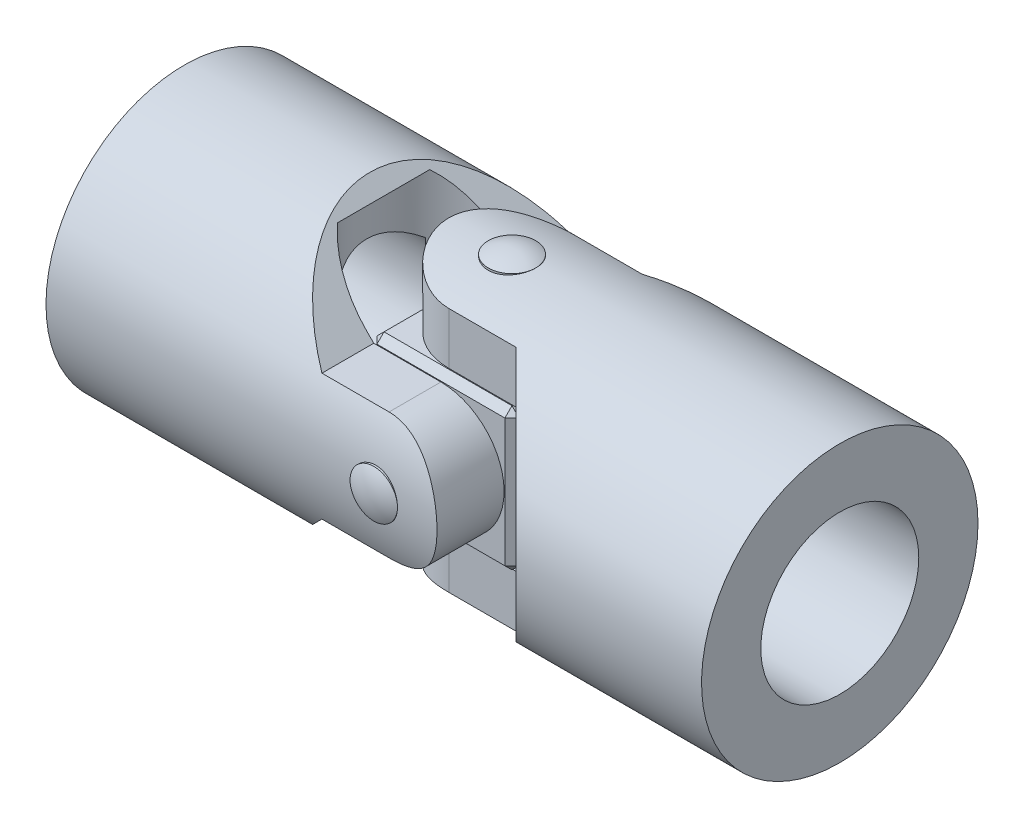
ISO-10303-21;
HEADER;
FILE_DESCRIPTION(('STEP AP214'),'2;1');
FILE_NAME('part.step','',(''),(''),'','','');
FILE_SCHEMA(('AUTOMOTIVE_DESIGN { 1 0 10303 214 1 1 1 1 }'));
ENDSEC;
DATA;
#1=APPLICATION_CONTEXT('core data for automotive mechanical design processes');
#2=APPLICATION_PROTOCOL_DEFINITION('international standard','automotive_design',2000,#1);
#3=PRODUCT_CONTEXT('',#1,'mechanical');
#4=PRODUCT('Part','Part','',(#3));
#5=PRODUCT_RELATED_PRODUCT_CATEGORY('part','',(#4));
#6=PRODUCT_DEFINITION_FORMATION('','',#4);
#7=PRODUCT_DEFINITION_CONTEXT('part definition',#1,'design');
#8=PRODUCT_DEFINITION('design','',#6,#7);
#9=PRODUCT_DEFINITION_SHAPE('','',#8);
#10=(LENGTH_UNIT() NAMED_UNIT(*) SI_UNIT(.MILLI.,.METRE.));
#11=(NAMED_UNIT(*) PLANE_ANGLE_UNIT() SI_UNIT($,.RADIAN.));
#12=(NAMED_UNIT(*) SI_UNIT($,.STERADIAN.) SOLID_ANGLE_UNIT());
#13=UNCERTAINTY_MEASURE_WITH_UNIT(LENGTH_MEASURE(1.E-05),#10,'distance_accuracy_value','');
#14=(GEOMETRIC_REPRESENTATION_CONTEXT(3) GLOBAL_UNCERTAINTY_ASSIGNED_CONTEXT((#13)) GLOBAL_UNIT_ASSIGNED_CONTEXT((#10,
#11,#12)) REPRESENTATION_CONTEXT('',''));
#15=CARTESIAN_POINT('',(0.,0.,0.));
#16=DIRECTION('',(0.,0.,1.));
#17=DIRECTION('',(1.,0.,0.));
#18=AXIS2_PLACEMENT_3D('',#15,#16,#17);
#19=CARTESIAN_POINT('',(0.,35.,0.));
#20=DIRECTION('',(0.,-1.,0.));
#21=DIRECTION('',(-1.,0.,0.));
#22=AXIS2_PLACEMENT_3D('',#19,#20,#21);
#23=CYLINDRICAL_SURFACE('',#22,6.);
#24=CARTESIAN_POINT('',(0.,35.,0.));
#25=DIRECTION('',(0.,1.,0.));
#26=DIRECTION('',(1.,0.,0.));
#27=AXIS2_PLACEMENT_3D('',#24,#25,#26);
#28=CIRCLE('',#27,6.);
#29=CARTESIAN_POINT('',(6.,35.,0.));
#30=VERTEX_POINT('',#29);
#31=EDGE_CURVE('P0_E10',#30,#30,#28,.T.);
#32=ORIENTED_EDGE('',*,*,#31,.F.);
#33=EDGE_LOOP('',(#32));
#34=FACE_BOUND('',#33,.T.);
#35=CARTESIAN_POINT('',(0.,-35.,0.));
#36=DIRECTION('',(0.,1.,0.));
#37=DIRECTION('',(0.,0.,1.));
#38=AXIS2_PLACEMENT_3D('',#35,#36,#37);
#39=CIRCLE('',#38,6.);
#40=CARTESIAN_POINT('',(0.,-35.,6.));
#41=VERTEX_POINT('',#40);
#42=EDGE_CURVE('P0_E20',#41,#41,#39,.T.);
#43=ORIENTED_EDGE('',*,*,#42,.T.);
#44=EDGE_LOOP('',(#43));
#45=FACE_BOUND('',#44,.T.);
#46=ADVANCED_FACE('P0_F14',(#34,#45),#23,.T.);
#47=CARTESIAN_POINT('',(0.,23.4674374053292,0.));
#48=DIRECTION('',(0.,1.,0.));
#49=DIRECTION('',(0.,0.,-1.));
#50=AXIS2_PLACEMENT_3D('',#47,#48,#49);
#51=SPHERICAL_SURFACE('',#50,13.);
#52=ORIENTED_EDGE('',*,*,#31,.T.);
#53=EDGE_LOOP('',(#52));
#54=FACE_BOUND('',#53,.T.);
#55=ADVANCED_FACE('P0_F29',(#54),#51,.T.);
#56=CARTESIAN_POINT('',(0.,-23.4674374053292,0.));
#57=DIRECTION('',(0.,-1.,0.));
#58=DIRECTION('',(0.,0.,-1.));
#59=AXIS2_PLACEMENT_3D('',#56,#57,#58);
#60=SPHERICAL_SURFACE('',#59,13.);
#61=ORIENTED_EDGE('',*,*,#42,.F.);
#62=EDGE_LOOP('',(#61));
#63=FACE_BOUND('',#62,.T.);
#64=ADVANCED_FACE('P0_F27',(#63),#60,.T.);
#65=CLOSED_SHELL('',(#46,#55,#64));
#66=MANIFOLD_SOLID_BREP('P0_B1',#65);
#67=CARTESIAN_POINT('',(0.,0.,35.));
#68=DIRECTION('',(0.,0.,-1.));
#69=DIRECTION('',(-1.,0.,0.));
#70=AXIS2_PLACEMENT_3D('',#67,#68,#69);
#71=CYLINDRICAL_SURFACE('',#70,6.);
#72=CARTESIAN_POINT('',(0.,0.,35.));
#73=DIRECTION('',(0.,0.,1.));
#74=DIRECTION('',(1.,0.,0.));
#75=AXIS2_PLACEMENT_3D('',#72,#73,#74);
#76=CIRCLE('',#75,6.);
#77=CARTESIAN_POINT('',(6.,0.,35.));
#78=VERTEX_POINT('',#77);
#79=EDGE_CURVE('P1_E10',#78,#78,#76,.T.);
#80=ORIENTED_EDGE('',*,*,#79,.F.);
#81=EDGE_LOOP('',(#80));
#82=FACE_BOUND('',#81,.T.);
#83=CARTESIAN_POINT('',(0.,0.,-35.));
#84=DIRECTION('',(0.,0.,1.));
#85=DIRECTION('',(0.,-1.,0.));
#86=AXIS2_PLACEMENT_3D('',#83,#84,#85);
#87=CIRCLE('',#86,6.);
#88=CARTESIAN_POINT('',(0.,-6.,-35.));
#89=VERTEX_POINT('',#88);
#90=EDGE_CURVE('P1_E20',#89,#89,#87,.T.);
#91=ORIENTED_EDGE('',*,*,#90,.T.);
#92=EDGE_LOOP('',(#91));
#93=FACE_BOUND('',#92,.T.);
#94=ADVANCED_FACE('P1_F14',(#82,#93),#71,.T.);
#95=CARTESIAN_POINT('',(0.,0.,23.4674374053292));
#96=DIRECTION('',(0.,0.,1.));
#97=DIRECTION('',(0.,1.,0.));
#98=AXIS2_PLACEMENT_3D('',#95,#96,#97);
#99=SPHERICAL_SURFACE('',#98,13.);
#100=ORIENTED_EDGE('',*,*,#79,.T.);
#101=EDGE_LOOP('',(#100));
#102=FACE_BOUND('',#101,.T.);
#103=ADVANCED_FACE('P1_F29',(#102),#99,.T.);
#104=CARTESIAN_POINT('',(0.,0.,-23.4674374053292));
#105=DIRECTION('',(0.,0.,-1.));
#106=DIRECTION('',(0.,1.,0.));
#107=AXIS2_PLACEMENT_3D('',#104,#105,#106);
#108=SPHERICAL_SURFACE('',#107,13.);
#109=ORIENTED_EDGE('',*,*,#90,.F.);
#110=EDGE_LOOP('',(#109));
#111=FACE_BOUND('',#110,.T.);
#112=ADVANCED_FACE('P1_F27',(#111),#108,.T.);
#113=CLOSED_SHELL('',(#94,#103,#112));
#114=MANIFOLD_SOLID_BREP('P1_B1',#113);
#115=CARTESIAN_POINT('',(0.,0.,18.));
#116=DIRECTION('',(0.,0.,-1.));
#117=DIRECTION('',(-1.,0.,0.));
#118=AXIS2_PLACEMENT_3D('',#115,#116,#117);
#119=CYLINDRICAL_SURFACE('',#118,6.);
#120=CARTESIAN_POINT('',(0.,0.,0.));
#121=DIRECTION('',(0.,0.707106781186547,-0.707106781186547));
#122=DIRECTION('',(0.,-0.707106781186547,-0.707106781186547));
#123=AXIS2_PLACEMENT_3D('',#120,#121,#122);
#124=ELLIPSE('',#123,8.48528137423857,6.);
#125=CARTESIAN_POINT('',(6.,0.,0.));
#126=VERTEX_POINT('',#125);
#127=CARTESIAN_POINT('',(-6.,0.,0.));
#128=VERTEX_POINT('',#127);
#129=EDGE_CURVE('P2_E116',#126,#128,#124,.F.);
#130=ORIENTED_EDGE('',*,*,#129,.F.);
#131=CARTESIAN_POINT('',(0.,0.,0.));
#132=DIRECTION('',(0.,-0.707106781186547,-0.707106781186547));
#133=DIRECTION('',(0.,0.707106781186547,-0.707106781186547));
#134=AXIS2_PLACEMENT_3D('',#131,#132,#133);
#135=ELLIPSE('',#134,8.48528137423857,6.);
#136=EDGE_CURVE('P2_E120',#128,#126,#135,.F.);
#137=ORIENTED_EDGE('',*,*,#136,.F.);
#138=EDGE_LOOP('',(#130,#137));
#139=FACE_BOUND('',#138,.T.);
#140=CARTESIAN_POINT('',(0.,0.,18.));
#141=DIRECTION('',(0.,0.,1.));
#142=DIRECTION('',(1.,0.,0.));
#143=AXIS2_PLACEMENT_3D('',#140,#141,#142);
#144=CIRCLE('',#143,6.);
#145=CARTESIAN_POINT('',(6.,0.,18.));
#146=VERTEX_POINT('',#145);
#147=EDGE_CURVE('P2_E127',#146,#146,#144,.T.);
#148=ORIENTED_EDGE('',*,*,#147,.T.);
#149=EDGE_LOOP('',(#148));
#150=FACE_BOUND('',#149,.T.);
#151=ADVANCED_FACE('P2_F16',(#139,#150),#119,.F.);
#152=CARTESIAN_POINT('',(18.,18.,18.));
#153=DIRECTION('',(0.,0.,1.));
#154=DIRECTION('',(1.,0.,0.));
#155=AXIS2_PLACEMENT_3D('',#152,#153,#154);
#156=PLANE('',#155);
#157=DIRECTION('',(0.,-1.,0.));
#158=VECTOR('',#157,1.);
#159=CARTESIAN_POINT('',(-16.2,-18.,18.));
#160=LINE('',#159,#158);
#161=CARTESIAN_POINT('',(-16.2,16.2,18.));
#162=VERTEX_POINT('',#161);
#163=CARTESIAN_POINT('',(-16.2,-16.2,18.));
#164=VERTEX_POINT('',#163);
#165=EDGE_CURVE('P2_E164',#162,#164,#160,.T.);
#166=ORIENTED_EDGE('',*,*,#165,.T.);
#167=DIRECTION('',(1.,0.,0.));
#168=VECTOR('',#167,1.);
#169=CARTESIAN_POINT('',(18.,-16.2,18.));
#170=LINE('',#169,#168);
#171=CARTESIAN_POINT('',(16.2,-16.2,18.));
#172=VERTEX_POINT('',#171);
#173=EDGE_CURVE('P2_E168',#164,#172,#170,.T.);
#174=ORIENTED_EDGE('',*,*,#173,.T.);
#175=DIRECTION('',(0.,1.,0.));
#176=VECTOR('',#175,1.);
#177=CARTESIAN_POINT('',(16.2,18.,18.));
#178=LINE('',#177,#176);
#179=CARTESIAN_POINT('',(16.2,16.2,18.));
#180=VERTEX_POINT('',#179);
#181=EDGE_CURVE('P2_E166',#172,#180,#178,.T.);
#182=ORIENTED_EDGE('',*,*,#181,.T.);
#183=DIRECTION('',(-1.,0.,0.));
#184=VECTOR('',#183,1.);
#185=CARTESIAN_POINT('',(-18.,16.2,18.));
#186=LINE('',#185,#184);
#187=EDGE_CURVE('P2_E162',#180,#162,#186,.T.);
#188=ORIENTED_EDGE('',*,*,#187,.T.);
#189=EDGE_LOOP('',(#166,#174,#182,#188));
#190=FACE_BOUND('',#189,.T.);
#191=ORIENTED_EDGE('',*,*,#147,.F.);
#192=EDGE_LOOP('',(#191));
#193=FACE_BOUND('',#192,.T.);
#194=ADVANCED_FACE('P2_F282',(#190,#193),#156,.T.);
#195=CARTESIAN_POINT('',(18.,18.,-18.));
#196=DIRECTION('',(0.,0.,1.));
#197=DIRECTION('',(1.,0.,0.));
#198=AXIS2_PLACEMENT_3D('',#195,#196,#197);
#199=PLANE('',#198);
#200=DIRECTION('',(-1.,0.,0.));
#201=VECTOR('',#200,1.);
#202=CARTESIAN_POINT('',(18.,-16.2,-18.));
#203=LINE('',#202,#201);
#204=CARTESIAN_POINT('',(16.2,-16.2,-18.));
#205=VERTEX_POINT('',#204);
#206=CARTESIAN_POINT('',(-16.2,-16.2,-18.));
#207=VERTEX_POINT('',#206);
#208=EDGE_CURVE('P2_E157',#205,#207,#203,.T.);
#209=ORIENTED_EDGE('',*,*,#208,.T.);
#210=DIRECTION('',(0.,1.,0.));
#211=VECTOR('',#210,1.);
#212=CARTESIAN_POINT('',(-16.2,18.,-18.));
#213=LINE('',#212,#211);
#214=CARTESIAN_POINT('',(-16.2,16.2,-18.));
#215=VERTEX_POINT('',#214);
#216=EDGE_CURVE('P2_E159',#207,#215,#213,.T.);
#217=ORIENTED_EDGE('',*,*,#216,.T.);
#218=DIRECTION('',(1.,0.,0.));
#219=VECTOR('',#218,1.);
#220=CARTESIAN_POINT('',(18.,16.2,-18.));
#221=LINE('',#220,#219);
#222=CARTESIAN_POINT('',(16.2,16.2,-18.));
#223=VERTEX_POINT('',#222);
#224=EDGE_CURVE('P2_E153',#215,#223,#221,.T.);
#225=ORIENTED_EDGE('',*,*,#224,.T.);
#226=DIRECTION('',(0.,-1.,0.));
#227=VECTOR('',#226,1.);
#228=CARTESIAN_POINT('',(16.2,18.,-18.));
#229=LINE('',#228,#227);
#230=EDGE_CURVE('P2_E155',#223,#205,#229,.T.);
#231=ORIENTED_EDGE('',*,*,#230,.T.);
#232=EDGE_LOOP('',(#209,#217,#225,#231));
#233=FACE_BOUND('',#232,.T.);
#234=CARTESIAN_POINT('',(0.,0.,-18.));
#235=DIRECTION('',(0.,0.,1.));
#236=DIRECTION('',(1.,0.,0.));
#237=AXIS2_PLACEMENT_3D('',#234,#235,#236);
#238=CIRCLE('',#237,6.);
#239=CARTESIAN_POINT('',(6.,0.,-18.));
#240=VERTEX_POINT('',#239);
#241=EDGE_CURVE('P2_E259',#240,#240,#238,.T.);
#242=ORIENTED_EDGE('',*,*,#241,.T.);
#243=EDGE_LOOP('',(#242));
#244=FACE_BOUND('',#243,.T.);
#245=ADVANCED_FACE('P2_F267',(#233,#244),#199,.F.);
#246=CARTESIAN_POINT('',(-18.,18.,18.));
#247=DIRECTION('',(0.,-1.,0.));
#248=DIRECTION('',(0.,0.,-1.));
#249=AXIS2_PLACEMENT_3D('',#246,#247,#248);
#250=PLANE('',#249);
#251=DIRECTION('',(-1.,0.,0.));
#252=VECTOR('',#251,1.);
#253=CARTESIAN_POINT('',(-18.,18.,-16.2));
#254=LINE('',#253,#252);
#255=CARTESIAN_POINT('',(16.2,18.,-16.2));
#256=VERTEX_POINT('',#255);
#257=CARTESIAN_POINT('',(-16.2,18.,-16.2));
#258=VERTEX_POINT('',#257);
#259=EDGE_CURVE('P2_E25',#256,#258,#254,.T.);
#260=ORIENTED_EDGE('',*,*,#259,.T.);
#261=DIRECTION('',(0.,0.,1.));
#262=VECTOR('',#261,1.);
#263=CARTESIAN_POINT('',(-16.2,18.,18.));
#264=LINE('',#263,#262);
#265=CARTESIAN_POINT('',(-16.2,18.,16.2));
#266=VERTEX_POINT('',#265);
#267=EDGE_CURVE('P2_E11',#258,#266,#264,.T.);
#268=ORIENTED_EDGE('',*,*,#267,.T.);
#269=DIRECTION('',(1.,0.,0.));
#270=VECTOR('',#269,1.);
#271=CARTESIAN_POINT('',(18.,18.,16.2));
#272=LINE('',#271,#270);
#273=CARTESIAN_POINT('',(16.2,18.,16.2));
#274=VERTEX_POINT('',#273);
#275=EDGE_CURVE('P2_E180',#266,#274,#272,.T.);
#276=ORIENTED_EDGE('',*,*,#275,.T.);
#277=DIRECTION('',(0.,0.,-1.));
#278=VECTOR('',#277,1.);
#279=CARTESIAN_POINT('',(16.2,18.,18.));
#280=LINE('',#279,#278);
#281=EDGE_CURVE('P2_E36',#274,#256,#280,.T.);
#282=ORIENTED_EDGE('',*,*,#281,.T.);
#283=EDGE_LOOP('',(#260,#268,#276,#282));
#284=FACE_BOUND('',#283,.T.);
#285=CARTESIAN_POINT('',(0.,18.,0.));
#286=DIRECTION('',(0.,1.,0.));
#287=DIRECTION('',(0.,0.,1.));
#288=AXIS2_PLACEMENT_3D('',#285,#286,#287);
#289=CIRCLE('',#288,6.);
#290=CARTESIAN_POINT('',(0.,18.,6.));
#291=VERTEX_POINT('',#290);
#292=EDGE_CURVE('P2_E249',#291,#291,#289,.T.);
#293=ORIENTED_EDGE('',*,*,#292,.F.);
#294=EDGE_LOOP('',(#293));
#295=FACE_BOUND('',#294,.T.);
#296=ADVANCED_FACE('P2_F290',(#284,#295),#250,.F.);
#297=CARTESIAN_POINT('',(-18.,-18.,18.));
#298=DIRECTION('',(1.,0.,0.));
#299=DIRECTION('',(0.,0.,-1.));
#300=AXIS2_PLACEMENT_3D('',#297,#298,#299);
#301=PLANE('',#300);
#302=DIRECTION('',(0.,-1.,0.));
#303=VECTOR('',#302,1.);
#304=CARTESIAN_POINT('',(-18.,-18.,-16.2));
#305=LINE('',#304,#303);
#306=CARTESIAN_POINT('',(-18.,16.2,-16.2));
#307=VERTEX_POINT('',#306);
#308=CARTESIAN_POINT('',(-18.,-16.2,-16.2));
#309=VERTEX_POINT('',#308);
#310=EDGE_CURVE('P2_E148',#307,#309,#305,.T.);
#311=ORIENTED_EDGE('',*,*,#310,.T.);
#312=DIRECTION('',(0.,0.,1.));
#313=VECTOR('',#312,1.);
#314=CARTESIAN_POINT('',(-18.,-16.2,18.));
#315=LINE('',#314,#313);
#316=CARTESIAN_POINT('',(-18.,-16.2,16.2));
#317=VERTEX_POINT('',#316);
#318=EDGE_CURVE('P2_E150',#309,#317,#315,.T.);
#319=ORIENTED_EDGE('',*,*,#318,.T.);
#320=DIRECTION('',(0.,1.,0.));
#321=VECTOR('',#320,1.);
#322=CARTESIAN_POINT('',(-18.,18.,16.2));
#323=LINE('',#322,#321);
#324=CARTESIAN_POINT('',(-18.,16.2,16.2));
#325=VERTEX_POINT('',#324);
#326=EDGE_CURVE('P2_E146',#317,#325,#323,.T.);
#327=ORIENTED_EDGE('',*,*,#326,.T.);
#328=DIRECTION('',(0.,0.,-1.));
#329=VECTOR('',#328,1.);
#330=CARTESIAN_POINT('',(-18.,16.2,18.));
#331=LINE('',#330,#329);
#332=EDGE_CURVE('P2_E144',#325,#307,#331,.T.);
#333=ORIENTED_EDGE('',*,*,#332,.T.);
#334=EDGE_LOOP('',(#311,#319,#327,#333));
#335=FACE_BOUND('',#334,.T.);
#336=ADVANCED_FACE('P2_F297',(#335),#301,.F.);
#337=CARTESIAN_POINT('',(-18.,-18.,18.));
#338=DIRECTION('',(0.,1.,0.));
#339=DIRECTION('',(0.,0.,1.));
#340=AXIS2_PLACEMENT_3D('',#337,#338,#339);
#341=PLANE('',#340);
#342=DIRECTION('',(-1.,0.,0.));
#343=VECTOR('',#342,1.);
#344=CARTESIAN_POINT('',(-18.,-18.,16.2));
#345=LINE('',#344,#343);
#346=CARTESIAN_POINT('',(16.2,-18.,16.2));
#347=VERTEX_POINT('',#346);
#348=CARTESIAN_POINT('',(-16.2,-18.,16.2));
#349=VERTEX_POINT('',#348);
#350=EDGE_CURVE('P2_E137',#347,#349,#345,.T.);
#351=ORIENTED_EDGE('',*,*,#350,.T.);
#352=DIRECTION('',(0.,0.,-1.));
#353=VECTOR('',#352,1.);
#354=CARTESIAN_POINT('',(-16.2,-18.,18.));
#355=LINE('',#354,#353);
#356=CARTESIAN_POINT('',(-16.2,-18.,-16.2));
#357=VERTEX_POINT('',#356);
#358=EDGE_CURVE('P2_E141',#349,#357,#355,.T.);
#359=ORIENTED_EDGE('',*,*,#358,.T.);
#360=DIRECTION('',(1.,0.,0.));
#361=VECTOR('',#360,1.);
#362=CARTESIAN_POINT('',(-18.,-18.,-16.2));
#363=LINE('',#362,#361);
#364=CARTESIAN_POINT('',(16.2,-18.,-16.2));
#365=VERTEX_POINT('',#364);
#366=EDGE_CURVE('P2_E139',#357,#365,#363,.T.);
#367=ORIENTED_EDGE('',*,*,#366,.T.);
#368=DIRECTION('',(0.,0.,1.));
#369=VECTOR('',#368,1.);
#370=CARTESIAN_POINT('',(16.2,-18.,18.));
#371=LINE('',#370,#369);
#372=EDGE_CURVE('P2_E130',#365,#347,#371,.T.);
#373=ORIENTED_EDGE('',*,*,#372,.T.);
#374=EDGE_LOOP('',(#351,#359,#367,#373));
#375=FACE_BOUND('',#374,.T.);
#376=CARTESIAN_POINT('',(0.,-18.,0.));
#377=DIRECTION('',(0.,1.,0.));
#378=DIRECTION('',(0.,0.,1.));
#379=AXIS2_PLACEMENT_3D('',#376,#377,#378);
#380=CIRCLE('',#379,6.);
#381=CARTESIAN_POINT('',(0.,-18.,6.));
#382=VERTEX_POINT('',#381);
#383=EDGE_CURVE('P2_E255',#382,#382,#380,.T.);
#384=ORIENTED_EDGE('',*,*,#383,.T.);
#385=EDGE_LOOP('',(#384));
#386=FACE_BOUND('',#385,.T.);
#387=ADVANCED_FACE('P2_F277',(#375,#386),#341,.F.);
#388=CARTESIAN_POINT('',(18.,-18.,18.));
#389=DIRECTION('',(-1.,0.,0.));
#390=DIRECTION('',(0.,0.,1.));
#391=AXIS2_PLACEMENT_3D('',#388,#389,#390);
#392=PLANE('',#391);
#393=DIRECTION('',(0.,-1.,0.));
#394=VECTOR('',#393,1.);
#395=CARTESIAN_POINT('',(18.,-18.,16.2));
#396=LINE('',#395,#394);
#397=CARTESIAN_POINT('',(18.,16.2,16.2));
#398=VERTEX_POINT('',#397);
#399=CARTESIAN_POINT('',(18.,-16.2,16.2));
#400=VERTEX_POINT('',#399);
#401=EDGE_CURVE('P2_E173',#398,#400,#396,.T.);
#402=ORIENTED_EDGE('',*,*,#401,.T.);
#403=DIRECTION('',(0.,0.,-1.));
#404=VECTOR('',#403,1.);
#405=CARTESIAN_POINT('',(18.,-16.2,18.));
#406=LINE('',#405,#404);
#407=CARTESIAN_POINT('',(18.,-16.2,-16.2));
#408=VERTEX_POINT('',#407);
#409=EDGE_CURVE('P2_E177',#400,#408,#406,.T.);
#410=ORIENTED_EDGE('',*,*,#409,.T.);
#411=DIRECTION('',(0.,1.,0.));
#412=VECTOR('',#411,1.);
#413=CARTESIAN_POINT('',(18.,-18.,-16.2));
#414=LINE('',#413,#412);
#415=CARTESIAN_POINT('',(18.,16.2,-16.2));
#416=VERTEX_POINT('',#415);
#417=EDGE_CURVE('P2_E175',#408,#416,#414,.T.);
#418=ORIENTED_EDGE('',*,*,#417,.T.);
#419=DIRECTION('',(0.,0.,1.));
#420=VECTOR('',#419,1.);
#421=CARTESIAN_POINT('',(18.,16.2,18.));
#422=LINE('',#421,#420);
#423=EDGE_CURVE('P2_E171',#416,#398,#422,.T.);
#424=ORIENTED_EDGE('',*,*,#423,.T.);
#425=EDGE_LOOP('',(#402,#410,#418,#424));
#426=FACE_BOUND('',#425,.T.);
#427=ADVANCED_FACE('P2_F269',(#426),#392,.F.);
#428=CARTESIAN_POINT('',(0.,0.,0.));
#429=DIRECTION('',(0.,0.707106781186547,-0.707106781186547));
#430=DIRECTION('',(0.,-0.707106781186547,-0.707106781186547));
#431=AXIS2_PLACEMENT_3D('',#428,#429,#430);
#432=ELLIPSE('',#431,8.48528137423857,6.);
#433=EDGE_CURVE('P2_E119',#126,#128,#432,.T.);
#434=ORIENTED_EDGE('',*,*,#433,.F.);
#435=CARTESIAN_POINT('',(0.,0.,0.));
#436=DIRECTION('',(0.,-0.707106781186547,-0.707106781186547));
#437=DIRECTION('',(0.,0.707106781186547,-0.707106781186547));
#438=AXIS2_PLACEMENT_3D('',#435,#436,#437);
#439=ELLIPSE('',#438,8.48528137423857,6.);
#440=EDGE_CURVE('P2_E111',#128,#126,#439,.T.);
#441=ORIENTED_EDGE('',*,*,#440,.F.);
#442=EDGE_LOOP('',(#434,#441));
#443=FACE_BOUND('',#442,.T.);
#444=ORIENTED_EDGE('',*,*,#241,.F.);
#445=EDGE_LOOP('',(#444));
#446=FACE_BOUND('',#445,.T.);
#447=ADVANCED_FACE('P2_F132',(#443,#446),#119,.F.);
#448=CARTESIAN_POINT('',(0.,-18.,0.));
#449=DIRECTION('',(0.,1.,0.));
#450=DIRECTION('',(0.,0.,1.));
#451=AXIS2_PLACEMENT_3D('',#448,#449,#450);
#452=CYLINDRICAL_SURFACE('',#451,6.);
#453=ORIENTED_EDGE('',*,*,#433,.T.);
#454=ORIENTED_EDGE('',*,*,#136,.T.);
#455=EDGE_LOOP('',(#453,#454));
#456=FACE_BOUND('',#455,.T.);
#457=ORIENTED_EDGE('',*,*,#383,.F.);
#458=EDGE_LOOP('',(#457));
#459=FACE_BOUND('',#458,.T.);
#460=ADVANCED_FACE('P2_F124',(#456,#459),#452,.F.);
#461=ORIENTED_EDGE('',*,*,#129,.T.);
#462=ORIENTED_EDGE('',*,*,#440,.T.);
#463=EDGE_LOOP('',(#461,#462));
#464=FACE_BOUND('',#463,.T.);
#465=ORIENTED_EDGE('',*,*,#292,.T.);
#466=EDGE_LOOP('',(#465));
#467=FACE_BOUND('',#466,.T.);
#468=ADVANCED_FACE('P2_F113',(#464,#467),#452,.F.);
#469=CARTESIAN_POINT('',(16.2,18.,18.));
#470=DIRECTION('',(-0.707106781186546,-0.707106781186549,0.));
#471=DIRECTION('',(0.707106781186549,-0.707106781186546,0.));
#472=AXIS2_PLACEMENT_3D('',#469,#470,#471);
#473=PLANE('',#472);
#474=DIRECTION('',(0.707106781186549,-0.707106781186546,0.));
#475=VECTOR('',#474,1.);
#476=CARTESIAN_POINT('',(17.1,17.1,16.2));
#477=LINE('',#476,#475);
#478=EDGE_CURVE('P2_E20',#398,#274,#477,.F.);
#479=ORIENTED_EDGE('',*,*,#478,.F.);
#480=ORIENTED_EDGE('',*,*,#423,.F.);
#481=DIRECTION('',(-0.707106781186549,0.707106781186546,0.));
#482=VECTOR('',#481,1.);
#483=CARTESIAN_POINT('',(18.,16.2,-16.2));
#484=LINE('',#483,#482);
#485=EDGE_CURVE('P2_E243',#256,#416,#484,.F.);
#486=ORIENTED_EDGE('',*,*,#485,.F.);
#487=ORIENTED_EDGE('',*,*,#281,.F.);
#488=EDGE_LOOP('',(#479,#480,#486,#487));
#489=FACE_BOUND('',#488,.T.);
#490=ADVANCED_FACE('P2_F18',(#489),#473,.F.);
#491=CARTESIAN_POINT('',(16.2,16.2,18.));
#492=DIRECTION('',(0.577350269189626,0.577350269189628,0.577350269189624));
#493=DIRECTION('',(-0.707106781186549,0.707106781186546,0.));
#494=AXIS2_PLACEMENT_3D('',#491,#492,#493);
#495=PLANE('',#494);
#496=DIRECTION('',(0.707106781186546,0.,-0.707106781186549));
#497=VECTOR('',#496,1.);
#498=CARTESIAN_POINT('',(16.2,16.2,18.));
#499=LINE('',#498,#497);
#500=EDGE_CURVE('P2_E238',#398,#180,#499,.F.);
#501=ORIENTED_EDGE('',*,*,#500,.F.);
#502=ORIENTED_EDGE('',*,*,#478,.T.);
#503=DIRECTION('',(0.,-0.707106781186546,0.707106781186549));
#504=VECTOR('',#503,1.);
#505=CARTESIAN_POINT('',(16.2,16.2,18.));
#506=LINE('',#505,#504);
#507=EDGE_CURVE('P2_E241',#180,#274,#506,.F.);
#508=ORIENTED_EDGE('',*,*,#507,.F.);
#509=EDGE_LOOP('',(#501,#502,#508));
#510=FACE_BOUND('',#509,.T.);
#511=ADVANCED_FACE('P2_F374',(#510),#495,.T.);
#512=CARTESIAN_POINT('',(18.,16.2,-16.2));
#513=DIRECTION('',(0.577350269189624,0.577350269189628,-0.577350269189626));
#514=DIRECTION('',(0.,0.707106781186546,0.707106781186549));
#515=AXIS2_PLACEMENT_3D('',#512,#513,#514);
#516=PLANE('',#515);
#517=DIRECTION('',(0.,-0.707106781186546,-0.707106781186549));
#518=VECTOR('',#517,1.);
#519=CARTESIAN_POINT('',(16.2,17.1,-17.1));
#520=LINE('',#519,#518);
#521=EDGE_CURVE('P2_E232',#256,#223,#520,.T.);
#522=ORIENTED_EDGE('',*,*,#521,.F.);
#523=ORIENTED_EDGE('',*,*,#485,.T.);
#524=DIRECTION('',(0.707106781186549,0.,0.707106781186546));
#525=VECTOR('',#524,1.);
#526=CARTESIAN_POINT('',(18.,16.2,-16.2));
#527=LINE('',#526,#525);
#528=EDGE_CURVE('P2_E235',#223,#416,#527,.T.);
#529=ORIENTED_EDGE('',*,*,#528,.F.);
#530=EDGE_LOOP('',(#522,#523,#529));
#531=FACE_BOUND('',#530,.T.);
#532=ADVANCED_FACE('P2_F371',(#531),#516,.T.);
#533=CARTESIAN_POINT('',(18.,16.2,18.));
#534=DIRECTION('',(0.,0.707106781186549,0.707106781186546));
#535=DIRECTION('',(0.,-0.707106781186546,0.707106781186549));
#536=AXIS2_PLACEMENT_3D('',#533,#534,#535);
#537=PLANE('',#536);
#538=ORIENTED_EDGE('',*,*,#507,.T.);
#539=ORIENTED_EDGE('',*,*,#275,.F.);
#540=DIRECTION('',(0.,0.707106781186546,-0.707106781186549));
#541=VECTOR('',#540,1.);
#542=CARTESIAN_POINT('',(-16.2,17.1,17.1));
#543=LINE('',#542,#541);
#544=EDGE_CURVE('P2_E227',#162,#266,#543,.T.);
#545=ORIENTED_EDGE('',*,*,#544,.F.);
#546=ORIENTED_EDGE('',*,*,#187,.F.);
#547=EDGE_LOOP('',(#538,#539,#545,#546));
#548=FACE_BOUND('',#547,.T.);
#549=ADVANCED_FACE('P2_F367',(#548),#537,.T.);
#550=CARTESIAN_POINT('',(16.2,18.,18.));
#551=DIRECTION('',(0.707106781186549,0.,0.707106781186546));
#552=DIRECTION('',(0.707106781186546,0.,-0.707106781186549));
#553=AXIS2_PLACEMENT_3D('',#550,#551,#552);
#554=PLANE('',#553);
#555=ORIENTED_EDGE('',*,*,#500,.T.);
#556=ORIENTED_EDGE('',*,*,#181,.F.);
#557=DIRECTION('',(-0.707106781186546,0.,0.707106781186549));
#558=VECTOR('',#557,1.);
#559=CARTESIAN_POINT('',(16.2,-16.2,18.));
#560=LINE('',#559,#558);
#561=EDGE_CURVE('P2_E224',#400,#172,#560,.T.);
#562=ORIENTED_EDGE('',*,*,#561,.F.);
#563=ORIENTED_EDGE('',*,*,#401,.F.);
#564=EDGE_LOOP('',(#555,#556,#562,#563));
#565=FACE_BOUND('',#564,.T.);
#566=ADVANCED_FACE('P2_F363',(#565),#554,.T.);
#567=CARTESIAN_POINT('',(18.,-16.2,18.));
#568=DIRECTION('',(-0.707106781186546,0.707106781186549,0.));
#569=DIRECTION('',(-0.707106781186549,-0.707106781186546,0.));
#570=AXIS2_PLACEMENT_3D('',#567,#568,#569);
#571=PLANE('',#570);
#572=DIRECTION('',(0.707106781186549,0.707106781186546,0.));
#573=VECTOR('',#572,1.);
#574=CARTESIAN_POINT('',(16.2,-18.,-16.2));
#575=LINE('',#574,#573);
#576=EDGE_CURVE('P2_E218',#408,#365,#575,.F.);
#577=ORIENTED_EDGE('',*,*,#576,.F.);
#578=ORIENTED_EDGE('',*,*,#409,.F.);
#579=DIRECTION('',(-0.707106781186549,-0.707106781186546,0.));
#580=VECTOR('',#579,1.);
#581=CARTESIAN_POINT('',(17.1,-17.1,16.2));
#582=LINE('',#581,#580);
#583=EDGE_CURVE('P2_E221',#347,#400,#582,.F.);
#584=ORIENTED_EDGE('',*,*,#583,.F.);
#585=ORIENTED_EDGE('',*,*,#372,.F.);
#586=EDGE_LOOP('',(#577,#578,#584,#585));
#587=FACE_BOUND('',#586,.T.);
#588=ADVANCED_FACE('P2_F359',(#587),#571,.F.);
#589=CARTESIAN_POINT('',(18.,-18.,-16.2));
#590=DIRECTION('',(-0.707106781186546,0.,0.707106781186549));
#591=DIRECTION('',(0.707106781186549,0.,0.707106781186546));
#592=AXIS2_PLACEMENT_3D('',#589,#590,#591);
#593=PLANE('',#592);
#594=ORIENTED_EDGE('',*,*,#528,.T.);
#595=ORIENTED_EDGE('',*,*,#417,.F.);
#596=DIRECTION('',(-0.707106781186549,0.,-0.707106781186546));
#597=VECTOR('',#596,1.);
#598=CARTESIAN_POINT('',(17.1,-16.2,-17.1));
#599=LINE('',#598,#597);
#600=EDGE_CURVE('P2_E216',#205,#408,#599,.F.);
#601=ORIENTED_EDGE('',*,*,#600,.F.);
#602=ORIENTED_EDGE('',*,*,#230,.F.);
#603=EDGE_LOOP('',(#594,#595,#601,#602));
#604=FACE_BOUND('',#603,.T.);
#605=ADVANCED_FACE('P2_F355',(#604),#593,.F.);
#606=CARTESIAN_POINT('',(-18.,18.,-16.2));
#607=DIRECTION('',(0.,-0.707106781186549,0.707106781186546));
#608=DIRECTION('',(0.,-0.707106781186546,-0.707106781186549));
#609=AXIS2_PLACEMENT_3D('',#606,#607,#608);
#610=PLANE('',#609);
#611=ORIENTED_EDGE('',*,*,#521,.T.);
#612=ORIENTED_EDGE('',*,*,#224,.F.);
#613=DIRECTION('',(0.,0.707106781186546,0.707106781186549));
#614=VECTOR('',#613,1.);
#615=CARTESIAN_POINT('',(-16.2,16.2,-18.));
#616=LINE('',#615,#614);
#617=EDGE_CURVE('P2_E213',#258,#215,#616,.F.);
#618=ORIENTED_EDGE('',*,*,#617,.F.);
#619=ORIENTED_EDGE('',*,*,#259,.F.);
#620=EDGE_LOOP('',(#611,#612,#618,#619));
#621=FACE_BOUND('',#620,.T.);
#622=ADVANCED_FACE('P2_F351',(#621),#610,.F.);
#623=CARTESIAN_POINT('',(-18.,16.2,18.));
#624=DIRECTION('',(0.707106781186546,-0.707106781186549,0.));
#625=DIRECTION('',(0.707106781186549,0.707106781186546,0.));
#626=AXIS2_PLACEMENT_3D('',#623,#624,#625);
#627=PLANE('',#626);
#628=DIRECTION('',(0.707106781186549,0.707106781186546,0.));
#629=VECTOR('',#628,1.);
#630=CARTESIAN_POINT('',(-18.,16.2,16.2));
#631=LINE('',#630,#629);
#632=EDGE_CURVE('P2_E229',#266,#325,#631,.F.);
#633=ORIENTED_EDGE('',*,*,#632,.F.);
#634=ORIENTED_EDGE('',*,*,#267,.F.);
#635=DIRECTION('',(-0.707106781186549,-0.707106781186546,0.));
#636=VECTOR('',#635,1.);
#637=CARTESIAN_POINT('',(-17.1,17.1,-16.2));
#638=LINE('',#637,#636);
#639=EDGE_CURVE('P2_E210',#307,#258,#638,.F.);
#640=ORIENTED_EDGE('',*,*,#639,.F.);
#641=ORIENTED_EDGE('',*,*,#332,.F.);
#642=EDGE_LOOP('',(#633,#634,#640,#641));
#643=FACE_BOUND('',#642,.T.);
#644=ADVANCED_FACE('P2_F347',(#643),#627,.F.);
#645=CARTESIAN_POINT('',(-18.,16.2,16.2));
#646=DIRECTION('',(-0.577350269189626,0.577350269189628,0.577350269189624));
#647=DIRECTION('',(-0.707106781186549,-0.707106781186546,0.));
#648=AXIS2_PLACEMENT_3D('',#645,#646,#647);
#649=PLANE('',#648);
#650=ORIENTED_EDGE('',*,*,#544,.T.);
#651=ORIENTED_EDGE('',*,*,#632,.T.);
#652=DIRECTION('',(0.707106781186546,0.,0.707106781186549));
#653=VECTOR('',#652,1.);
#654=CARTESIAN_POINT('',(-18.,16.2,16.2));
#655=LINE('',#654,#653);
#656=EDGE_CURVE('P2_E207',#162,#325,#655,.F.);
#657=ORIENTED_EDGE('',*,*,#656,.F.);
#658=EDGE_LOOP('',(#650,#651,#657));
#659=FACE_BOUND('',#658,.T.);
#660=ADVANCED_FACE('P2_F343',(#659),#649,.T.);
#661=CARTESIAN_POINT('',(16.2,-16.2,18.));
#662=DIRECTION('',(0.577350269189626,-0.577350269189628,0.577350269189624));
#663=DIRECTION('',(0.707106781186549,0.707106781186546,0.));
#664=AXIS2_PLACEMENT_3D('',#661,#662,#663);
#665=PLANE('',#664);
#666=ORIENTED_EDGE('',*,*,#583,.T.);
#667=ORIENTED_EDGE('',*,*,#561,.T.);
#668=DIRECTION('',(0.,-0.707106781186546,-0.707106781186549));
#669=VECTOR('',#668,1.);
#670=CARTESIAN_POINT('',(16.2,-16.2,18.));
#671=LINE('',#670,#669);
#672=EDGE_CURVE('P2_E205',#347,#172,#671,.F.);
#673=ORIENTED_EDGE('',*,*,#672,.F.);
#674=EDGE_LOOP('',(#666,#667,#673));
#675=FACE_BOUND('',#674,.T.);
#676=ADVANCED_FACE('P2_F339',(#675),#665,.T.);
#677=CARTESIAN_POINT('',(16.2,-18.,-16.2));
#678=DIRECTION('',(0.577350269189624,-0.577350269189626,-0.577350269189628));
#679=DIRECTION('',(0.,0.707106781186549,-0.707106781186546));
#680=AXIS2_PLACEMENT_3D('',#677,#678,#679);
#681=PLANE('',#680);
#682=ORIENTED_EDGE('',*,*,#600,.T.);
#683=ORIENTED_EDGE('',*,*,#576,.T.);
#684=DIRECTION('',(0.,-0.707106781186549,0.707106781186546));
#685=VECTOR('',#684,1.);
#686=CARTESIAN_POINT('',(16.2,-18.,-16.2));
#687=LINE('',#686,#685);
#688=EDGE_CURVE('P2_E202',#205,#365,#687,.T.);
#689=ORIENTED_EDGE('',*,*,#688,.F.);
#690=EDGE_LOOP('',(#682,#683,#689));
#691=FACE_BOUND('',#690,.T.);
#692=ADVANCED_FACE('P2_F335',(#691),#681,.T.);
#693=CARTESIAN_POINT('',(-16.2,16.2,-18.));
#694=DIRECTION('',(-0.577350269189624,0.577350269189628,-0.577350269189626));
#695=DIRECTION('',(0.,0.707106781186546,0.707106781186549));
#696=AXIS2_PLACEMENT_3D('',#693,#694,#695);
#697=PLANE('',#696);
#698=ORIENTED_EDGE('',*,*,#639,.T.);
#699=ORIENTED_EDGE('',*,*,#617,.T.);
#700=DIRECTION('',(0.707106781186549,0.,-0.707106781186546));
#701=VECTOR('',#700,1.);
#702=CARTESIAN_POINT('',(-16.2,16.2,-18.));
#703=LINE('',#702,#701);
#704=EDGE_CURVE('P2_E200',#307,#215,#703,.T.);
#705=ORIENTED_EDGE('',*,*,#704,.F.);
#706=EDGE_LOOP('',(#698,#699,#705));
#707=FACE_BOUND('',#706,.T.);
#708=ADVANCED_FACE('P2_F331',(#707),#697,.T.);
#709=CARTESIAN_POINT('',(-16.2,18.,18.));
#710=DIRECTION('',(-0.707106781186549,0.,0.707106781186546));
#711=DIRECTION('',(0.707106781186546,0.,0.707106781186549));
#712=AXIS2_PLACEMENT_3D('',#709,#710,#711);
#713=PLANE('',#712);
#714=ORIENTED_EDGE('',*,*,#656,.T.);
#715=ORIENTED_EDGE('',*,*,#326,.F.);
#716=DIRECTION('',(-0.707106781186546,0.,-0.707106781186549));
#717=VECTOR('',#716,1.);
#718=CARTESIAN_POINT('',(-18.,-16.2,16.2));
#719=LINE('',#718,#717);
#720=EDGE_CURVE('P2_E197',#164,#317,#719,.T.);
#721=ORIENTED_EDGE('',*,*,#720,.F.);
#722=ORIENTED_EDGE('',*,*,#165,.F.);
#723=EDGE_LOOP('',(#714,#715,#721,#722));
#724=FACE_BOUND('',#723,.T.);
#725=ADVANCED_FACE('P2_F327',(#724),#713,.T.);
#726=CARTESIAN_POINT('',(18.,-16.2,18.));
#727=DIRECTION('',(0.,-0.707106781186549,0.707106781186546));
#728=DIRECTION('',(0.,-0.707106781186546,-0.707106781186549));
#729=AXIS2_PLACEMENT_3D('',#726,#727,#728);
#730=PLANE('',#729);
#731=ORIENTED_EDGE('',*,*,#672,.T.);
#732=ORIENTED_EDGE('',*,*,#173,.F.);
#733=DIRECTION('',(0.,0.707106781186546,0.707106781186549));
#734=VECTOR('',#733,1.);
#735=CARTESIAN_POINT('',(-16.2,-17.1,17.1));
#736=LINE('',#735,#734);
#737=EDGE_CURVE('P2_E194',#349,#164,#736,.T.);
#738=ORIENTED_EDGE('',*,*,#737,.F.);
#739=ORIENTED_EDGE('',*,*,#350,.F.);
#740=EDGE_LOOP('',(#731,#732,#738,#739));
#741=FACE_BOUND('',#740,.T.);
#742=ADVANCED_FACE('P2_F323',(#741),#730,.T.);
#743=CARTESIAN_POINT('',(-18.,-18.,-16.2));
#744=DIRECTION('',(0.,0.707106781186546,0.707106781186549));
#745=DIRECTION('',(0.,-0.707106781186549,0.707106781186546));
#746=AXIS2_PLACEMENT_3D('',#743,#744,#745);
#747=PLANE('',#746);
#748=ORIENTED_EDGE('',*,*,#688,.T.);
#749=ORIENTED_EDGE('',*,*,#366,.F.);
#750=DIRECTION('',(0.,0.707106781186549,-0.707106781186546));
#751=VECTOR('',#750,1.);
#752=CARTESIAN_POINT('',(-16.2,-18.,-16.2));
#753=LINE('',#752,#751);
#754=EDGE_CURVE('P2_E191',#207,#357,#753,.F.);
#755=ORIENTED_EDGE('',*,*,#754,.F.);
#756=ORIENTED_EDGE('',*,*,#208,.F.);
#757=EDGE_LOOP('',(#748,#749,#755,#756));
#758=FACE_BOUND('',#757,.T.);
#759=ADVANCED_FACE('P2_F319',(#758),#747,.F.);
#760=CARTESIAN_POINT('',(-18.,-18.,-16.2));
#761=DIRECTION('',(0.707106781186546,0.,0.707106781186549));
#762=DIRECTION('',(0.707106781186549,0.,-0.707106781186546));
#763=AXIS2_PLACEMENT_3D('',#760,#761,#762);
#764=PLANE('',#763);
#765=ORIENTED_EDGE('',*,*,#704,.T.);
#766=ORIENTED_EDGE('',*,*,#216,.F.);
#767=DIRECTION('',(-0.707106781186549,0.,0.707106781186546));
#768=VECTOR('',#767,1.);
#769=CARTESIAN_POINT('',(-17.1,-16.2,-17.1));
#770=LINE('',#769,#768);
#771=EDGE_CURVE('P2_E188',#309,#207,#770,.F.);
#772=ORIENTED_EDGE('',*,*,#771,.F.);
#773=ORIENTED_EDGE('',*,*,#310,.F.);
#774=EDGE_LOOP('',(#765,#766,#772,#773));
#775=FACE_BOUND('',#774,.T.);
#776=ADVANCED_FACE('P2_F315',(#775),#764,.F.);
#777=CARTESIAN_POINT('',(-18.,-16.2,16.2));
#778=DIRECTION('',(-0.577350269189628,-0.577350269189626,0.577350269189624));
#779=DIRECTION('',(0.707106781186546,-0.707106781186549,0.));
#780=AXIS2_PLACEMENT_3D('',#777,#778,#779);
#781=PLANE('',#780);
#782=ORIENTED_EDGE('',*,*,#737,.T.);
#783=ORIENTED_EDGE('',*,*,#720,.T.);
#784=DIRECTION('',(-0.707106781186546,0.707106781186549,0.));
#785=VECTOR('',#784,1.);
#786=CARTESIAN_POINT('',(-18.,-16.2,16.2));
#787=LINE('',#786,#785);
#788=EDGE_CURVE('P2_E186',#349,#317,#787,.T.);
#789=ORIENTED_EDGE('',*,*,#788,.F.);
#790=EDGE_LOOP('',(#782,#783,#789));
#791=FACE_BOUND('',#790,.T.);
#792=ADVANCED_FACE('P2_F311',(#791),#781,.T.);
#793=CARTESIAN_POINT('',(-16.2,-18.,-16.2));
#794=DIRECTION('',(-0.577350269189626,-0.577350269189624,-0.577350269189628));
#795=DIRECTION('',(-0.707106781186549,0.,0.707106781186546));
#796=AXIS2_PLACEMENT_3D('',#793,#794,#795);
#797=PLANE('',#796);
#798=ORIENTED_EDGE('',*,*,#771,.T.);
#799=ORIENTED_EDGE('',*,*,#754,.T.);
#800=DIRECTION('',(0.707106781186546,-0.707106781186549,0.));
#801=VECTOR('',#800,1.);
#802=CARTESIAN_POINT('',(-16.2,-18.,-16.2));
#803=LINE('',#802,#801);
#804=EDGE_CURVE('P2_E184',#309,#357,#803,.T.);
#805=ORIENTED_EDGE('',*,*,#804,.F.);
#806=EDGE_LOOP('',(#798,#799,#805));
#807=FACE_BOUND('',#806,.T.);
#808=ADVANCED_FACE('P2_F307',(#807),#797,.T.);
#809=CARTESIAN_POINT('',(-16.2,-18.,18.));
#810=DIRECTION('',(0.707106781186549,0.707106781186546,0.));
#811=DIRECTION('',(-0.707106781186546,0.707106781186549,0.));
#812=AXIS2_PLACEMENT_3D('',#809,#810,#811);
#813=PLANE('',#812);
#814=ORIENTED_EDGE('',*,*,#788,.T.);
#815=ORIENTED_EDGE('',*,*,#318,.F.);
#816=ORIENTED_EDGE('',*,*,#804,.T.);
#817=ORIENTED_EDGE('',*,*,#358,.F.);
#818=EDGE_LOOP('',(#814,#815,#816,#817));
#819=FACE_BOUND('',#818,.T.);
#820=ADVANCED_FACE('P2_F304',(#819),#813,.F.);
#821=CLOSED_SHELL('',(#151,#194,#245,#296,#336,#387,#427,#447,#460,#468,#490,#511,#532,#549,
#566,#588,#605,#622,#644,#660,#676,#692,#708,#725,#742,#759,#776,#792,#808,#820));
#822=MANIFOLD_SOLID_BREP('P2_B1',#821);
#823=CARTESIAN_POINT('',(-33.,2.30437901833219E-13,0.));
#824=DIRECTION('',(-1.,0.,0.));
#825=DIRECTION('',(0.,-1.,0.));
#826=AXIS2_PLACEMENT_3D('',#823,#824,#825);
#827=PLANE('',#826);
#828=DIRECTION('',(0.,1.,0.));
#829=VECTOR('',#828,1.);
#830=CARTESIAN_POINT('',(-33.0000000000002,-31.4999999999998,11.0487963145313));
#831=LINE('',#830,#829);
#832=CARTESIAN_POINT('',(-33.0000000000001,-16.6710557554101,11.0487963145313));
#833=VERTEX_POINT('',#832);
#834=CARTESIAN_POINT('',(-33.0000000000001,-14.2099999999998,11.0487963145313));
#835=VERTEX_POINT('',#834);
#836=EDGE_CURVE('P3_E180',#833,#835,#831,.T.);
#837=ORIENTED_EDGE('',*,*,#836,.F.);
#838=CARTESIAN_POINT('',(-33.,2.30437901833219E-13,0.));
#839=DIRECTION('',(-1.,0.,0.));
#840=DIRECTION('',(0.,-1.,0.));
#841=AXIS2_PLACEMENT_3D('',#838,#839,#840);
#842=CIRCLE('',#841,20.);
#843=CARTESIAN_POINT('',(-32.9999999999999,16.6710557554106,11.0487963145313));
#844=VERTEX_POINT('',#843);
#845=EDGE_CURVE('P3_E237',#833,#844,#842,.T.);
#846=ORIENTED_EDGE('',*,*,#845,.T.);
#847=CARTESIAN_POINT('',(-32.9999999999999,14.2100000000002,11.0487963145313));
#848=VERTEX_POINT('',#847);
#849=EDGE_CURVE('P3_E178',#848,#844,#831,.T.);
#850=ORIENTED_EDGE('',*,*,#849,.F.);
#851=CARTESIAN_POINT('',(-33.,2.30437901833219E-13,0.));
#852=DIRECTION('',(-1.,0.,0.));
#853=DIRECTION('',(0.,-1.,0.));
#854=AXIS2_PLACEMENT_3D('',#851,#852,#853);
#855=CIRCLE('',#854,18.);
#856=EDGE_CURVE('P3_E239',#835,#848,#855,.T.);
#857=ORIENTED_EDGE('',*,*,#856,.F.);
#858=EDGE_LOOP('',(#837,#846,#850,#857));
#859=FACE_BOUND('',#858,.T.);
#860=ADVANCED_FACE('P3_F16',(#859),#827,.T.);
#861=CARTESIAN_POINT('',(16.,-1.117274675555E-13,0.));
#862=DIRECTION('',(-1.,0.,0.));
#863=DIRECTION('',(0.,-1.,0.));
#864=AXIS2_PLACEMENT_3D('',#861,#862,#863);
#865=CYLINDRICAL_SURFACE('',#864,18.);
#866=CARTESIAN_POINT('',(-32.9999999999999,14.2100000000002,-11.0487963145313));
#867=VERTEX_POINT('',#866);
#868=CARTESIAN_POINT('',(-33.0000000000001,-14.2099999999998,-11.0487963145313));
#869=VERTEX_POINT('',#868);
#870=EDGE_CURVE('P3_E331',#867,#869,#855,.T.);
#871=ORIENTED_EDGE('',*,*,#870,.T.);
#872=CARTESIAN_POINT('',(-18.79,1.31209944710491E-13,0.));
#873=DIRECTION('',(-0.707106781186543,0.707106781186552,0.));
#874=DIRECTION('',(-0.707106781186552,-0.707106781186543,0.));
#875=AXIS2_PLACEMENT_3D('',#872,#873,#874);
#876=ELLIPSE('',#875,25.4558441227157,18.);
#877=CARTESIAN_POINT('',(-18.79,1.33414308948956E-13,-18.));
#878=VERTEX_POINT('',#877);
#879=EDGE_CURVE('P3_E327',#869,#878,#876,.F.);
#880=ORIENTED_EDGE('',*,*,#879,.T.);
#881=CARTESIAN_POINT('',(-18.79,1.31209944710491E-13,0.));
#882=DIRECTION('',(-0.707106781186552,-0.707106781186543,0.));
#883=DIRECTION('',(-0.707106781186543,0.707106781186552,0.));
#884=AXIS2_PLACEMENT_3D('',#881,#882,#883);
#885=ELLIPSE('',#884,25.4558441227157,18.);
#886=EDGE_CURVE('P3_E322',#878,#867,#885,.F.);
#887=ORIENTED_EDGE('',*,*,#886,.T.);
#888=EDGE_LOOP('',(#871,#880,#887));
#889=FACE_BOUND('',#888,.T.);
#890=ADVANCED_FACE('P3_F215',(#889),#865,.F.);
#891=CARTESIAN_POINT('',(0.,0.,-35.));
#892=DIRECTION('',(0.,0.,1.));
#893=DIRECTION('',(0.,1.,0.));
#894=AXIS2_PLACEMENT_3D('',#891,#892,#893);
#895=CYLINDRICAL_SURFACE('',#894,6.);
#896=CARTESIAN_POINT('',(0.,0.,-18.));
#897=DIRECTION('',(0.,0.,-1.));
#898=DIRECTION('',(0.,-1.,0.));
#899=AXIS2_PLACEMENT_3D('',#896,#897,#898);
#900=CIRCLE('',#899,6.);
#901=CARTESIAN_POINT('',(0.,-6.,-18.));
#902=VERTEX_POINT('',#901);
#903=EDGE_CURVE('P3_E164',#902,#902,#900,.F.);
#904=ORIENTED_EDGE('',*,*,#903,.T.);
#905=EDGE_LOOP('',(#904));
#906=FACE_BOUND('',#905,.T.);
#907=CARTESIAN_POINT('',(6.,0.,-35.));
#908=CARTESIAN_POINT('',(6.00000267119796,0.16725508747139,-35.0000011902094));
#909=CARTESIAN_POINT('',(5.99300431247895,0.334474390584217,-34.9987988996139));
#910=CARTESIAN_POINT('',(5.96506920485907,0.66776198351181,-34.9940258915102));
#911=CARTESIAN_POINT('',(5.94412974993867,0.833830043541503,-34.9904547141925));
#912=CARTESIAN_POINT('',(5.88845199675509,1.16367070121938,-34.9810394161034));
#913=CARTESIAN_POINT('',(5.85370520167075,1.32744182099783,-34.9751938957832));
#914=CARTESIAN_POINT('',(5.77066517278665,1.65148640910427,-34.9613915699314));
#915=CARTESIAN_POINT('',(5.72236696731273,1.81175857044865,-34.9534339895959));
#916=CARTESIAN_POINT('',(5.61266065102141,2.12742268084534,-34.9356413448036));
#917=CARTESIAN_POINT('',(5.55126856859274,2.28282033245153,-34.9258085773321));
#918=CARTESIAN_POINT('',(5.41576726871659,2.58792139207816,-34.904527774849));
#919=CARTESIAN_POINT('',(5.3416533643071,2.73762267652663,-34.8930791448));
#920=CARTESIAN_POINT('',(5.18129777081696,3.03017581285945,-34.8688911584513));
#921=CARTESIAN_POINT('',(5.09506203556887,3.17303098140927,-34.8561524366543));
#922=CARTESIAN_POINT('',(4.91100882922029,3.45105732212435,-34.8297245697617));
#923=CARTESIAN_POINT('',(4.81318704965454,3.5862256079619,-34.8160350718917));
#924=CARTESIAN_POINT('',(4.60576710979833,3.84904873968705,-34.7879640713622));
#925=CARTESIAN_POINT('',(4.49607422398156,3.9766283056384,-34.7735775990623));
#926=CARTESIAN_POINT('',(4.26633497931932,4.22216337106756,-34.7446201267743));
#927=CARTESIAN_POINT('',(4.14628480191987,4.34011528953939,-34.7300490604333));
#928=CARTESIAN_POINT('',(3.89672563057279,4.56549997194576,-34.701140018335));
#929=CARTESIAN_POINT('',(3.76721950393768,4.672935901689,-34.6868019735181));
#930=CARTESIAN_POINT('',(3.49955059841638,4.87662179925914,-34.6587526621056));
#931=CARTESIAN_POINT('',(3.3613846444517,4.97286762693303,-34.6450416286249));
#932=CARTESIAN_POINT('',(3.07650314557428,5.15400759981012,-34.6185591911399));
#933=CARTESIAN_POINT('',(2.92974001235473,5.23882786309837,-34.60579412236));
#934=CARTESIAN_POINT('',(2.6294200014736,5.39582022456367,-34.5816632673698));
#935=CARTESIAN_POINT('',(2.47586061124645,5.467987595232,-34.5702980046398));
#936=CARTESIAN_POINT('',(2.16313326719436,5.59906873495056,-34.5493103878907));
#937=CARTESIAN_POINT('',(2.00396773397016,5.65798814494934,-34.5396872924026));
#938=CARTESIAN_POINT('',(1.68110754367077,5.76217911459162,-34.5224570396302));
#939=CARTESIAN_POINT('',(1.51741125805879,5.80744569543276,-34.5148506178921));
#940=CARTESIAN_POINT('',(1.0246243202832,5.92138281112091,-34.4955569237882));
#941=CARTESIAN_POINT('',(0.690410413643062,5.96962059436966,-34.4871581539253));
#942=CARTESIAN_POINT('',(0.0187185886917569,6.00940841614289,-34.4802462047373));
#943=CARTESIAN_POINT('',(-0.31875908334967,6.00096269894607,-34.4817322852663));
#944=CARTESIAN_POINT('',(-0.983728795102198,5.92814204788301,-34.4943248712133));
#945=CARTESIAN_POINT('',(-1.31128965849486,5.864379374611,-34.5053260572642));
#946=CARTESIAN_POINT('',(-1.95098144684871,5.68367618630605,-34.5355488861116));
#947=CARTESIAN_POINT('',(-2.26311181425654,5.56673375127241,-34.5547708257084));
#948=CARTESIAN_POINT('',(-2.8649225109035,5.28237988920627,-34.5993811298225));
#949=CARTESIAN_POINT('',(-3.15448104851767,5.11471569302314,-34.6248002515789));
#950=CARTESIAN_POINT('',(-3.70158520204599,4.73385555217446,-34.6789200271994));
#951=CARTESIAN_POINT('',(-3.95912808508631,4.52065572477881,-34.7076209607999));
#952=CARTESIAN_POINT('',(-4.43843504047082,4.05144742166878,-34.7655325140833));
#953=CARTESIAN_POINT('',(-4.65968517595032,3.79491383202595,-34.7947448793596));
#954=CARTESIAN_POINT('',(-5.05607892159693,3.24809177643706,-34.8500400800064));
#955=CARTESIAN_POINT('',(-5.23122220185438,2.95780306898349,-34.8761228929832));
#956=CARTESIAN_POINT('',(-5.53048369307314,2.35121626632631,-34.9222604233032));
#957=CARTESIAN_POINT('',(-5.65455474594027,2.03489445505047,-34.9423095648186));
#958=CARTESIAN_POINT('',(-5.84766360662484,1.38548169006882,-34.9740764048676));
#959=CARTESIAN_POINT('',(-5.91670628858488,1.05239222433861,-34.9857948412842));
#960=CARTESIAN_POINT('',(-5.99709776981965,0.383327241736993,-34.999480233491));
#961=CARTESIAN_POINT('',(-6.00915180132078,0.0474388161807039,-35.0015663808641));
#962=CARTESIAN_POINT('',(-5.97710650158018,-0.621557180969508,-34.9960792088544));
#963=CARTESIAN_POINT('',(-5.93300946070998,-0.954664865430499,-34.9885062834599));
#964=CARTESIAN_POINT('',(-5.79050034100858,-1.60645253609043,-34.9646257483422));
#965=CARTESIAN_POINT('',(-5.69243909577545,-1.92521147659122,-34.9483745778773));
#966=CARTESIAN_POINT('',(-5.44516031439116,-2.54176506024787,-34.9089523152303));
#967=CARTESIAN_POINT('',(-5.29593976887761,-2.83955846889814,-34.8857808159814));
#968=CARTESIAN_POINT('',(-4.94897524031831,-3.40877939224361,-34.8347920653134));
#969=CARTESIAN_POINT('',(-4.750792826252,-3.67993589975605,-34.8069336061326));
#970=CARTESIAN_POINT('',(-4.31212995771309,-4.18539502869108,-34.7497811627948));
#971=CARTESIAN_POINT('',(-4.07164624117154,-4.41969480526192,-34.7204870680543));
#972=CARTESIAN_POINT('',(-3.55204207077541,-4.84741854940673,-34.6633771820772));
#973=CARTESIAN_POINT('',(-3.27252601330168,-5.04036494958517,-34.6355811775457));
#974=CARTESIAN_POINT('',(-2.68462161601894,-5.37656320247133,-34.5849909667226));
#975=CARTESIAN_POINT('',(-2.37623422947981,-5.51981669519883,-34.5621965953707));
#976=CARTESIAN_POINT('',(-1.74071365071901,-5.75186205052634,-34.5243379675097));
#977=CARTESIAN_POINT('',(-1.41366758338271,-5.84088747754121,-34.5092406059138));
#978=CARTESIAN_POINT('',(-0.748794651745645,-5.96266101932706,-34.4884132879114));
#979=CARTESIAN_POINT('',(-0.410968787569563,-5.99541433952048,-34.4826824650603));
#980=CARTESIAN_POINT('',(0.0937174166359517,-6.00159891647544,-34.4815984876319));
#981=CARTESIAN_POINT('',(0.260578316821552,-5.99666300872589,-34.4824611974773));
#982=CARTESIAN_POINT('',(0.593263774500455,-5.97292151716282,-34.4865829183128));
#983=CARTESIAN_POINT('',(0.759088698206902,-5.95412115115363,-34.4898410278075));
#984=CARTESIAN_POINT('',(1.08858292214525,-5.90278019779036,-34.4986644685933));
#985=CARTESIAN_POINT('',(1.25225143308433,-5.87023471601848,-34.5042306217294));
#986=CARTESIAN_POINT('',(1.57617285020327,-5.79166976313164,-34.5175049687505));
#987=CARTESIAN_POINT('',(1.7364269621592,-5.74565513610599,-34.5252123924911));
#988=CARTESIAN_POINT('',(2.0523057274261,-5.6405428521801,-34.5425405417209));
#989=CARTESIAN_POINT('',(2.20793466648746,-5.58145776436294,-34.5521594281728));
#990=CARTESIAN_POINT('',(2.51359984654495,-5.45063686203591,-34.5730377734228));
#991=CARTESIAN_POINT('',(2.66363806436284,-5.37890557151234,-34.5842966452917));
#992=CARTESIAN_POINT('',(2.95722159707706,-5.2232610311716,-34.6081455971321));
#993=CARTESIAN_POINT('',(3.10076431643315,-5.13934296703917,-34.6207362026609));
#994=CARTESIAN_POINT('',(3.3802813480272,-4.95996627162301,-34.6468893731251));
#995=CARTESIAN_POINT('',(3.51625828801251,-4.86451168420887,-34.6604515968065));
#996=CARTESIAN_POINT('',(3.78149745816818,-4.66138804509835,-34.688356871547));
#997=CARTESIAN_POINT('',(3.91065024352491,-4.55357712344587,-34.702707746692));
#998=CARTESIAN_POINT('',(4.15939287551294,-4.32754915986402,-34.7316180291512));
#999=CARTESIAN_POINT('',(4.27898611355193,-4.20933583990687,-34.7461773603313));
#1000=CARTESIAN_POINT('',(4.50791166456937,-3.96320522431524,-34.7751112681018));
#1001=CARTESIAN_POINT('',(4.61723782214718,-3.83528218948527,-34.7894857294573));
#1002=CARTESIAN_POINT('',(4.82475300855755,-3.57071599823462,-34.817634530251));
#1003=CARTESIAN_POINT('',(4.92294613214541,-3.43407607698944,-34.8314090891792));
#1004=CARTESIAN_POINT('',(5.10826712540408,-3.15187580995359,-34.858082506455));
#1005=CARTESIAN_POINT('',(5.19530340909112,-3.00625457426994,-34.8709737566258));
#1006=CARTESIAN_POINT('',(5.35674720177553,-2.70813322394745,-34.8953918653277));
#1007=CARTESIAN_POINT('',(5.43115935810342,-2.55563566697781,-34.9069192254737));
#1008=CARTESIAN_POINT('',(5.56679405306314,-2.24488730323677,-34.9282794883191));
#1009=CARTESIAN_POINT('',(5.62802559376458,-2.0866405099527,-34.938113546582));
#1010=CARTESIAN_POINT('',(5.73688281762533,-1.7654831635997,-34.9558142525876));
#1011=CARTESIAN_POINT('',(5.78451138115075,-1.60257360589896,-34.963681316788));
#1012=CARTESIAN_POINT('',(5.88311436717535,-1.20307991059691,-34.9801044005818));
#1013=CARTESIAN_POINT('',(5.92689342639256,-0.964634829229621,-34.9875299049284));
#1014=CARTESIAN_POINT('',(5.98533403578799,-0.484101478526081,-34.997476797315));
#1015=CARTESIAN_POINT('',(5.99999613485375,-0.242013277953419,-34.9999982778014));
#1016=CARTESIAN_POINT('',(6.,0.,-35.));
#1017=B_SPLINE_CURVE_WITH_KNOTS('',3,(#907,#908,#909,#910,#911,#912,#913,#914,#915,#916,#917,
#918,#919,#920,#921,#922,#923,#924,#925,#926,#927,#928,#929,#930,#931,#932,#933,#934,#935,#936,
#937,#938,#939,#940,#941,#942,#943,#944,#945,#946,#947,#948,#949,#950,#951,#952,#953,#954,#955,
#956,#957,#958,#959,#960,#961,#962,#963,#964,#965,#966,#967,#968,#969,#970,#971,#972,#973,#974,
#975,#976,#977,#978,#979,#980,#981,#982,#983,#984,#985,#986,#987,#988,#989,#990,#991,#992,#993,
#994,#995,#996,#997,#998,#999,#1000,#1001,#1002,#1003,#1004,#1005,#1006,#1007,#1008,#1009,#1010,
#1011,#1012,#1013,#1014,#1015,#1016),.UNSPECIFIED.,.T.,.F.,(4,2,2,2,2,2,2,2,2,2,2,2,2,2,2,2,2,2,
2,2,2,2,2,2,2,2,2,2,2,2,2,2,2,2,2,2,2,2,2,2,2,2,2,2,2,2,2,2,2,2,2,2,2,2,4),(0.,
0.501553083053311,1.00320354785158,1.50516319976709,2.00730724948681,2.50884011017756,
3.01055814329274,3.51203060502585,4.01369013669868,4.51969793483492,5.02589309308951,
5.5319353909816,6.03816432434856,6.54752387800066,7.05707334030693,7.56640542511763,
8.07592302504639,9.08394479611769,10.0918910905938,11.0888215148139,12.0857879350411,
13.0878068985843,14.0899113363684,15.1051677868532,16.1204315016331,17.1366305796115,
18.1527396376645,19.1562408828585,20.1597011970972,21.1567135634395,22.1537845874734,
23.16012987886,24.1665528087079,25.1840372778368,26.2014881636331,27.214525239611,
28.2274686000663,28.7277890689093,29.2279213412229,29.7282318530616,30.2283626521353,
30.7280145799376,31.227488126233,31.7271595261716,32.2266562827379,32.7326061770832,
33.2383757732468,33.7444466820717,34.2503308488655,34.7601329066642,35.2697468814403,
35.7790116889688,36.2881685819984,37.0139150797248,37.7396478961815),.UNSPECIFIED.);
#1018=CARTESIAN_POINT('',(6.,0.,-35.));
#1019=VERTEX_POINT('',#1018);
#1020=EDGE_CURVE('P3_E299',#1019,#1019,#1017,.T.);
#1021=ORIENTED_EDGE('',*,*,#1020,.F.);
#1022=EDGE_LOOP('',(#1021));
#1023=FACE_BOUND('',#1022,.T.);
#1024=ADVANCED_FACE('P3_F230',(#906,#1023),#895,.F.);
#1025=CARTESIAN_POINT('',(-16.9999999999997,16.0000000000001,-35.));
#1026=DIRECTION('',(0.,-1.,0.));
#1027=DIRECTION('',(1.,0.,0.));
#1028=AXIS2_PLACEMENT_3D('',#1025,#1026,#1027);
#1029=PLANE('',#1028);
#1030=DIRECTION('',(0.,0.,1.));
#1031=VECTOR('',#1030,1.);
#1032=CARTESIAN_POINT('',(1.117274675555E-13,16.,-35.));
#1033=LINE('',#1032,#1031);
#1034=CARTESIAN_POINT('',(1.117274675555E-13,16.,18.));
#1035=VERTEX_POINT('',#1034);
#1036=CARTESIAN_POINT('',(1.117274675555E-13,16.,31.1287648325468));
#1037=VERTEX_POINT('',#1036);
#1038=EDGE_CURVE('P3_E260',#1035,#1037,#1033,.T.);
#1039=ORIENTED_EDGE('',*,*,#1038,.F.);
#1040=DIRECTION('',(-1.,0.,0.));
#1041=VECTOR('',#1040,1.);
#1042=CARTESIAN_POINT('',(-16.9999999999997,16.0000000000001,18.));
#1043=LINE('',#1042,#1041);
#1044=CARTESIAN_POINT('',(-16.9999999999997,16.0000000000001,18.));
#1045=VERTEX_POINT('',#1044);
#1046=EDGE_CURVE('P3_E342',#1035,#1045,#1043,.T.);
#1047=ORIENTED_EDGE('',*,*,#1046,.T.);
#1048=DIRECTION('',(0.,0.,1.));
#1049=VECTOR('',#1048,1.);
#1050=CARTESIAN_POINT('',(-16.9999999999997,16.0000000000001,-35.));
#1051=LINE('',#1050,#1049);
#1052=CARTESIAN_POINT('',(-16.9999999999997,16.0000000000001,31.1287648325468));
#1053=VERTEX_POINT('',#1052);
#1054=EDGE_CURVE('P3_E264',#1045,#1053,#1051,.T.);
#1055=ORIENTED_EDGE('',*,*,#1054,.T.);
#1056=DIRECTION('',(1.,0.,0.));
#1057=VECTOR('',#1056,1.);
#1058=CARTESIAN_POINT('',(-82.9999999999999,16.0000000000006,31.1287648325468));
#1059=LINE('',#1058,#1057);
#1060=EDGE_CURVE('P3_E316',#1037,#1053,#1059,.F.);
#1061=ORIENTED_EDGE('',*,*,#1060,.F.);
#1062=EDGE_LOOP('',(#1039,#1047,#1055,#1061));
#1063=FACE_BOUND('',#1062,.T.);
#1064=ADVANCED_FACE('P3_F415',(#1063),#1029,.F.);
#1065=CARTESIAN_POINT('',(-1.117274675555E-13,-16.,-35.));
#1066=DIRECTION('',(0.,1.,0.));
#1067=DIRECTION('',(-1.,0.,0.));
#1068=AXIS2_PLACEMENT_3D('',#1065,#1066,#1067);
#1069=PLANE('',#1068);
#1070=DIRECTION('',(0.,0.,1.));
#1071=VECTOR('',#1070,1.);
#1072=CARTESIAN_POINT('',(-1.117274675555E-13,-16.,-35.));
#1073=LINE('',#1072,#1071);
#1074=CARTESIAN_POINT('',(-1.117274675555E-13,-16.,-31.1287648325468));
#1075=VERTEX_POINT('',#1074);
#1076=CARTESIAN_POINT('',(-1.117274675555E-13,-16.,-18.));
#1077=VERTEX_POINT('',#1076);
#1078=EDGE_CURVE('P3_E249',#1075,#1077,#1073,.T.);
#1079=ORIENTED_EDGE('',*,*,#1078,.T.);
#1080=DIRECTION('',(-1.,0.,0.));
#1081=VECTOR('',#1080,1.);
#1082=CARTESIAN_POINT('',(-1.117274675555E-13,-16.,-18.));
#1083=LINE('',#1082,#1081);
#1084=CARTESIAN_POINT('',(-16.9999999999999,-15.9999999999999,-18.));
#1085=VERTEX_POINT('',#1084);
#1086=EDGE_CURVE('P3_E169',#1077,#1085,#1083,.T.);
#1087=ORIENTED_EDGE('',*,*,#1086,.T.);
#1088=DIRECTION('',(0.,0.,1.));
#1089=VECTOR('',#1088,1.);
#1090=CARTESIAN_POINT('',(-16.9999999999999,-15.9999999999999,-35.));
#1091=LINE('',#1090,#1089);
#1092=CARTESIAN_POINT('',(-16.9999999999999,-15.9999999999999,-31.1287648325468));
#1093=VERTEX_POINT('',#1092);
#1094=EDGE_CURVE('P3_E163',#1093,#1085,#1091,.T.);
#1095=ORIENTED_EDGE('',*,*,#1094,.F.);
#1096=DIRECTION('',(1.,0.,0.));
#1097=VECTOR('',#1096,1.);
#1098=CARTESIAN_POINT('',(-83.0000000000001,-15.9999999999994,-31.1287648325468));
#1099=LINE('',#1098,#1097);
#1100=EDGE_CURVE('P3_E304',#1075,#1093,#1099,.F.);
#1101=ORIENTED_EDGE('',*,*,#1100,.F.);
#1102=EDGE_LOOP('',(#1079,#1087,#1095,#1101));
#1103=FACE_BOUND('',#1102,.T.);
#1104=ADVANCED_FACE('P3_F363',(#1103),#1069,.F.);
#1105=CARTESIAN_POINT('',(0.,0.,-35.));
#1106=DIRECTION('',(0.,0.,1.));
#1107=DIRECTION('',(0.,1.,0.));
#1108=AXIS2_PLACEMENT_3D('',#1105,#1106,#1107);
#1109=CYLINDRICAL_SURFACE('',#1108,16.);
#1110=CARTESIAN_POINT('',(-1.117274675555E-13,-16.,18.));
#1111=VERTEX_POINT('',#1110);
#1112=CARTESIAN_POINT('',(-1.117274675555E-13,-16.,31.1287648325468));
#1113=VERTEX_POINT('',#1112);
#1114=EDGE_CURVE('P3_E246',#1111,#1113,#1073,.T.);
#1115=ORIENTED_EDGE('',*,*,#1114,.F.);
#1116=CARTESIAN_POINT('',(0.,0.,18.));
#1117=DIRECTION('',(0.,0.,1.));
#1118=DIRECTION('',(0.,1.,0.));
#1119=AXIS2_PLACEMENT_3D('',#1116,#1117,#1118);
#1120=CIRCLE('',#1119,16.);
#1121=EDGE_CURVE('P3_E343',#1111,#1035,#1120,.T.);
#1122=ORIENTED_EDGE('',*,*,#1121,.T.);
#1123=ORIENTED_EDGE('',*,*,#1038,.T.);
#1124=CARTESIAN_POINT('',(-1.13686902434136E-13,-16.,31.1287648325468));
#1125=CARTESIAN_POINT('',(0.212139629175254,-16.0000012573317,31.1287607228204));
#1126=CARTESIAN_POINT('',(0.424250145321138,-15.9957800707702,31.1309342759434));
#1127=CARTESIAN_POINT('',(0.848040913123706,-15.9789173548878,31.1395942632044));
#1128=CARTESIAN_POINT('',(1.05972117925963,-15.9662761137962,31.1460805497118));
#1129=CARTESIAN_POINT('',(1.69327002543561,-15.9157834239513,31.1719324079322));
#1130=CARTESIAN_POINT('',(2.1139593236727,-15.8653629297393,31.1976911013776));
#1131=CARTESIAN_POINT('',(2.94662628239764,-15.7319546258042,31.265174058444));
#1132=CARTESIAN_POINT('',(3.35863656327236,-15.6491278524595,31.3068193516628));
#1133=CARTESIAN_POINT('',(4.17327858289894,-15.4518408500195,31.4046608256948));
#1134=CARTESIAN_POINT('',(4.57590948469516,-15.3373778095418,31.4608582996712));
#1135=CARTESIAN_POINT('',(5.36849959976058,-15.0782222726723,31.5858804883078));
#1136=CARTESIAN_POINT('',(5.75847914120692,-14.9335813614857,31.6546836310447));
#1137=CARTESIAN_POINT('',(6.52427907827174,-14.615257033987,31.8029096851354));
#1138=CARTESIAN_POINT('',(6.90009958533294,-14.4415738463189,31.8823325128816));
#1139=CARTESIAN_POINT('',(7.63606401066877,-14.0663188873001,32.0496630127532));
#1140=CARTESIAN_POINT('',(7.99619141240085,-13.8647186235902,32.1375793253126));
#1141=CARTESIAN_POINT('',(8.69881739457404,-13.4350374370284,32.3195639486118));
#1142=CARTESIAN_POINT('',(9.04130944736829,-13.2069468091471,32.4136345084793));
#1143=CARTESIAN_POINT('',(9.72953636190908,-12.7093823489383,32.6120849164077));
#1144=CARTESIAN_POINT('',(10.0739265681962,-12.4381536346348,32.716731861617));
#1145=CARTESIAN_POINT('',(10.73904579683,-11.8686392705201,32.9276115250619));
#1146=CARTESIAN_POINT('',(11.0597737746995,-11.5703524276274,33.0338443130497));
#1147=CARTESIAN_POINT('',(11.6760165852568,-10.948169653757,33.2452335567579));
#1148=CARTESIAN_POINT('',(11.9715213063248,-10.6242635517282,33.3503895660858));
#1149=CARTESIAN_POINT('',(12.5353875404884,-9.9526997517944,33.5569237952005));
#1150=CARTESIAN_POINT('',(12.8037582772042,-9.60505019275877,33.6583032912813));
#1151=CARTESIAN_POINT('',(13.3256139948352,-8.86807829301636,33.8601677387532));
#1152=CARTESIAN_POINT('',(13.5774894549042,-8.47751729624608,33.9603025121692));
#1153=CARTESIAN_POINT('',(14.0472132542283,-7.67413278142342,34.1508140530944));
#1154=CARTESIAN_POINT('',(14.2650600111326,-7.26130822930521,34.2411903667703));
#1155=CARTESIAN_POINT('',(14.6645765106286,-6.41626943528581,34.4095479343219));
#1156=CARTESIAN_POINT('',(14.8462610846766,-5.98406323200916,34.4875342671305));
#1157=CARTESIAN_POINT('',(15.1715936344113,-5.10324474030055,34.6288284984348));
#1158=CARTESIAN_POINT('',(15.3152448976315,-4.65463387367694,34.6921376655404));
#1159=CARTESIAN_POINT('',(15.5552206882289,-3.77241682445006,34.7987653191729));
#1160=CARTESIAN_POINT('',(15.6539017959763,-3.33957021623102,34.8430693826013));
#1161=CARTESIAN_POINT('',(15.8150810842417,-2.46586831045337,34.915778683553));
#1162=CARTESIAN_POINT('',(15.8775806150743,-2.02501331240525,34.944184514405));
#1163=CARTESIAN_POINT('',(15.9656088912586,-1.13904770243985,34.9842697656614));
#1164=CARTESIAN_POINT('',(15.9911524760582,-0.693938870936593,34.9959558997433));
#1165=CARTESIAN_POINT('',(16.0049882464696,0.196969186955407,35.0022799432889));
#1166=CARTESIAN_POINT('',(15.9932822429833,0.642768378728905,34.9969186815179));
#1167=CARTESIAN_POINT('',(15.9349927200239,1.49879891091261,34.9703217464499));
#1168=CARTESIAN_POINT('',(15.8910210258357,1.90924830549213,34.9502750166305));
#1169=CARTESIAN_POINT('',(15.7716930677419,2.7245985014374,34.8961813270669));
#1170=CARTESIAN_POINT('',(15.6963386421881,3.12949962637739,34.8621351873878));
#1171=CARTESIAN_POINT('',(15.5150200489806,3.93103071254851,34.780875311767));
#1172=CARTESIAN_POINT('',(15.4090554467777,4.32766055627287,34.7336613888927));
#1173=CARTESIAN_POINT('',(15.1675349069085,5.11014227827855,34.6271912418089));
#1174=CARTESIAN_POINT('',(15.0319779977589,5.49599380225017,34.5679346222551));
#1175=CARTESIAN_POINT('',(14.7302175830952,6.26035563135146,34.4377773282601));
#1176=CARTESIAN_POINT('',(14.5635840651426,6.63866842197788,34.3667150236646));
#1177=CARTESIAN_POINT('',(14.2024286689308,7.37976627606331,34.215232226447));
#1178=CARTESIAN_POINT('',(14.0079067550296,7.74255131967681,34.134811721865));
#1179=CARTESIAN_POINT('',(13.5923618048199,8.45081693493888,33.9663984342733));
#1180=CARTESIAN_POINT('',(13.3713354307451,8.79629531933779,33.8784046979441));
#1181=CARTESIAN_POINT('',(12.9041354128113,9.46841469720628,33.6967413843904));
#1182=CARTESIAN_POINT('',(12.6579520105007,9.79504830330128,33.6030696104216));
#1183=CARTESIAN_POINT('',(12.1207035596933,10.4538862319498,33.4042537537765));
#1184=CARTESIAN_POINT('',(11.8276132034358,10.7843473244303,33.2987990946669));
#1185=CARTESIAN_POINT('',(11.2154181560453,11.4196772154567,33.0862993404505));
#1186=CARTESIAN_POINT('',(10.8963123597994,11.7245449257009,32.9792541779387));
#1187=CARTESIAN_POINT('',(10.23360160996,12.3072410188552,32.7662647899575));
#1188=CARTESIAN_POINT('',(9.88998258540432,12.5850536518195,32.6603212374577));
#1189=CARTESIAN_POINT('',(9.18009964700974,13.1118715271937,32.4524120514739));
#1190=CARTESIAN_POINT('',(8.81383210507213,13.3608721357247,32.3504470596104));
#1191=CARTESIAN_POINT('',(8.04281088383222,13.8393855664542,32.1487477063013));
#1192=CARTESIAN_POINT('',(7.63705728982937,14.0674308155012,32.0493438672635));
#1193=CARTESIAN_POINT('',(6.80537149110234,14.4880634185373,31.8614044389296));
#1194=CARTESIAN_POINT('',(6.37944831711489,14.6806664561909,31.772864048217));
#1195=CARTESIAN_POINT('',(5.5106591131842,15.0283447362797,31.609899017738));
#1196=CARTESIAN_POINT('',(5.06781970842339,15.1834763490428,31.535453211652));
#1197=CARTESIAN_POINT('',(4.16812841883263,15.4546904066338,31.4034277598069));
#1198=CARTESIAN_POINT('',(3.71128281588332,15.5707900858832,31.3458406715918));
#1199=CARTESIAN_POINT('',(2.7170963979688,15.7769518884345,31.2426519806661));
#1200=CARTESIAN_POINT('',(2.17802388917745,15.8604281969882,31.2001765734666));
#1201=CARTESIAN_POINT('',(1.36421902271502,15.9440745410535,31.1574602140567));
#1202=CARTESIAN_POINT('',(1.09198585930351,15.9650286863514,31.1467208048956));
#1203=CARTESIAN_POINT('',(0.54652441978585,15.9929950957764,31.1323665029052));
#1204=CARTESIAN_POINT('',(0.273295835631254,16.0000025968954,31.1287540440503));
#1205=CARTESIAN_POINT('',(1.11060765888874E-13,16.,31.1287648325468));
#1206=B_SPLINE_CURVE_WITH_KNOTS('',3,(#1124,#1125,#1126,#1127,#1128,#1129,#1130,#1131,#1132,
#1133,#1134,#1135,#1136,#1137,#1138,#1139,#1140,#1141,#1142,#1143,#1144,#1145,#1146,#1147,#1148,
#1149,#1150,#1151,#1152,#1153,#1154,#1155,#1156,#1157,#1158,#1159,#1160,#1161,#1162,#1163,#1164,
#1165,#1166,#1167,#1168,#1169,#1170,#1171,#1172,#1173,#1174,#1175,#1176,#1177,#1178,#1179,#1180,
#1181,#1182,#1183,#1184,#1185,#1186,#1187,#1188,#1189,#1190,#1191,#1192,#1193,#1194,#1195,#1196,
#1197,#1198,#1199,#1200,#1201,#1202,#1203,#1204,#1205),.UNSPECIFIED.,.F.,.F.,(4,2,2,2,2,2,2,2,2,
2,2,2,2,2,2,2,2,2,2,2,2,2,2,2,2,2,2,2,2,2,2,2,2,2,2,2,2,2,2,2,4),(0.,0.636308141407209,
1.27259450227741,2.54423258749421,3.80963018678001,5.07514027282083,6.33850459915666,
7.60185897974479,8.86651238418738,10.1316305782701,11.4822344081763,12.8328978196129,
14.1841001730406,15.5348416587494,16.9592327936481,18.3836901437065,19.8075620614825,
21.2313108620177,22.5680113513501,23.9046619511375,25.2407756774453,26.5768244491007,
27.8152180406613,29.0535390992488,30.291877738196,31.5302570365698,32.7872499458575,
34.0442444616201,35.3013974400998,36.5590399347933,37.9199071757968,39.2808322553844,
40.6425449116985,42.0044762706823,43.4304693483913,44.8558298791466,46.2790326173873,
47.7016061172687,49.3391501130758,50.1585117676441,50.9781531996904),.UNSPECIFIED.);
#1207=EDGE_CURVE('P3_E259',#1113,#1037,#1206,.T.);
#1208=ORIENTED_EDGE('',*,*,#1207,.F.);
#1209=EDGE_LOOP('',(#1115,#1122,#1123,#1208));
#1210=FACE_BOUND('',#1209,.T.);
#1211=ADVANCED_FACE('P3_F284',(#1210),#1109,.T.);
#1212=CARTESIAN_POINT('',(-83.,5.79586237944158E-13,0.));
#1213=DIRECTION('',(1.,0.,0.));
#1214=DIRECTION('',(0.,1.,0.));
#1215=AXIS2_PLACEMENT_3D('',#1212,#1213,#1214);
#1216=CYLINDRICAL_SURFACE('',#1215,35.);
#1217=CARTESIAN_POINT('',(-0.99999999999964,0.,0.));
#1218=DIRECTION('',(-0.707106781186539,0.707106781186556,0.));
#1219=DIRECTION('',(0.707106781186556,0.707106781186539,0.));
#1220=AXIS2_PLACEMENT_3D('',#1217,#1218,#1219);
#1221=ELLIPSE('',#1220,49.4974746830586,35.);
#1222=CARTESIAN_POINT('',(-16.9999999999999,-15.9999999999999,31.1287648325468));
#1223=VERTEX_POINT('',#1222);
#1224=EDGE_CURVE('P3_E307',#1093,#1223,#1221,.T.);
#1225=ORIENTED_EDGE('',*,*,#1224,.T.);
#1226=DIRECTION('',(1.,0.,0.));
#1227=VECTOR('',#1226,1.);
#1228=CARTESIAN_POINT('',(-83.0000000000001,-15.9999999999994,31.1287648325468));
#1229=LINE('',#1228,#1227);
#1230=EDGE_CURVE('P3_E319',#1223,#1113,#1229,.T.);
#1231=ORIENTED_EDGE('',*,*,#1230,.T.);
#1232=ORIENTED_EDGE('',*,*,#1207,.T.);
#1233=ORIENTED_EDGE('',*,*,#1060,.T.);
#1234=CARTESIAN_POINT('',(-0.999999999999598,0.,0.));
#1235=DIRECTION('',(-0.707106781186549,-0.707106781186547,0.));
#1236=DIRECTION('',(0.707106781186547,-0.707106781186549,0.));
#1237=AXIS2_PLACEMENT_3D('',#1234,#1235,#1236);
#1238=ELLIPSE('',#1237,49.4974746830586,35.);
#1239=CARTESIAN_POINT('',(-16.9999999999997,16.0000000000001,-31.1287648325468));
#1240=VERTEX_POINT('',#1239);
#1241=EDGE_CURVE('P3_E313',#1053,#1240,#1238,.T.);
#1242=ORIENTED_EDGE('',*,*,#1241,.T.);
#1243=DIRECTION('',(1.,0.,0.));
#1244=VECTOR('',#1243,1.);
#1245=CARTESIAN_POINT('',(-82.9999999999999,16.0000000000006,-31.1287648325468));
#1246=LINE('',#1245,#1244);
#1247=CARTESIAN_POINT('',(1.117274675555E-13,16.,-31.1287648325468));
#1248=VERTEX_POINT('',#1247);
#1249=EDGE_CURVE('P3_E310',#1240,#1248,#1246,.T.);
#1250=ORIENTED_EDGE('',*,*,#1249,.T.);
#1251=CARTESIAN_POINT('',(1.117274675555E-13,16.,-31.1287648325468));
#1252=CARTESIAN_POINT('',(0.212139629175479,16.0000012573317,-31.1287607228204));
#1253=CARTESIAN_POINT('',(0.424250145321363,15.9957800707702,-31.1309342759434));
#1254=CARTESIAN_POINT('',(0.848040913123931,15.9789173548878,-31.1395942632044));
#1255=CARTESIAN_POINT('',(1.05972117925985,15.9662761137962,-31.1460805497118));
#1256=CARTESIAN_POINT('',(1.69327002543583,15.9157834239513,-31.1719324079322));
#1257=CARTESIAN_POINT('',(2.11395932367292,15.8653629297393,-31.1976911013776));
#1258=CARTESIAN_POINT('',(2.94662628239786,15.7319546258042,-31.265174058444));
#1259=CARTESIAN_POINT('',(3.35863656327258,15.6491278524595,-31.3068193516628));
#1260=CARTESIAN_POINT('',(4.17327858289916,15.4518408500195,-31.4046608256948));
#1261=CARTESIAN_POINT('',(4.57590948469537,15.3373778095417,-31.4608582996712));
#1262=CARTESIAN_POINT('',(5.3684995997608,15.0782222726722,-31.5858804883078));
#1263=CARTESIAN_POINT('',(5.75847914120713,14.9335813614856,-31.6546836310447));
#1264=CARTESIAN_POINT('',(6.52427907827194,14.6152570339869,-31.8029096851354));
#1265=CARTESIAN_POINT('',(6.90009958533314,14.4415738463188,-31.8823325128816));
#1266=CARTESIAN_POINT('',(7.63606401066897,14.0663188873,-32.0496630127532));
#1267=CARTESIAN_POINT('',(7.99619141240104,13.8647186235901,-32.1375793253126));
#1268=CARTESIAN_POINT('',(8.69881739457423,13.4350374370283,-32.3195639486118));
#1269=CARTESIAN_POINT('',(9.04130944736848,13.206946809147,-32.4136345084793));
#1270=CARTESIAN_POINT('',(9.72953636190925,12.7093823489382,-32.6120849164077));
#1271=CARTESIAN_POINT('',(10.0739265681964,12.4381536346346,-32.716731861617));
#1272=CARTESIAN_POINT('',(10.7390457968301,11.86863927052,-32.9276115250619));
#1273=CARTESIAN_POINT('',(11.0597737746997,11.5703524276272,-33.0338443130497));
#1274=CARTESIAN_POINT('',(11.6760165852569,10.9481696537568,-33.2452335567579));
#1275=CARTESIAN_POINT('',(11.9715213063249,10.624263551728,-33.3503895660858));
#1276=CARTESIAN_POINT('',(12.5353875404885,9.95269975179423,-33.5569237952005));
#1277=CARTESIAN_POINT('',(12.8037582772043,9.60505019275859,-33.6583032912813));
#1278=CARTESIAN_POINT('',(13.3256139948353,8.86807829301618,-33.8601677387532));
#1279=CARTESIAN_POINT('',(13.5774894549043,8.47751729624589,-33.9603025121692));
#1280=CARTESIAN_POINT('',(14.0472132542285,7.67413278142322,-34.1508140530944));
#1281=CARTESIAN_POINT('',(14.2650600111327,7.26130822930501,-34.2411903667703));
#1282=CARTESIAN_POINT('',(14.6645765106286,6.4162694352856,-34.4095479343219));
#1283=CARTESIAN_POINT('',(14.8462610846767,5.98406323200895,-34.4875342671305));
#1284=CARTESIAN_POINT('',(15.1715936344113,5.10324474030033,-34.6288284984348));
#1285=CARTESIAN_POINT('',(15.3152448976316,4.65463387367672,-34.6921376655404));
#1286=CARTESIAN_POINT('',(15.555220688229,3.77241682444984,-34.7987653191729));
#1287=CARTESIAN_POINT('',(15.6539017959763,3.3395702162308,-34.8430693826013));
#1288=CARTESIAN_POINT('',(15.8150810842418,2.46586831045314,-34.915778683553));
#1289=CARTESIAN_POINT('',(15.8775806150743,2.02501331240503,-34.944184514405));
#1290=CARTESIAN_POINT('',(15.9656088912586,1.13904770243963,-34.9842697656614));
#1291=CARTESIAN_POINT('',(15.9911524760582,0.693938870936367,-34.9959558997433));
#1292=CARTESIAN_POINT('',(16.0049882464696,-0.196969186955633,-35.0022799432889));
#1293=CARTESIAN_POINT('',(15.9932822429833,-0.64276837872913,-34.9969186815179));
#1294=CARTESIAN_POINT('',(15.9349927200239,-1.49879891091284,-34.9703217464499));
#1295=CARTESIAN_POINT('',(15.8910210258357,-1.90924830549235,-34.9502750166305));
#1296=CARTESIAN_POINT('',(15.7716930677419,-2.72459850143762,-34.8961813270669));
#1297=CARTESIAN_POINT('',(15.696338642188,-3.12949962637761,-34.8621351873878));
#1298=CARTESIAN_POINT('',(15.5150200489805,-3.93103071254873,-34.780875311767));
#1299=CARTESIAN_POINT('',(15.4090554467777,-4.32766055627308,-34.7336613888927));
#1300=CARTESIAN_POINT('',(15.1675349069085,-5.11014227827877,-34.6271912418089));
#1301=CARTESIAN_POINT('',(15.0319779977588,-5.49599380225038,-34.5679346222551));
#1302=CARTESIAN_POINT('',(14.7302175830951,-6.26035563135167,-34.4377773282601));
#1303=CARTESIAN_POINT('',(14.5635840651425,-6.63866842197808,-34.3667150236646));
#1304=CARTESIAN_POINT('',(14.2024286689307,-7.37976627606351,-34.215232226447));
#1305=CARTESIAN_POINT('',(14.0079067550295,-7.742551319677,-34.134811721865));
#1306=CARTESIAN_POINT('',(13.5923618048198,-8.45081693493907,-33.9663984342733));
#1307=CARTESIAN_POINT('',(13.371335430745,-8.79629531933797,-33.8784046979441));
#1308=CARTESIAN_POINT('',(12.9041354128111,-9.46841469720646,-33.6967413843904));
#1309=CARTESIAN_POINT('',(12.6579520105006,-9.79504830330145,-33.6030696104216));
#1310=CARTESIAN_POINT('',(12.1207035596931,-10.45388623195,-33.4042537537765));
#1311=CARTESIAN_POINT('',(11.8276132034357,-10.7843473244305,-33.2987990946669));
#1312=CARTESIAN_POINT('',(11.2154181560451,-11.4196772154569,-33.0862993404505));
#1313=CARTESIAN_POINT('',(10.8963123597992,-11.724544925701,-32.9792541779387));
#1314=CARTESIAN_POINT('',(10.2336016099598,-12.3072410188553,-32.7662647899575));
#1315=CARTESIAN_POINT('',(9.88998258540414,-12.5850536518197,-32.6603212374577));
#1316=CARTESIAN_POINT('',(9.18009964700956,-13.1118715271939,-32.4524120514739));
#1317=CARTESIAN_POINT('',(8.81383210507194,-13.3608721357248,-32.3504470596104));
#1318=CARTESIAN_POINT('',(8.04281088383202,-13.8393855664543,-32.1487477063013));
#1319=CARTESIAN_POINT('',(7.63705728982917,-14.0674308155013,-32.0493438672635));
#1320=CARTESIAN_POINT('',(6.80537149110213,-14.4880634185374,-31.8614044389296));
#1321=CARTESIAN_POINT('',(6.37944831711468,-14.680666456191,-31.772864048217));
#1322=CARTESIAN_POINT('',(5.51065911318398,-15.0283447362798,-31.609899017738));
#1323=CARTESIAN_POINT('',(5.06781970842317,-15.1834763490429,-31.535453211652));
#1324=CARTESIAN_POINT('',(4.1681284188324,-15.4546904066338,-31.4034277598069));
#1325=CARTESIAN_POINT('',(3.7112828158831,-15.5707900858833,-31.3458406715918));
#1326=CARTESIAN_POINT('',(2.71709639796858,-15.7769518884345,-31.2426519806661));
#1327=CARTESIAN_POINT('',(2.17802388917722,-15.8604281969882,-31.2001765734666));
#1328=CARTESIAN_POINT('',(1.36421902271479,-15.9440745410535,-31.1574602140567));
#1329=CARTESIAN_POINT('',(1.09198585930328,-15.9650286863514,-31.1467208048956));
#1330=CARTESIAN_POINT('',(0.546524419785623,-15.9929950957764,-31.1323665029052));
#1331=CARTESIAN_POINT('',(0.273295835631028,-16.0000025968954,-31.1287540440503));
#1332=CARTESIAN_POINT('',(-1.1346511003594E-13,-16.,-31.1287648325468));
#1333=B_SPLINE_CURVE_WITH_KNOTS('',3,(#1251,#1252,#1253,#1254,#1255,#1256,#1257,#1258,#1259,
#1260,#1261,#1262,#1263,#1264,#1265,#1266,#1267,#1268,#1269,#1270,#1271,#1272,#1273,#1274,#1275,
#1276,#1277,#1278,#1279,#1280,#1281,#1282,#1283,#1284,#1285,#1286,#1287,#1288,#1289,#1290,#1291,
#1292,#1293,#1294,#1295,#1296,#1297,#1298,#1299,#1300,#1301,#1302,#1303,#1304,#1305,#1306,#1307,
#1308,#1309,#1310,#1311,#1312,#1313,#1314,#1315,#1316,#1317,#1318,#1319,#1320,#1321,#1322,#1323,
#1324,#1325,#1326,#1327,#1328,#1329,#1330,#1331,#1332),.UNSPECIFIED.,.F.,.F.,(4,2,2,2,2,2,2,2,2,
2,2,2,2,2,2,2,2,2,2,2,2,2,2,2,2,2,2,2,2,2,2,2,2,2,2,2,2,2,2,2,4),(0.,0.636308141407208,
1.27259450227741,2.54423258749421,3.80963018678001,5.07514027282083,6.33850459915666,
7.60185897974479,8.86651238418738,10.1316305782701,11.4822344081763,12.8328978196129,
14.1841001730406,15.5348416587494,16.9592327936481,18.3836901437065,19.8075620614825,
21.2313108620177,22.5680113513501,23.9046619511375,25.2407756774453,26.5768244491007,
27.8152180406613,29.0535390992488,30.291877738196,31.5302570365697,32.7872499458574,
34.0442444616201,35.3013974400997,36.5590399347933,37.9199071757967,39.2808322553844,
40.6425449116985,42.0044762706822,43.4304693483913,44.8558298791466,46.2790326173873,
47.7016061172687,49.3391501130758,50.1585117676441,50.9781531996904),.UNSPECIFIED.);
#1334=EDGE_CURVE('P3_E274',#1248,#1075,#1333,.T.);
#1335=ORIENTED_EDGE('',*,*,#1334,.T.);
#1336=ORIENTED_EDGE('',*,*,#1100,.T.);
#1337=EDGE_LOOP('',(#1225,#1231,#1232,#1233,#1242,#1250,#1335,#1336));
#1338=FACE_BOUND('',#1337,.T.);
#1339=ORIENTED_EDGE('',*,*,#1020,.T.);
#1340=EDGE_LOOP('',(#1339));
#1341=FACE_BOUND('',#1340,.T.);
#1342=CARTESIAN_POINT('',(0.,6.,34.4818792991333));
#1343=CARTESIAN_POINT('',(0.167234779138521,6.0000026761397,34.4818780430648));
#1344=CARTESIAN_POINT('',(0.33443377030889,5.99300599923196,34.4830982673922));
#1345=CARTESIAN_POINT('',(0.667680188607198,5.96507777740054,34.4879408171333));
#1346=CARTESIAN_POINT('',(0.833727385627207,5.94414352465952,34.4915636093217));
#1347=CARTESIAN_POINT('',(1.16352587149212,5.88847999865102,34.501110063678));
#1348=CARTESIAN_POINT('',(1.3272756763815,5.85374219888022,34.5070351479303));
#1349=CARTESIAN_POINT('',(1.65127717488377,5.77072436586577,34.5210155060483));
#1350=CARTESIAN_POINT('',(1.81152756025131,5.72243935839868,34.5290715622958));
#1351=CARTESIAN_POINT('',(2.12714533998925,5.61276491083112,34.5470686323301));
#1352=CARTESIAN_POINT('',(2.28251853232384,5.55139176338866,34.5570073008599));
#1353=CARTESIAN_POINT('',(2.58757275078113,5.41593292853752,34.5784958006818));
#1354=CARTESIAN_POINT('',(2.73725165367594,5.34184255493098,34.590046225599));
#1355=CARTESIAN_POINT('',(3.02976398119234,5.18153763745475,34.614422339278));
#1356=CARTESIAN_POINT('',(3.17260070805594,5.09532902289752,34.62724740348));
#1357=CARTESIAN_POINT('',(3.45059517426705,4.91133257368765,34.6538230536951));
#1358=CARTESIAN_POINT('',(3.58575002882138,4.81354043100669,34.6675739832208));
#1359=CARTESIAN_POINT('',(3.84859119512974,4.60615026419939,34.6957407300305));
#1360=CARTESIAN_POINT('',(3.97619967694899,4.49645424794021,34.7101614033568));
#1361=CARTESIAN_POINT('',(4.22179286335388,4.26670262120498,34.7391516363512));
#1362=CARTESIAN_POINT('',(4.33977398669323,4.14664318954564,34.7537212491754));
#1363=CARTESIAN_POINT('',(4.56521584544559,3.8970596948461,34.7825918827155));
#1364=CARTESIAN_POINT('',(4.67267978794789,3.76753853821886,34.796892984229));
#1365=CARTESIAN_POINT('',(4.87641959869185,3.49983381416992,34.8248370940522));
#1366=CARTESIAN_POINT('',(4.97269132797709,3.36164707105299,34.83847985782));
#1367=CARTESIAN_POINT('',(5.15386089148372,3.0767487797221,34.8647988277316));
#1368=CARTESIAN_POINT('',(5.23868731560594,2.92999122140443,34.8774687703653));
#1369=CARTESIAN_POINT('',(5.39569257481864,2.62968182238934,34.9013964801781));
#1370=CARTESIAN_POINT('',(5.46786668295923,2.47612746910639,34.9126537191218));
#1371=CARTESIAN_POINT('',(5.598961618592,2.16341037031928,34.9334248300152));
#1372=CARTESIAN_POINT('',(5.65788805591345,2.00425003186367,34.9429394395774));
#1373=CARTESIAN_POINT('',(5.76209327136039,1.68140140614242,34.9599644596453));
#1374=CARTESIAN_POINT('',(5.80736706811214,1.51771148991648,34.9674741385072));
#1375=CARTESIAN_POINT('',(5.92132410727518,1.02495666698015,34.9865144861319));
#1376=CARTESIAN_POINT('',(5.9695772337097,0.69077145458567,34.9947913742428));
#1377=CARTESIAN_POINT('',(6.00940565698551,0.019136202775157,35.0016087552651));
#1378=CARTESIAN_POINT('',(6.00098501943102,-0.318313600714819,35.000149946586));
#1379=CARTESIAN_POINT('',(5.92820518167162,-0.983390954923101,34.9877459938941));
#1380=CARTESIAN_POINT('',(5.86443294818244,-1.31108437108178,34.9769003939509));
#1381=CARTESIAN_POINT('',(5.68366511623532,-1.95103627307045,34.9470480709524));
#1382=CARTESIAN_POINT('',(5.56666782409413,-2.26329426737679,34.9280410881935));
#1383=CARTESIAN_POINT('',(5.28219816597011,-2.86526393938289,34.8838339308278));
#1384=CARTESIAN_POINT('',(5.11448545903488,-3.15485980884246,34.8586043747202));
#1385=CARTESIAN_POINT('',(4.73352057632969,-3.70201828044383,34.8047520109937));
#1386=CARTESIAN_POINT('',(4.52026450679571,-3.95957814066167,34.7761289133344));
#1387=CARTESIAN_POINT('',(4.05101487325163,-4.43882574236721,34.7182365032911));
#1388=CARTESIAN_POINT('',(3.79450802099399,-4.66001076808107,34.6889636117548));
#1389=CARTESIAN_POINT('',(3.24776315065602,-5.056285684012,34.6334251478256));
#1390=CARTESIAN_POINT('',(2.95752478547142,-5.23137509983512,34.6071596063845));
#1391=CARTESIAN_POINT('',(2.35095451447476,-5.53059719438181,34.5606071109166));
#1392=CARTESIAN_POINT('',(2.0345907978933,-5.65466661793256,34.5403275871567));
#1393=CARTESIAN_POINT('',(1.3850865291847,-5.8477595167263,34.5081640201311));
#1394=CARTESIAN_POINT('',(1.05194754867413,-5.91678813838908,34.4962791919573));
#1395=CARTESIAN_POINT('',(0.382855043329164,-5.9971264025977,34.4824033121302));
#1396=CARTESIAN_POINT('',(0.0469901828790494,-6.00915390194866,34.4802892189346));
#1397=CARTESIAN_POINT('',(-0.621952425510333,-5.97706395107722,34.4858661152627));
#1398=CARTESIAN_POINT('',(-0.955030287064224,-5.9329488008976,34.4935567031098));
#1399=CARTESIAN_POINT('',(-1.60664637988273,-5.79043882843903,34.5177625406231));
#1400=CARTESIAN_POINT('',(-1.92526746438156,-5.69241178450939,34.5342179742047));
#1401=CARTESIAN_POINT('',(-2.54156036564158,-5.44524726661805,34.57404890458));
#1402=CARTESIAN_POINT('',(-2.8392308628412,-5.29610657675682,34.5974248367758));
#1403=CARTESIAN_POINT('',(-3.40836065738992,-4.94926362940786,34.6487475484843));
#1404=CARTESIAN_POINT('',(-3.679536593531,-4.75110278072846,34.6767366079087));
#1405=CARTESIAN_POINT('',(-4.18504487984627,-4.31247036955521,34.7340092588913));
#1406=CARTESIAN_POINT('',(-4.41937447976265,-4.07199565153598,34.7632929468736));
#1407=CARTESIAN_POINT('',(-4.84717328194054,-3.55238013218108,34.8202460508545));
#1408=CARTESIAN_POINT('',(-5.04016285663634,-3.27284178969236,34.8478940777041));
#1409=CARTESIAN_POINT('',(-5.37643676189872,-2.68488029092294,34.8981133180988));
#1410=CARTESIAN_POINT('',(-5.51972277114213,-2.37645811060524,34.9206847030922));
#1411=CARTESIAN_POINT('',(-5.75178752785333,-1.74095095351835,34.9581171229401));
#1412=CARTESIAN_POINT('',(-5.84081384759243,-1.41395829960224,34.9730131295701));
#1413=CARTESIAN_POINT('',(-5.96260728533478,-0.749199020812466,34.9935556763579));
#1414=CARTESIAN_POINT('',(-5.99537931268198,-0.411433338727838,34.9992030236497));
#1415=CARTESIAN_POINT('',(-6.00160752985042,0.0932362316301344,35.0002779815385));
#1416=CARTESIAN_POINT('',(-5.99668324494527,0.260138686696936,34.9994302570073));
#1417=CARTESIAN_POINT('',(-5.9729579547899,0.592908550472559,34.995371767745));
#1418=CARTESIAN_POINT('',(-5.95416216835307,0.758776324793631,34.9921618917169));
#1419=CARTESIAN_POINT('',(-5.90282303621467,1.08835709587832,34.9834631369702));
#1420=CARTESIAN_POINT('',(-5.8702748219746,1.25206930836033,34.9779734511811));
#1421=CARTESIAN_POINT('',(-5.79169670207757,1.57607852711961,34.9648716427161));
#1422=CARTESIAN_POINT('',(-5.74567164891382,1.7363767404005,34.9572602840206));
#1423=CARTESIAN_POINT('',(-5.64052757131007,2.05235224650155,34.9401326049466));
#1424=CARTESIAN_POINT('',(-5.5814203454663,2.20803356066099,34.9306180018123));
#1425=CARTESIAN_POINT('',(-5.45054621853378,2.51380016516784,34.9099453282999));
#1426=CARTESIAN_POINT('',(-5.37878384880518,2.66388743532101,34.898787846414));
#1427=CARTESIAN_POINT('',(-5.2230692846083,2.95756345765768,34.8751276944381));
#1428=CARTESIAN_POINT('',(-5.13911229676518,3.10114962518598,34.862624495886));
#1429=CARTESIAN_POINT('',(-4.95965126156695,3.38074628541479,34.8366224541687));
#1430=CARTESIAN_POINT('',(-4.86415126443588,3.51675941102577,34.8231239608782));
#1431=CARTESIAN_POINT('',(-4.66097764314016,3.78200237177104,34.7953224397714));
#1432=CARTESIAN_POINT('',(-4.55316714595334,3.91112655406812,34.7810114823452));
#1433=CARTESIAN_POINT('',(-4.3271459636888,4.15981137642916,34.7521457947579));
#1434=CARTESIAN_POINT('',(-4.20893899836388,4.27937540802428,34.7375911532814));
#1435=CARTESIAN_POINT('',(-3.96282693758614,4.50824323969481,34.7086309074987));
#1436=CARTESIAN_POINT('',(-3.83491607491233,4.6175408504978,34.6942253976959));
#1437=CARTESIAN_POINT('',(-3.57038004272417,4.82500061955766,34.6659822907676));
#1438=CARTESIAN_POINT('',(-3.43375810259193,4.9231668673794,34.6521444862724));
#1439=CARTESIAN_POINT('',(-3.15157283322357,5.10845404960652,34.6253163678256));
#1440=CARTESIAN_POINT('',(-3.005947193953,5.19548122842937,34.6123336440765));
#1441=CARTESIAN_POINT('',(-2.70781812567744,5.35690645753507,34.5877177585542));
#1442=CARTESIAN_POINT('',(-2.55531725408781,5.43130915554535,34.5760841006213));
#1443=CARTESIAN_POINT('',(-2.24456266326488,5.56692492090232,34.5545086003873));
#1444=CARTESIAN_POINT('',(-2.08631297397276,5.62814702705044,34.5445655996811));
#1445=CARTESIAN_POINT('',(-1.76514901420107,5.73698564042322,34.5266567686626));
#1446=CARTESIAN_POINT('',(-1.60223574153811,5.7846050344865,34.5186905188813));
#1447=CARTESIAN_POINT('',(-1.20279428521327,5.88317022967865,34.5020554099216));
#1448=CARTESIAN_POINT('',(-0.964406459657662,5.9269282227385,34.4945268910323));
#1449=CARTESIAN_POINT('',(-0.483987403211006,5.98534088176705,34.4844397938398));
#1450=CARTESIAN_POINT('',(-0.241956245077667,5.99999612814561,34.4818811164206));
#1451=CARTESIAN_POINT('',(0.,6.,34.4818792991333));
#1452=B_SPLINE_CURVE_WITH_KNOTS('',3,(#1342,#1343,#1344,#1345,#1346,#1347,#1348,#1349,#1350,
#1351,#1352,#1353,#1354,#1355,#1356,#1357,#1358,#1359,#1360,#1361,#1362,#1363,#1364,#1365,#1366,
#1367,#1368,#1369,#1370,#1371,#1372,#1373,#1374,#1375,#1376,#1377,#1378,#1379,#1380,#1381,#1382,
#1383,#1384,#1385,#1386,#1387,#1388,#1389,#1390,#1391,#1392,#1393,#1394,#1395,#1396,#1397,#1398,
#1399,#1400,#1401,#1402,#1403,#1404,#1405,#1406,#1407,#1408,#1409,#1410,#1411,#1412,#1413,#1414,
#1415,#1416,#1417,#1418,#1419,#1420,#1421,#1422,#1423,#1424,#1425,#1426,#1427,#1428,#1429,#1430,
#1431,#1432,#1433,#1434,#1435,#1436,#1437,#1438,#1439,#1440,#1441,#1442,#1443,#1444,#1445,#1446,
#1447,#1448,#1449,#1450,#1451),.UNSPECIFIED.,.T.,.F.,(4,2,2,2,2,2,2,2,2,2,2,2,2,2,2,2,2,2,2,2,2,
2,2,2,2,2,2,2,2,2,2,2,2,2,2,2,2,2,2,2,2,2,2,2,2,2,2,2,2,2,2,2,2,2,4),(0.,0.501492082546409,
1.00308162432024,1.50498148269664,2.00706586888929,2.50852885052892,3.01017701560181,
3.51158057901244,4.0131712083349,4.51925920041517,5.02553460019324,5.53165513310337,
6.03796224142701,6.54729510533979,7.05681785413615,7.56612443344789,8.07561661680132,
9.08355550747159,10.0914220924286,11.0887297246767,12.0860690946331,13.0882109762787,
14.0904385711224,15.1055266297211,16.120625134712,17.1369784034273,18.1532366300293,
19.1566617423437,20.1600457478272,21.1566682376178,22.1533534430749,23.1597409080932,
24.1662034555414,25.1837766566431,26.2013154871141,27.2141761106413,28.2269483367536,
28.7273921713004,29.227647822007,29.7280807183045,30.2283336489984,30.7281372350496,
31.2277622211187,31.7275841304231,32.2272311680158,32.7331046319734,33.2387978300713,
33.7447939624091,34.2506035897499,34.760424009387,35.2700563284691,35.7793380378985,
36.2885115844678,37.0140876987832,37.739649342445),.UNSPECIFIED.);
#1453=CARTESIAN_POINT('',(0.,6.,34.4818792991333));
#1454=VERTEX_POINT('',#1453);
#1455=EDGE_CURVE('P3_E295',#1454,#1454,#1452,.T.);
#1456=ORIENTED_EDGE('',*,*,#1455,.T.);
#1457=EDGE_LOOP('',(#1456));
#1458=FACE_BOUND('',#1457,.T.);
#1459=CARTESIAN_POINT('',(-83.,5.79586237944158E-13,0.));
#1460=DIRECTION('',(-1.,0.,0.));
#1461=DIRECTION('',(0.,-1.,0.));
#1462=AXIS2_PLACEMENT_3D('',#1459,#1460,#1461);
#1463=CIRCLE('',#1462,35.);
#1464=CARTESIAN_POINT('',(-83.0000000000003,-34.9999999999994,0.));
#1465=VERTEX_POINT('',#1464);
#1466=EDGE_CURVE('P3_E365',#1465,#1465,#1463,.T.);
#1467=ORIENTED_EDGE('',*,*,#1466,.F.);
#1468=EDGE_LOOP('',(#1467));
#1469=FACE_BOUND('',#1468,.T.);
#1470=ADVANCED_FACE('P3_F18',(#1338,#1341,#1458,#1469),#1216,.T.);
#1471=CARTESIAN_POINT('',(-83.,5.79586237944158E-13,0.));
#1472=DIRECTION('',(-1.,0.,0.));
#1473=DIRECTION('',(0.,-1.,0.));
#1474=AXIS2_PLACEMENT_3D('',#1471,#1472,#1473);
#1475=PLANE('',#1474);
#1476=CARTESIAN_POINT('',(-83.,5.79586237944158E-13,0.));
#1477=DIRECTION('',(-1.,0.,0.));
#1478=DIRECTION('',(0.,-1.,0.));
#1479=AXIS2_PLACEMENT_3D('',#1476,#1477,#1478);
#1480=CIRCLE('',#1479,20.);
#1481=CARTESIAN_POINT('',(-83.0000000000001,-19.9999999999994,0.));
#1482=VERTEX_POINT('',#1481);
#1483=EDGE_CURVE('P3_E251',#1482,#1482,#1480,.T.);
#1484=ORIENTED_EDGE('',*,*,#1483,.F.);
#1485=EDGE_LOOP('',(#1484));
#1486=FACE_BOUND('',#1485,.T.);
#1487=ORIENTED_EDGE('',*,*,#1466,.T.);
#1488=EDGE_LOOP('',(#1487));
#1489=FACE_BOUND('',#1488,.T.);
#1490=ADVANCED_FACE('P3_F291',(#1486,#1489),#1475,.T.);
#1491=CARTESIAN_POINT('',(0.,0.,18.));
#1492=DIRECTION('',(0.,0.,1.));
#1493=DIRECTION('',(0.,1.,0.));
#1494=AXIS2_PLACEMENT_3D('',#1491,#1492,#1493);
#1495=CIRCLE('',#1494,6.);
#1496=CARTESIAN_POINT('',(0.,6.,18.));
#1497=VERTEX_POINT('',#1496);
#1498=EDGE_CURVE('P3_E339',#1497,#1497,#1495,.F.);
#1499=ORIENTED_EDGE('',*,*,#1498,.T.);
#1500=EDGE_LOOP('',(#1499));
#1501=FACE_BOUND('',#1500,.T.);
#1502=ORIENTED_EDGE('',*,*,#1455,.F.);
#1503=EDGE_LOOP('',(#1502));
#1504=FACE_BOUND('',#1503,.T.);
#1505=ADVANCED_FACE('P3_F286',(#1501,#1504),#895,.F.);
#1506=CARTESIAN_POINT('',(-16.9999999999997,16.0000000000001,-18.));
#1507=VERTEX_POINT('',#1506);
#1508=EDGE_CURVE('P3_E261',#1240,#1507,#1051,.T.);
#1509=ORIENTED_EDGE('',*,*,#1508,.T.);
#1510=DIRECTION('',(1.,0.,0.));
#1511=VECTOR('',#1510,1.);
#1512=CARTESIAN_POINT('',(-16.9999999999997,16.0000000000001,-18.));
#1513=LINE('',#1512,#1511);
#1514=CARTESIAN_POINT('',(1.117274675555E-13,16.,-18.));
#1515=VERTEX_POINT('',#1514);
#1516=EDGE_CURVE('P3_E166',#1507,#1515,#1513,.T.);
#1517=ORIENTED_EDGE('',*,*,#1516,.T.);
#1518=EDGE_CURVE('P3_E257',#1248,#1515,#1033,.T.);
#1519=ORIENTED_EDGE('',*,*,#1518,.F.);
#1520=ORIENTED_EDGE('',*,*,#1249,.F.);
#1521=EDGE_LOOP('',(#1509,#1517,#1519,#1520));
#1522=FACE_BOUND('',#1521,.T.);
#1523=ADVANCED_FACE('P3_F290',(#1522),#1029,.F.);
#1524=CARTESIAN_POINT('',(-35.9999999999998,35.0000000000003,-35.));
#1525=DIRECTION('',(-0.707106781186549,-0.707106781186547,0.));
#1526=DIRECTION('',(0.707106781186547,-0.707106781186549,0.));
#1527=AXIS2_PLACEMENT_3D('',#1524,#1525,#1526);
#1528=PLANE('',#1527);
#1529=CARTESIAN_POINT('',(-18.7899999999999,17.7900000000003,0.));
#1530=DIRECTION('',(-0.707106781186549,-0.707106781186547,0.));
#1531=DIRECTION('',(-0.707106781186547,0.707106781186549,0.));
#1532=AXIS2_PLACEMENT_3D('',#1529,#1530,#1531);
#1533=ELLIPSE('',#1532,25.4558441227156,18.);
#1534=CARTESIAN_POINT('',(-32.4999999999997,31.5000000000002,-11.6634428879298));
#1535=VERTEX_POINT('',#1534);
#1536=CARTESIAN_POINT('',(-18.7899999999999,17.7900000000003,-18.));
#1537=VERTEX_POINT('',#1536);
#1538=EDGE_CURVE('P3_E338',#1535,#1537,#1533,.T.);
#1539=ORIENTED_EDGE('',*,*,#1538,.T.);
#1540=DIRECTION('',(0.707106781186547,-0.707106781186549,0.));
#1541=VECTOR('',#1540,1.);
#1542=CARTESIAN_POINT('',(-35.9999999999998,35.0000000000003,-18.));
#1543=LINE('',#1542,#1541);
#1544=EDGE_CURVE('P3_E175',#1537,#1507,#1543,.T.);
#1545=ORIENTED_EDGE('',*,*,#1544,.T.);
#1546=ORIENTED_EDGE('',*,*,#1508,.F.);
#1547=ORIENTED_EDGE('',*,*,#1241,.F.);
#1548=ORIENTED_EDGE('',*,*,#1054,.F.);
#1549=DIRECTION('',(-0.707106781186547,0.707106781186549,0.));
#1550=VECTOR('',#1549,1.);
#1551=CARTESIAN_POINT('',(-35.9999999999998,35.0000000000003,18.));
#1552=LINE('',#1551,#1550);
#1553=CARTESIAN_POINT('',(-18.7899999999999,17.7900000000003,18.));
#1554=VERTEX_POINT('',#1553);
#1555=EDGE_CURVE('P3_E348',#1045,#1554,#1552,.T.);
#1556=ORIENTED_EDGE('',*,*,#1555,.T.);
#1557=CARTESIAN_POINT('',(-32.4999999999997,31.5000000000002,11.6634428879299));
#1558=VERTEX_POINT('',#1557);
#1559=EDGE_CURVE('P3_E148',#1554,#1558,#1533,.T.);
#1560=ORIENTED_EDGE('',*,*,#1559,.T.);
#1561=DIRECTION('',(0.,0.,1.));
#1562=VECTOR('',#1561,1.);
#1563=CARTESIAN_POINT('',(-32.4999999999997,31.5000000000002,-35.));
#1564=LINE('',#1563,#1562);
#1565=EDGE_CURVE('P3_E11',#1535,#1558,#1564,.T.);
#1566=ORIENTED_EDGE('',*,*,#1565,.F.);
#1567=EDGE_LOOP('',(#1539,#1545,#1546,#1547,#1548,#1556,#1560,#1566));
#1568=FACE_BOUND('',#1567,.T.);
#1569=ADVANCED_FACE('P3_F373',(#1568),#1528,.F.);
#1570=CARTESIAN_POINT('',(-16.9999999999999,-15.9999999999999,-35.));
#1571=DIRECTION('',(-0.707106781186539,0.707106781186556,0.));
#1572=DIRECTION('',(-0.707106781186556,-0.707106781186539,0.));
#1573=AXIS2_PLACEMENT_3D('',#1570,#1571,#1572);
#1574=PLANE('',#1573);
#1575=ORIENTED_EDGE('',*,*,#1094,.T.);
#1576=DIRECTION('',(-0.707106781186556,-0.707106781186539,0.));
#1577=VECTOR('',#1576,1.);
#1578=CARTESIAN_POINT('',(-16.9999999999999,-15.9999999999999,-18.));
#1579=LINE('',#1578,#1577);
#1580=CARTESIAN_POINT('',(-18.7900000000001,-17.7900000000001,-18.));
#1581=VERTEX_POINT('',#1580);
#1582=EDGE_CURVE('P3_E154',#1085,#1581,#1579,.T.);
#1583=ORIENTED_EDGE('',*,*,#1582,.T.);
#1584=CARTESIAN_POINT('',(-18.7900000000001,-17.79,0.));
#1585=DIRECTION('',(-0.707106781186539,0.707106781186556,0.));
#1586=DIRECTION('',(0.707106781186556,0.707106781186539,0.));
#1587=AXIS2_PLACEMENT_3D('',#1584,#1585,#1586);
#1588=ELLIPSE('',#1587,25.4558441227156,18.);
#1589=CARTESIAN_POINT('',(-32.5000000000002,-31.4999999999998,-11.6634428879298));
#1590=VERTEX_POINT('',#1589);
#1591=EDGE_CURVE('P3_E138',#1581,#1590,#1588,.T.);
#1592=ORIENTED_EDGE('',*,*,#1591,.T.);
#1593=DIRECTION('',(0.,0.,1.));
#1594=VECTOR('',#1593,1.);
#1595=CARTESIAN_POINT('',(-32.5000000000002,-31.4999999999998,-35.));
#1596=LINE('',#1595,#1594);
#1597=CARTESIAN_POINT('',(-32.5000000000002,-31.4999999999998,11.6634428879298));
#1598=VERTEX_POINT('',#1597);
#1599=EDGE_CURVE('P3_E25',#1590,#1598,#1596,.T.);
#1600=ORIENTED_EDGE('',*,*,#1599,.T.);
#1601=CARTESIAN_POINT('',(-18.7900000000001,-17.7900000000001,18.));
#1602=VERTEX_POINT('',#1601);
#1603=EDGE_CURVE('P3_E149',#1598,#1602,#1588,.T.);
#1604=ORIENTED_EDGE('',*,*,#1603,.T.);
#1605=DIRECTION('',(0.707106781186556,0.707106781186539,0.));
#1606=VECTOR('',#1605,1.);
#1607=CARTESIAN_POINT('',(-16.9999999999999,-15.9999999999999,18.));
#1608=LINE('',#1607,#1606);
#1609=CARTESIAN_POINT('',(-16.9999999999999,-15.9999999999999,18.));
#1610=VERTEX_POINT('',#1609);
#1611=EDGE_CURVE('P3_E345',#1602,#1610,#1608,.T.);
#1612=ORIENTED_EDGE('',*,*,#1611,.T.);
#1613=EDGE_CURVE('P3_E265',#1610,#1223,#1091,.T.);
#1614=ORIENTED_EDGE('',*,*,#1613,.T.);
#1615=ORIENTED_EDGE('',*,*,#1224,.F.);
#1616=EDGE_LOOP('',(#1575,#1583,#1592,#1600,#1604,#1612,#1614,#1615));
#1617=FACE_BOUND('',#1616,.T.);
#1618=ADVANCED_FACE('P3_F161',(#1617),#1574,.F.);
#1619=ORIENTED_EDGE('',*,*,#1613,.F.);
#1620=DIRECTION('',(1.,0.,0.));
#1621=VECTOR('',#1620,1.);
#1622=CARTESIAN_POINT('',(-1.117274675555E-13,-16.,18.));
#1623=LINE('',#1622,#1621);
#1624=EDGE_CURVE('P3_E351',#1610,#1111,#1623,.T.);
#1625=ORIENTED_EDGE('',*,*,#1624,.T.);
#1626=ORIENTED_EDGE('',*,*,#1114,.T.);
#1627=ORIENTED_EDGE('',*,*,#1230,.F.);
#1628=EDGE_LOOP('',(#1619,#1625,#1626,#1627));
#1629=FACE_BOUND('',#1628,.T.);
#1630=ADVANCED_FACE('P3_F283',(#1629),#1069,.F.);
#1631=ORIENTED_EDGE('',*,*,#1518,.T.);
#1632=CARTESIAN_POINT('',(0.,0.,-18.));
#1633=DIRECTION('',(0.,0.,-1.));
#1634=DIRECTION('',(0.,-1.,0.));
#1635=AXIS2_PLACEMENT_3D('',#1632,#1633,#1634);
#1636=CIRCLE('',#1635,16.);
#1637=EDGE_CURVE('P3_E32',#1515,#1077,#1636,.T.);
#1638=ORIENTED_EDGE('',*,*,#1637,.T.);
#1639=ORIENTED_EDGE('',*,*,#1078,.F.);
#1640=ORIENTED_EDGE('',*,*,#1334,.F.);
#1641=EDGE_LOOP('',(#1631,#1638,#1639,#1640));
#1642=FACE_BOUND('',#1641,.T.);
#1643=ADVANCED_FACE('P3_F222',(#1642),#1109,.T.);
#1644=CARTESIAN_POINT('',(-33.,2.30437901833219E-13,0.));
#1645=DIRECTION('',(-1.,0.,0.));
#1646=DIRECTION('',(0.,-1.,0.));
#1647=AXIS2_PLACEMENT_3D('',#1644,#1645,#1646);
#1648=CYLINDRICAL_SURFACE('',#1647,20.);
#1649=ORIENTED_EDGE('',*,*,#845,.F.);
#1650=CARTESIAN_POINT('',(-33.0000000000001,-16.6710557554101,11.0487963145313));
#1651=CARTESIAN_POINT('',(-33.2511932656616,-16.8851896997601,10.7257255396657));
#1652=CARTESIAN_POINT('',(-33.4934508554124,-17.0932139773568,10.391422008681));
#1653=CARTESIAN_POINT('',(-33.9582441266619,-17.4946185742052,9.70041313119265));
#1654=CARTESIAN_POINT('',(-34.1807583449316,-17.6879829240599,9.34368410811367));
#1655=CARTESIAN_POINT('',(-34.6056005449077,-18.0588607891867,8.60522055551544));
#1656=CARTESIAN_POINT('',(-34.8077251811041,-18.236213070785,8.22328708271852));
#1657=CARTESIAN_POINT('',(-35.1868854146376,-18.5701312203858,7.438546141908));
#1658=CARTESIAN_POINT('',(-35.3639285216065,-18.7267033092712,7.03574497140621));
#1659=CARTESIAN_POINT('',(-35.6915051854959,-19.0172321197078,6.20794586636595));
#1660=CARTESIAN_POINT('',(-35.8418453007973,-19.1510235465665,5.78281274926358));
#1661=CARTESIAN_POINT('',(-36.1118063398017,-19.3917828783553,4.91541480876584));
#1662=CARTESIAN_POINT('',(-36.2314246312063,-19.4987484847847,4.47314852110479));
#1663=CARTESIAN_POINT('',(-36.4370157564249,-19.6828626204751,3.57678036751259));
#1664=CARTESIAN_POINT('',(-36.5231277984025,-19.760134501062,3.12273601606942));
#1665=CARTESIAN_POINT('',(-36.6604210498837,-19.8834361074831,2.20523821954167));
#1666=CARTESIAN_POINT('',(-36.7116090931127,-19.9294719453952,1.741786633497));
#1667=CARTESIAN_POINT('',(-36.7734304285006,-19.9850850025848,0.872009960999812));
#1668=CARTESIAN_POINT('',(-36.7885380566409,-19.9986843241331,0.466250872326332));
#1669=CARTESIAN_POINT('',(-36.7912591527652,-20.0011331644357,-0.345416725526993));
#1670=CARTESIAN_POINT('',(-36.7788751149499,-19.9899849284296,-0.751325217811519));
#1671=CARTESIAN_POINT('',(-36.7268417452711,-19.9431733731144,-1.56013928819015));
#1672=CARTESIAN_POINT('',(-36.6871797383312,-19.9074986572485,-1.96304338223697));
#1673=CARTESIAN_POINT('',(-36.581324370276,-19.8123871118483,-2.76249092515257));
#1674=CARTESIAN_POINT('',(-36.5151312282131,-19.7529504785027,-3.15903442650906));
#1675=CARTESIAN_POINT('',(-36.3625306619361,-19.616135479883,-3.91738664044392));
#1676=CARTESIAN_POINT('',(-36.277718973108,-19.5401763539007,-4.27977646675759));
#1677=CARTESIAN_POINT('',(-36.0871386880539,-19.3698008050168,-4.99457944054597));
#1678=CARTESIAN_POINT('',(-35.9813683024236,-19.2753828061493,-5.34699173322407));
#1679=CARTESIAN_POINT('',(-35.7501091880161,-19.0694136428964,-6.04057102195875));
#1680=CARTESIAN_POINT('',(-35.6245990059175,-18.9578438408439,-6.38172528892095));
#1681=CARTESIAN_POINT('',(-35.3553755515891,-18.7191823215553,-7.05113366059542));
#1682=CARTESIAN_POINT('',(-35.2116628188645,-18.5920910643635,-7.37938814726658));
#1683=CARTESIAN_POINT('',(-34.914855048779,-18.3304740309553,-8.00646481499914));
#1684=CARTESIAN_POINT('',(-34.7625557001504,-18.1966099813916,-8.305942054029));
#1685=CARTESIAN_POINT('',(-34.4439297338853,-17.9175781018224,-8.89188975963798));
#1686=CARTESIAN_POINT('',(-34.2776023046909,-17.7724096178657,-9.17835947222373));
#1687=CARTESIAN_POINT('',(-33.9328038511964,-17.472757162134,-9.73666684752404));
#1688=CARTESIAN_POINT('',(-33.7543906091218,-17.3183178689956,-10.0085643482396));
#1689=CARTESIAN_POINT('',(-33.3857958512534,-17.0008403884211,-10.5388290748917));
#1690=CARTESIAN_POINT('',(-33.1956195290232,-16.8378060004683,-10.7972021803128));
#1691=CARTESIAN_POINT('',(-33.0000000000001,-16.6710557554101,-11.0487963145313));
#1692=B_SPLINE_CURVE_WITH_KNOTS('',3,(#1650,#1651,#1652,#1653,#1654,#1655,#1656,#1657,#1658,
#1659,#1660,#1661,#1662,#1663,#1664,#1665,#1666,#1667,#1668,#1669,#1670,#1671,#1672,#1673,#1674,
#1675,#1676,#1677,#1678,#1679,#1680,#1681,#1682,#1683,#1684,#1685,#1686,#1687,#1688,#1689,#1690,
#1691),.UNSPECIFIED.,.F.,.F.,(4,2,2,2,2,2,2,2,2,2,2,2,2,2,2,2,2,2,2,2,4),(0.,1.38560036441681,
2.77268903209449,4.1724702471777,5.57183146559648,6.98094957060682,8.39018837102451,
9.79350805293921,11.1965530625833,12.4137205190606,13.6307775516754,14.8484004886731,
16.066013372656,17.2043909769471,18.3428658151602,19.4825866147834,20.6222736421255,
21.706558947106,22.790907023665,23.8703939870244,24.9494076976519),.UNSPECIFIED.);
#1693=CARTESIAN_POINT('',(-33.0000000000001,-16.6710557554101,-11.0487963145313));
#1694=VERTEX_POINT('',#1693);
#1695=EDGE_CURVE('P3_E189',#833,#1694,#1692,.T.);
#1696=ORIENTED_EDGE('',*,*,#1695,.T.);
#1697=CARTESIAN_POINT('',(-32.9999999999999,16.6710557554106,-11.0487963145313));
#1698=VERTEX_POINT('',#1697);
#1699=EDGE_CURVE('P3_E247',#1698,#1694,#842,.T.);
#1700=ORIENTED_EDGE('',*,*,#1699,.F.);
#1701=CARTESIAN_POINT('',(-32.9999999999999,16.6710557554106,-11.0487963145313));
#1702=CARTESIAN_POINT('',(-33.2511932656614,16.8851896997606,-10.7257255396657));
#1703=CARTESIAN_POINT('',(-33.4934508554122,17.0932139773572,-10.391422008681));
#1704=CARTESIAN_POINT('',(-33.9582441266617,17.4946185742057,-9.70041313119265));
#1705=CARTESIAN_POINT('',(-34.1807583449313,17.6879829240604,-9.34368410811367));
#1706=CARTESIAN_POINT('',(-34.6056005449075,18.0588607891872,-8.60522055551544));
#1707=CARTESIAN_POINT('',(-34.8077251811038,18.2362130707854,-8.22328708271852));
#1708=CARTESIAN_POINT('',(-35.1868854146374,18.5701312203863,-7.438546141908));
#1709=CARTESIAN_POINT('',(-35.3639285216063,18.7267033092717,-7.03574497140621));
#1710=CARTESIAN_POINT('',(-35.6915051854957,19.0172321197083,-6.20794586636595));
#1711=CARTESIAN_POINT('',(-35.841845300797,19.151023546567,-5.78281274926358));
#1712=CARTESIAN_POINT('',(-36.1118063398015,19.3917828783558,-4.91541480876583));
#1713=CARTESIAN_POINT('',(-36.2314246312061,19.4987484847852,-4.47314852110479));
#1714=CARTESIAN_POINT('',(-36.4370157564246,19.6828626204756,-3.57678036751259));
#1715=CARTESIAN_POINT('',(-36.5231277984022,19.7601345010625,-3.12273601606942));
#1716=CARTESIAN_POINT('',(-36.6604210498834,19.8834361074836,-2.20523821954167));
#1717=CARTESIAN_POINT('',(-36.7116090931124,19.9294719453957,-1.741786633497));
#1718=CARTESIAN_POINT('',(-36.7734304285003,19.9850850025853,-0.872009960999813));
#1719=CARTESIAN_POINT('',(-36.7885380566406,19.9986843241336,-0.466250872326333));
#1720=CARTESIAN_POINT('',(-36.7912591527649,20.0011331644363,0.345416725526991));
#1721=CARTESIAN_POINT('',(-36.7788751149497,19.9899849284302,0.751325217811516));
#1722=CARTESIAN_POINT('',(-36.7268417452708,19.9431733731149,1.56013928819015));
#1723=CARTESIAN_POINT('',(-36.687179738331,19.907498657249,1.96304338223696));
#1724=CARTESIAN_POINT('',(-36.5813243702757,19.8123871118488,2.76249092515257));
#1725=CARTESIAN_POINT('',(-36.5151312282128,19.7529504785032,3.15903442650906));
#1726=CARTESIAN_POINT('',(-36.3625306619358,19.6161354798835,3.91738664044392));
#1727=CARTESIAN_POINT('',(-36.2777189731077,19.5401763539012,4.27977646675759));
#1728=CARTESIAN_POINT('',(-36.0871386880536,19.3698008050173,4.99457944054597));
#1729=CARTESIAN_POINT('',(-35.9813683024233,19.2753828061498,5.34699173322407));
#1730=CARTESIAN_POINT('',(-35.7501091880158,19.0694136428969,6.04057102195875));
#1731=CARTESIAN_POINT('',(-35.6245990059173,18.9578438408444,6.38172528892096));
#1732=CARTESIAN_POINT('',(-35.3553755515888,18.7191823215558,7.05113366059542));
#1733=CARTESIAN_POINT('',(-35.2116628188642,18.592091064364,7.37938814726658));
#1734=CARTESIAN_POINT('',(-34.9148550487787,18.3304740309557,8.00646481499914));
#1735=CARTESIAN_POINT('',(-34.7625557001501,18.196609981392,8.305942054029));
#1736=CARTESIAN_POINT('',(-34.4439297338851,17.9175781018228,8.89188975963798));
#1737=CARTESIAN_POINT('',(-34.2776023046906,17.7724096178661,9.17835947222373));
#1738=CARTESIAN_POINT('',(-33.9328038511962,17.4727571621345,9.73666684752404));
#1739=CARTESIAN_POINT('',(-33.7543906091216,17.3183178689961,10.0085643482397));
#1740=CARTESIAN_POINT('',(-33.3857958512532,17.0008403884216,10.5388290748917));
#1741=CARTESIAN_POINT('',(-33.195619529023,16.8378060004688,10.7972021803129));
#1742=CARTESIAN_POINT('',(-32.9999999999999,16.6710557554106,11.0487963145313));
#1743=B_SPLINE_CURVE_WITH_KNOTS('',3,(#1701,#1702,#1703,#1704,#1705,#1706,#1707,#1708,#1709,
#1710,#1711,#1712,#1713,#1714,#1715,#1716,#1717,#1718,#1719,#1720,#1721,#1722,#1723,#1724,#1725,
#1726,#1727,#1728,#1729,#1730,#1731,#1732,#1733,#1734,#1735,#1736,#1737,#1738,#1739,#1740,#1741,
#1742),.UNSPECIFIED.,.F.,.F.,(4,2,2,2,2,2,2,2,2,2,2,2,2,2,2,2,2,2,2,2,4),(0.,1.38560036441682,
2.7726890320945,4.1724702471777,5.57183146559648,6.98094957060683,8.39018837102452,
9.79350805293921,11.1965530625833,12.4137205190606,13.6307775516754,14.8484004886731,
16.066013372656,17.2043909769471,18.3428658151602,19.4825866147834,20.6222736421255,
21.706558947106,22.7909070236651,23.8703939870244,24.9494076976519),.UNSPECIFIED.);
#1744=EDGE_CURVE('P3_E181',#1698,#844,#1743,.T.);
#1745=ORIENTED_EDGE('',*,*,#1744,.T.);
#1746=EDGE_LOOP('',(#1649,#1696,#1700,#1745));
#1747=FACE_BOUND('',#1746,.T.);
#1748=ORIENTED_EDGE('',*,*,#1483,.T.);
#1749=EDGE_LOOP('',(#1748));
#1750=FACE_BOUND('',#1749,.T.);
#1751=ADVANCED_FACE('P3_F194',(#1747,#1750),#1648,.F.);
#1752=DIRECTION('',(0.,1.,0.));
#1753=VECTOR('',#1752,1.);
#1754=CARTESIAN_POINT('',(-33.0000000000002,-31.4999999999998,-11.0487963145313));
#1755=LINE('',#1754,#1753);
#1756=EDGE_CURVE('P3_E334',#1698,#867,#1755,.F.);
#1757=ORIENTED_EDGE('',*,*,#1756,.F.);
#1758=ORIENTED_EDGE('',*,*,#1699,.T.);
#1759=EDGE_CURVE('P3_E333',#869,#1694,#1755,.F.);
#1760=ORIENTED_EDGE('',*,*,#1759,.F.);
#1761=ORIENTED_EDGE('',*,*,#870,.F.);
#1762=EDGE_LOOP('',(#1757,#1758,#1760,#1761));
#1763=FACE_BOUND('',#1762,.T.);
#1764=ADVANCED_FACE('P3_F213',(#1763),#827,.T.);
#1765=CARTESIAN_POINT('',(-18.79,1.22066686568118E-13,18.));
#1766=VERTEX_POINT('',#1765);
#1767=EDGE_CURVE('P3_E325',#848,#1766,#885,.F.);
#1768=ORIENTED_EDGE('',*,*,#1767,.T.);
#1769=EDGE_CURVE('P3_E326',#1766,#835,#876,.F.);
#1770=ORIENTED_EDGE('',*,*,#1769,.T.);
#1771=ORIENTED_EDGE('',*,*,#856,.T.);
#1772=EDGE_LOOP('',(#1768,#1770,#1771));
#1773=FACE_BOUND('',#1772,.T.);
#1774=ADVANCED_FACE('P3_F210',(#1773),#865,.F.);
#1775=CARTESIAN_POINT('',(-18.7899999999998,31.5000000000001,0.));
#1776=DIRECTION('',(0.,-1.,0.));
#1777=DIRECTION('',(1.,0.,0.));
#1778=AXIS2_PLACEMENT_3D('',#1775,#1776,#1777);
#1779=PLANE('',#1778);
#1780=ORIENTED_EDGE('',*,*,#1565,.T.);
#1781=CARTESIAN_POINT('',(-18.7899999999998,31.5000000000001,0.));
#1782=DIRECTION('',(0.,1.,0.));
#1783=DIRECTION('',(1.,0.,0.));
#1784=AXIS2_PLACEMENT_3D('',#1781,#1782,#1783);
#1785=CIRCLE('',#1784,18.);
#1786=EDGE_CURVE('P3_E377',#1535,#1558,#1785,.T.);
#1787=ORIENTED_EDGE('',*,*,#1786,.F.);
#1788=EDGE_LOOP('',(#1780,#1787));
#1789=FACE_BOUND('',#1788,.T.);
#1790=ADVANCED_FACE('P3_F212',(#1789),#1779,.T.);
#1791=CARTESIAN_POINT('',(-18.7900000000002,-31.4999999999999,0.));
#1792=DIRECTION('',(0.,-1.,0.));
#1793=DIRECTION('',(1.,0.,0.));
#1794=AXIS2_PLACEMENT_3D('',#1791,#1792,#1793);
#1795=PLANE('',#1794);
#1796=CARTESIAN_POINT('',(-18.7900000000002,-31.4999999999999,0.));
#1797=DIRECTION('',(0.,1.,0.));
#1798=DIRECTION('',(1.,0.,0.));
#1799=AXIS2_PLACEMENT_3D('',#1796,#1797,#1798);
#1800=CIRCLE('',#1799,18.);
#1801=EDGE_CURVE('P3_E144',#1590,#1598,#1800,.T.);
#1802=ORIENTED_EDGE('',*,*,#1801,.T.);
#1803=ORIENTED_EDGE('',*,*,#1599,.F.);
#1804=EDGE_LOOP('',(#1802,#1803));
#1805=FACE_BOUND('',#1804,.T.);
#1806=ADVANCED_FACE('P3_F384',(#1805),#1795,.F.);
#1807=CARTESIAN_POINT('',(15.9999999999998,-31.5000000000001,18.));
#1808=DIRECTION('',(0.,0.,1.));
#1809=DIRECTION('',(0.,1.,0.));
#1810=AXIS2_PLACEMENT_3D('',#1807,#1808,#1809);
#1811=PLANE('',#1810);
#1812=ORIENTED_EDGE('',*,*,#1498,.F.);
#1813=EDGE_LOOP('',(#1812));
#1814=FACE_BOUND('',#1813,.T.);
#1815=ORIENTED_EDGE('',*,*,#1624,.F.);
#1816=ORIENTED_EDGE('',*,*,#1611,.F.);
#1817=DIRECTION('',(0.,1.,0.));
#1818=VECTOR('',#1817,1.);
#1819=CARTESIAN_POINT('',(-18.7900000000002,-31.4999999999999,18.));
#1820=LINE('',#1819,#1818);
#1821=EDGE_CURVE('P3_E40',#1602,#1766,#1820,.T.);
#1822=ORIENTED_EDGE('',*,*,#1821,.T.);
#1823=EDGE_CURVE('P3_E158',#1766,#1554,#1820,.T.);
#1824=ORIENTED_EDGE('',*,*,#1823,.T.);
#1825=ORIENTED_EDGE('',*,*,#1555,.F.);
#1826=ORIENTED_EDGE('',*,*,#1046,.F.);
#1827=ORIENTED_EDGE('',*,*,#1121,.F.);
#1828=EDGE_LOOP('',(#1815,#1816,#1822,#1824,#1825,#1826,#1827));
#1829=FACE_BOUND('',#1828,.T.);
#1830=ADVANCED_FACE('P3_F203',(#1814,#1829),#1811,.F.);
#1831=CARTESIAN_POINT('',(-18.7900000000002,-31.4999999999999,0.));
#1832=DIRECTION('',(0.,1.,0.));
#1833=DIRECTION('',(-1.,0.,0.));
#1834=AXIS2_PLACEMENT_3D('',#1831,#1832,#1833);
#1835=CYLINDRICAL_SURFACE('',#1834,18.);
#1836=ORIENTED_EDGE('',*,*,#1786,.T.);
#1837=ORIENTED_EDGE('',*,*,#1559,.F.);
#1838=ORIENTED_EDGE('',*,*,#1823,.F.);
#1839=ORIENTED_EDGE('',*,*,#1767,.F.);
#1840=ORIENTED_EDGE('',*,*,#849,.T.);
#1841=ORIENTED_EDGE('',*,*,#1744,.F.);
#1842=ORIENTED_EDGE('',*,*,#1756,.T.);
#1843=ORIENTED_EDGE('',*,*,#886,.F.);
#1844=DIRECTION('',(0.,1.,0.));
#1845=VECTOR('',#1844,1.);
#1846=CARTESIAN_POINT('',(-18.7900000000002,-31.4999999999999,-18.));
#1847=LINE('',#1846,#1845);
#1848=EDGE_CURVE('P3_E157',#878,#1537,#1847,.T.);
#1849=ORIENTED_EDGE('',*,*,#1848,.T.);
#1850=ORIENTED_EDGE('',*,*,#1538,.F.);
#1851=EDGE_LOOP('',(#1836,#1837,#1838,#1839,#1840,#1841,#1842,#1843,#1849,#1850));
#1852=FACE_BOUND('',#1851,.T.);
#1853=ADVANCED_FACE('P3_F198',(#1852),#1835,.F.);
#1854=EDGE_CURVE('P3_E141',#1581,#878,#1847,.T.);
#1855=ORIENTED_EDGE('',*,*,#1854,.T.);
#1856=ORIENTED_EDGE('',*,*,#879,.F.);
#1857=ORIENTED_EDGE('',*,*,#1759,.T.);
#1858=ORIENTED_EDGE('',*,*,#1695,.F.);
#1859=ORIENTED_EDGE('',*,*,#836,.T.);
#1860=ORIENTED_EDGE('',*,*,#1769,.F.);
#1861=ORIENTED_EDGE('',*,*,#1821,.F.);
#1862=ORIENTED_EDGE('',*,*,#1603,.F.);
#1863=ORIENTED_EDGE('',*,*,#1801,.F.);
#1864=ORIENTED_EDGE('',*,*,#1591,.F.);
#1865=EDGE_LOOP('',(#1855,#1856,#1857,#1858,#1859,#1860,#1861,#1862,#1863,#1864));
#1866=FACE_BOUND('',#1865,.T.);
#1867=ADVANCED_FACE('P3_F140',(#1866),#1835,.F.);
#1868=CARTESIAN_POINT('',(15.9999999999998,-31.5000000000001,-18.));
#1869=DIRECTION('',(0.,0.,-1.));
#1870=DIRECTION('',(0.,-1.,0.));
#1871=AXIS2_PLACEMENT_3D('',#1868,#1869,#1870);
#1872=PLANE('',#1871);
#1873=ORIENTED_EDGE('',*,*,#903,.F.);
#1874=EDGE_LOOP('',(#1873));
#1875=FACE_BOUND('',#1874,.T.);
#1876=ORIENTED_EDGE('',*,*,#1848,.F.);
#1877=ORIENTED_EDGE('',*,*,#1854,.F.);
#1878=ORIENTED_EDGE('',*,*,#1582,.F.);
#1879=ORIENTED_EDGE('',*,*,#1086,.F.);
#1880=ORIENTED_EDGE('',*,*,#1637,.F.);
#1881=ORIENTED_EDGE('',*,*,#1516,.F.);
#1882=ORIENTED_EDGE('',*,*,#1544,.F.);
#1883=EDGE_LOOP('',(#1876,#1877,#1878,#1879,#1880,#1881,#1882));
#1884=FACE_BOUND('',#1883,.T.);
#1885=ADVANCED_FACE('P3_F153',(#1875,#1884),#1872,.F.);
#1886=CLOSED_SHELL('',(#860,#890,#1024,#1064,#1104,#1211,#1470,#1490,#1505,#1523,#1569,#1618,
#1630,#1643,#1751,#1764,#1774,#1790,#1806,#1830,#1853,#1867,#1885));
#1887=MANIFOLD_SOLID_BREP('P3_B1',#1886);
#1888=CARTESIAN_POINT('',(33.,0.,0.));
#1889=DIRECTION('',(1.,0.,0.));
#1890=DIRECTION('',(0.,0.,-1.));
#1891=AXIS2_PLACEMENT_3D('',#1888,#1889,#1890);
#1892=PLANE('',#1891);
#1893=DIRECTION('',(0.,0.,1.));
#1894=VECTOR('',#1893,1.);
#1895=CARTESIAN_POINT('',(33.,11.0487963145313,-31.5));
#1896=LINE('',#1895,#1894);
#1897=CARTESIAN_POINT('',(33.,11.0487963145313,-16.6710557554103));
#1898=VERTEX_POINT('',#1897);
#1899=CARTESIAN_POINT('',(33.,11.0487963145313,-14.21));
#1900=VERTEX_POINT('',#1899);
#1901=EDGE_CURVE('P4_E179',#1898,#1900,#1896,.T.);
#1902=ORIENTED_EDGE('',*,*,#1901,.F.);
#1903=CARTESIAN_POINT('',(33.,0.,0.));
#1904=DIRECTION('',(1.,0.,0.));
#1905=DIRECTION('',(0.,0.,-1.));
#1906=AXIS2_PLACEMENT_3D('',#1903,#1904,#1905);
#1907=CIRCLE('',#1906,20.);
#1908=CARTESIAN_POINT('',(33.,11.0487963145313,16.6710557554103));
#1909=VERTEX_POINT('',#1908);
#1910=EDGE_CURVE('P4_E236',#1898,#1909,#1907,.T.);
#1911=ORIENTED_EDGE('',*,*,#1910,.T.);
#1912=CARTESIAN_POINT('',(33.,11.0487963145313,14.21));
#1913=VERTEX_POINT('',#1912);
#1914=EDGE_CURVE('P4_E177',#1913,#1909,#1896,.T.);
#1915=ORIENTED_EDGE('',*,*,#1914,.F.);
#1916=CARTESIAN_POINT('',(33.,0.,0.));
#1917=DIRECTION('',(1.,0.,0.));
#1918=DIRECTION('',(0.,0.,-1.));
#1919=AXIS2_PLACEMENT_3D('',#1916,#1917,#1918);
#1920=CIRCLE('',#1919,18.);
#1921=EDGE_CURVE('P4_E238',#1900,#1913,#1920,.T.);
#1922=ORIENTED_EDGE('',*,*,#1921,.F.);
#1923=EDGE_LOOP('',(#1902,#1911,#1915,#1922));
#1924=FACE_BOUND('',#1923,.T.);
#1925=ADVANCED_FACE('P4_F15',(#1924),#1892,.T.);
#1926=CARTESIAN_POINT('',(-16.,0.,0.));
#1927=DIRECTION('',(1.,0.,0.));
#1928=DIRECTION('',(0.,0.,-1.));
#1929=AXIS2_PLACEMENT_3D('',#1926,#1927,#1928);
#1930=CYLINDRICAL_SURFACE('',#1929,18.);
#1931=CARTESIAN_POINT('',(33.,-11.0487963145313,14.21));
#1932=VERTEX_POINT('',#1931);
#1933=CARTESIAN_POINT('',(33.,-11.0487963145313,-14.21));
#1934=VERTEX_POINT('',#1933);
#1935=EDGE_CURVE('P4_E330',#1932,#1934,#1920,.T.);
#1936=ORIENTED_EDGE('',*,*,#1935,.T.);
#1937=CARTESIAN_POINT('',(18.79,0.,0.));
#1938=DIRECTION('',(0.707106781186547,0.,0.707106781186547));
#1939=DIRECTION('',(0.707106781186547,0.,-0.707106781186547));
#1940=AXIS2_PLACEMENT_3D('',#1937,#1938,#1939);
#1941=ELLIPSE('',#1940,25.4558441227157,18.);
#1942=CARTESIAN_POINT('',(18.79,-18.,0.));
#1943=VERTEX_POINT('',#1942);
#1944=EDGE_CURVE('P4_E326',#1934,#1943,#1941,.F.);
#1945=ORIENTED_EDGE('',*,*,#1944,.T.);
#1946=CARTESIAN_POINT('',(18.79,0.,0.));
#1947=DIRECTION('',(0.707106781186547,0.,-0.707106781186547));
#1948=DIRECTION('',(0.707106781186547,0.,0.707106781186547));
#1949=AXIS2_PLACEMENT_3D('',#1946,#1947,#1948);
#1950=ELLIPSE('',#1949,25.4558441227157,18.);
#1951=EDGE_CURVE('P4_E321',#1943,#1932,#1950,.F.);
#1952=ORIENTED_EDGE('',*,*,#1951,.T.);
#1953=EDGE_LOOP('',(#1936,#1945,#1952));
#1954=FACE_BOUND('',#1953,.T.);
#1955=ADVANCED_FACE('P4_F214',(#1954),#1930,.F.);
#1956=CARTESIAN_POINT('',(0.,-35.,0.));
#1957=DIRECTION('',(0.,1.,0.));
#1958=DIRECTION('',(0.,0.,1.));
#1959=AXIS2_PLACEMENT_3D('',#1956,#1957,#1958);
#1960=CYLINDRICAL_SURFACE('',#1959,6.);
#1961=CARTESIAN_POINT('',(0.,-18.,0.));
#1962=DIRECTION('',(0.,-1.,0.));
#1963=DIRECTION('',(0.,0.,-1.));
#1964=AXIS2_PLACEMENT_3D('',#1961,#1962,#1963);
#1965=CIRCLE('',#1964,6.);
#1966=CARTESIAN_POINT('',(0.,-18.,-6.));
#1967=VERTEX_POINT('',#1966);
#1968=EDGE_CURVE('P4_E163',#1967,#1967,#1965,.F.);
#1969=ORIENTED_EDGE('',*,*,#1968,.T.);
#1970=EDGE_LOOP('',(#1969));
#1971=FACE_BOUND('',#1970,.T.);
#1972=CARTESIAN_POINT('',(-6.,-35.,0.));
#1973=CARTESIAN_POINT('',(-6.00000267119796,-35.0000011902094,0.167255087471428));
#1974=CARTESIAN_POINT('',(-5.99300431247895,-34.9987988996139,0.334474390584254));
#1975=CARTESIAN_POINT('',(-5.96506920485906,-34.9940258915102,0.667761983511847));
#1976=CARTESIAN_POINT('',(-5.94412974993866,-34.9904547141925,0.83383004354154));
#1977=CARTESIAN_POINT('',(-5.88845199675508,-34.9810394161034,1.16367070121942));
#1978=CARTESIAN_POINT('',(-5.85370520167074,-34.9751938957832,1.32744182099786));
#1979=CARTESIAN_POINT('',(-5.77066517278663,-34.9613915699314,1.6514864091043));
#1980=CARTESIAN_POINT('',(-5.72236696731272,-34.9534339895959,1.81175857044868));
#1981=CARTESIAN_POINT('',(-5.61266065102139,-34.9356413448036,2.12742268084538));
#1982=CARTESIAN_POINT('',(-5.55126856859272,-34.9258085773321,2.28282033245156));
#1983=CARTESIAN_POINT('',(-5.41576726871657,-34.904527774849,2.58792139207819));
#1984=CARTESIAN_POINT('',(-5.34165336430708,-34.8930791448,2.73762267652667));
#1985=CARTESIAN_POINT('',(-5.18129777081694,-34.8688911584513,3.03017581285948));
#1986=CARTESIAN_POINT('',(-5.09506203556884,-34.8561524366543,3.1730309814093));
#1987=CARTESIAN_POINT('',(-4.91100882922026,-34.8297245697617,3.45105732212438));
#1988=CARTESIAN_POINT('',(-4.81318704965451,-34.8160350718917,3.58622560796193));
#1989=CARTESIAN_POINT('',(-4.6057671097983,-34.7879640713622,3.84904873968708));
#1990=CARTESIAN_POINT('',(-4.49607422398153,-34.7735775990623,3.97662830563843));
#1991=CARTESIAN_POINT('',(-4.26633497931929,-34.7446201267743,4.22216337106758));
#1992=CARTESIAN_POINT('',(-4.14628480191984,-34.7300490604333,4.34011528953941));
#1993=CARTESIAN_POINT('',(-3.89672563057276,-34.701140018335,4.56549997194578));
#1994=CARTESIAN_POINT('',(-3.76721950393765,-34.6868019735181,4.67293590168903));
#1995=CARTESIAN_POINT('',(-3.49955059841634,-34.6587526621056,4.87662179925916));
#1996=CARTESIAN_POINT('',(-3.36138464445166,-34.6450416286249,4.97286762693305));
#1997=CARTESIAN_POINT('',(-3.07650314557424,-34.6185591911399,5.15400759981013));
#1998=CARTESIAN_POINT('',(-2.9297400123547,-34.60579412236,5.23882786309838));
#1999=CARTESIAN_POINT('',(-2.62942000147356,-34.5816632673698,5.39582022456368));
#2000=CARTESIAN_POINT('',(-2.47586061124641,-34.5702980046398,5.46798759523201));
#2001=CARTESIAN_POINT('',(-2.16313326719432,-34.5493103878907,5.59906873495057));
#2002=CARTESIAN_POINT('',(-2.00396773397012,-34.5396872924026,5.65798814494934));
#2003=CARTESIAN_POINT('',(-1.68110754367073,-34.5224570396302,5.76217911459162));
#2004=CARTESIAN_POINT('',(-1.51741125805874,-34.5148506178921,5.80744569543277));
#2005=CARTESIAN_POINT('',(-1.02462432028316,-34.4955569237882,5.92138281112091));
#2006=CARTESIAN_POINT('',(-0.690410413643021,-34.4871581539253,5.96962059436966));
#2007=CARTESIAN_POINT('',(-0.0187185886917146,-34.4802462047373,6.00940841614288));
#2008=CARTESIAN_POINT('',(0.318759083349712,-34.4817322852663,6.00096269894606));
#2009=CARTESIAN_POINT('',(0.983728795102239,-34.4943248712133,5.928142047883));
#2010=CARTESIAN_POINT('',(1.3112896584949,-34.5053260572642,5.86437937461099));
#2011=CARTESIAN_POINT('',(1.95098144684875,-34.5355488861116,5.68367618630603));
#2012=CARTESIAN_POINT('',(2.26311181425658,-34.5547708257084,5.56673375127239));
#2013=CARTESIAN_POINT('',(2.86492251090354,-34.5993811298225,5.28237988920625));
#2014=CARTESIAN_POINT('',(3.15448104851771,-34.6248002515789,5.11471569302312));
#2015=CARTESIAN_POINT('',(3.70158520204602,-34.6789200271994,4.73385555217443));
#2016=CARTESIAN_POINT('',(3.95912808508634,-34.7076209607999,4.52065572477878));
#2017=CARTESIAN_POINT('',(4.43843504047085,-34.7655325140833,4.05144742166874));
#2018=CARTESIAN_POINT('',(4.65968517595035,-34.7947448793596,3.79491383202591));
#2019=CARTESIAN_POINT('',(5.05607892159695,-34.8500400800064,3.24809177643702));
#2020=CARTESIAN_POINT('',(5.2312222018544,-34.8761228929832,2.95780306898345));
#2021=CARTESIAN_POINT('',(5.53048369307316,-34.9222604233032,2.35121626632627));
#2022=CARTESIAN_POINT('',(5.65455474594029,-34.9423095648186,2.03489445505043));
#2023=CARTESIAN_POINT('',(5.84766360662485,-34.9740764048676,1.38548169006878));
#2024=CARTESIAN_POINT('',(5.91670628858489,-34.9857948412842,1.05239222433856));
#2025=CARTESIAN_POINT('',(5.99709776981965,-34.999480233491,0.383327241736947));
#2026=CARTESIAN_POINT('',(6.00915180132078,-35.0015663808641,0.0474388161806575));
#2027=CARTESIAN_POINT('',(5.97710650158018,-34.9960792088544,-0.621557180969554));
#2028=CARTESIAN_POINT('',(5.93300946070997,-34.9885062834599,-0.954664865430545));
#2029=CARTESIAN_POINT('',(5.79050034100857,-34.9646257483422,-1.60645253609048));
#2030=CARTESIAN_POINT('',(5.69243909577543,-34.9483745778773,-1.92521147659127));
#2031=CARTESIAN_POINT('',(5.44516031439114,-34.9089523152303,-2.54176506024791));
#2032=CARTESIAN_POINT('',(5.29593976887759,-34.8857808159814,-2.83955846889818));
#2033=CARTESIAN_POINT('',(4.94897524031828,-34.8347920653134,-3.40877939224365));
#2034=CARTESIAN_POINT('',(4.75079282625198,-34.8069336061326,-3.67993589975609));
#2035=CARTESIAN_POINT('',(4.31212995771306,-34.7497811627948,-4.18539502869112));
#2036=CARTESIAN_POINT('',(4.07164624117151,-34.7204870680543,-4.41969480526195));
#2037=CARTESIAN_POINT('',(3.55204207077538,-34.6633771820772,-4.84741854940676));
#2038=CARTESIAN_POINT('',(3.27252601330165,-34.6355811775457,-5.0403649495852));
#2039=CARTESIAN_POINT('',(2.6846216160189,-34.5849909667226,-5.37656320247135));
#2040=CARTESIAN_POINT('',(2.37623422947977,-34.5621965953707,-5.51981669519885));
#2041=CARTESIAN_POINT('',(1.74071365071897,-34.5243379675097,-5.75186205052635));
#2042=CARTESIAN_POINT('',(1.41366758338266,-34.5092406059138,-5.84088747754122));
#2043=CARTESIAN_POINT('',(0.748794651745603,-34.4884132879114,-5.96266101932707));
#2044=CARTESIAN_POINT('',(0.410968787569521,-34.4826824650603,-5.99541433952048));
#2045=CARTESIAN_POINT('',(-0.0937174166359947,-34.4815984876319,-6.00159891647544));
#2046=CARTESIAN_POINT('',(-0.260578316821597,-34.4824611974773,-5.9966630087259));
#2047=CARTESIAN_POINT('',(-0.593263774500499,-34.4865829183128,-5.97292151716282));
#2048=CARTESIAN_POINT('',(-0.759088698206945,-34.4898410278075,-5.95412115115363));
#2049=CARTESIAN_POINT('',(-1.08858292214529,-34.4986644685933,-5.90278019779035));
#2050=CARTESIAN_POINT('',(-1.25225143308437,-34.5042306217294,-5.87023471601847));
#2051=CARTESIAN_POINT('',(-1.57617285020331,-34.5175049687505,-5.79166976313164));
#2052=CARTESIAN_POINT('',(-1.73642696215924,-34.5252123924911,-5.74565513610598));
#2053=CARTESIAN_POINT('',(-2.05230572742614,-34.5425405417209,-5.64054285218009));
#2054=CARTESIAN_POINT('',(-2.2079346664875,-34.5521594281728,-5.58145776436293));
#2055=CARTESIAN_POINT('',(-2.51359984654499,-34.5730377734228,-5.45063686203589));
#2056=CARTESIAN_POINT('',(-2.66363806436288,-34.5842966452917,-5.37890557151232));
#2057=CARTESIAN_POINT('',(-2.9572215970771,-34.6081455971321,-5.22326103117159));
#2058=CARTESIAN_POINT('',(-3.10076431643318,-34.6207362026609,-5.13934296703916));
#2059=CARTESIAN_POINT('',(-3.38028134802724,-34.6468893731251,-4.95996627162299));
#2060=CARTESIAN_POINT('',(-3.51625828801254,-34.6604515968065,-4.86451168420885));
#2061=CARTESIAN_POINT('',(-3.78149745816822,-34.688356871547,-4.66138804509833));
#2062=CARTESIAN_POINT('',(-3.91065024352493,-34.702707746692,-4.55357712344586));
#2063=CARTESIAN_POINT('',(-4.15939287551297,-34.7316180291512,-4.327549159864));
#2064=CARTESIAN_POINT('',(-4.27898611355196,-34.7461773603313,-4.20933583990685));
#2065=CARTESIAN_POINT('',(-4.5079116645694,-34.7751112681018,-3.96320522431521));
#2066=CARTESIAN_POINT('',(-4.61723782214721,-34.7894857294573,-3.83528218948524));
#2067=CARTESIAN_POINT('',(-4.82475300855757,-34.817634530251,-3.57071599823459));
#2068=CARTESIAN_POINT('',(-4.92294613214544,-34.8314090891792,-3.43407607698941));
#2069=CARTESIAN_POINT('',(-5.10826712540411,-34.858082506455,-3.15187580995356));
#2070=CARTESIAN_POINT('',(-5.19530340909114,-34.8709737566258,-3.00625457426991));
#2071=CARTESIAN_POINT('',(-5.35674720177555,-34.8953918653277,-2.70813322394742));
#2072=CARTESIAN_POINT('',(-5.43115935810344,-34.9069192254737,-2.55563566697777));
#2073=CARTESIAN_POINT('',(-5.56679405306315,-34.9282794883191,-2.24488730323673));
#2074=CARTESIAN_POINT('',(-5.62802559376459,-34.938113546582,-2.08664050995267));
#2075=CARTESIAN_POINT('',(-5.73688281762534,-34.9558142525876,-1.76548316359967));
#2076=CARTESIAN_POINT('',(-5.78451138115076,-34.963681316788,-1.60257360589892));
#2077=CARTESIAN_POINT('',(-5.88311436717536,-34.9801044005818,-1.20307991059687));
#2078=CARTESIAN_POINT('',(-5.92689342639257,-34.9875299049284,-0.964634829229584));
#2079=CARTESIAN_POINT('',(-5.985334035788,-34.997476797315,-0.484101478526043));
#2080=CARTESIAN_POINT('',(-5.99999613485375,-34.9999982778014,-0.242013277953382));
#2081=CARTESIAN_POINT('',(-6.,-35.,0.));
#2082=B_SPLINE_CURVE_WITH_KNOTS('',3,(#1972,#1973,#1974,#1975,#1976,#1977,#1978,#1979,#1980,
#1981,#1982,#1983,#1984,#1985,#1986,#1987,#1988,#1989,#1990,#1991,#1992,#1993,#1994,#1995,#1996,
#1997,#1998,#1999,#2000,#2001,#2002,#2003,#2004,#2005,#2006,#2007,#2008,#2009,#2010,#2011,#2012,
#2013,#2014,#2015,#2016,#2017,#2018,#2019,#2020,#2021,#2022,#2023,#2024,#2025,#2026,#2027,#2028,
#2029,#2030,#2031,#2032,#2033,#2034,#2035,#2036,#2037,#2038,#2039,#2040,#2041,#2042,#2043,#2044,
#2045,#2046,#2047,#2048,#2049,#2050,#2051,#2052,#2053,#2054,#2055,#2056,#2057,#2058,#2059,#2060,
#2061,#2062,#2063,#2064,#2065,#2066,#2067,#2068,#2069,#2070,#2071,#2072,#2073,#2074,#2075,#2076,
#2077,#2078,#2079,#2080,#2081),.UNSPECIFIED.,.T.,.F.,(4,2,2,2,2,2,2,2,2,2,2,2,2,2,2,2,2,2,2,2,2,
2,2,2,2,2,2,2,2,2,2,2,2,2,2,2,2,2,2,2,2,2,2,2,2,2,2,2,2,2,2,2,2,2,4),(0.,0.501553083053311,
1.00320354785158,1.50516319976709,2.00730724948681,2.50884011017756,3.01055814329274,
3.51203060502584,4.01369013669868,4.51969793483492,5.02589309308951,5.5319353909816,
6.03816432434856,6.54752387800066,7.05707334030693,7.56640542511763,8.07592302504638,
9.08394479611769,10.0918910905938,11.0888215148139,12.0857879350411,13.0878068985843,
14.0899113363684,15.1051677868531,16.1204315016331,17.1366305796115,18.1527396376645,
19.1562408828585,20.1597011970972,21.1567135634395,22.1537845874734,23.16012987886,
24.1665528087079,25.1840372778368,26.2014881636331,27.214525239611,28.2274686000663,
28.7277890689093,29.2279213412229,29.7282318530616,30.2283626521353,30.7280145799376,
31.227488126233,31.7271595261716,32.2266562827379,32.7326061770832,33.2383757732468,
33.7444466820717,34.2503308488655,34.7601329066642,35.2697468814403,35.7790116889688,
36.2881685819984,37.0139150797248,37.7396478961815),.UNSPECIFIED.);
#2083=CARTESIAN_POINT('',(-6.,-35.,0.));
#2084=VERTEX_POINT('',#2083);
#2085=EDGE_CURVE('P4_E298',#2084,#2084,#2082,.T.);
#2086=ORIENTED_EDGE('',*,*,#2085,.F.);
#2087=EDGE_LOOP('',(#2086));
#2088=FACE_BOUND('',#2087,.T.);
#2089=ADVANCED_FACE('P4_F229',(#1971,#2088),#1960,.F.);
#2090=CARTESIAN_POINT('',(16.9999999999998,-35.,16.));
#2091=DIRECTION('',(0.,0.,-1.));
#2092=DIRECTION('',(-1.,0.,0.));
#2093=AXIS2_PLACEMENT_3D('',#2090,#2091,#2092);
#2094=PLANE('',#2093);
#2095=DIRECTION('',(0.,1.,0.));
#2096=VECTOR('',#2095,1.);
#2097=CARTESIAN_POINT('',(0.,-35.,16.));
#2098=LINE('',#2097,#2096);
#2099=CARTESIAN_POINT('',(0.,18.,16.));
#2100=VERTEX_POINT('',#2099);
#2101=CARTESIAN_POINT('',(0.,31.1287648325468,16.));
#2102=VERTEX_POINT('',#2101);
#2103=EDGE_CURVE('P4_E259',#2100,#2102,#2098,.T.);
#2104=ORIENTED_EDGE('',*,*,#2103,.F.);
#2105=DIRECTION('',(1.,0.,0.));
#2106=VECTOR('',#2105,1.);
#2107=CARTESIAN_POINT('',(16.9999999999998,18.,16.));
#2108=LINE('',#2107,#2106);
#2109=CARTESIAN_POINT('',(16.9999999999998,18.,16.));
#2110=VERTEX_POINT('',#2109);
#2111=EDGE_CURVE('P4_E341',#2100,#2110,#2108,.T.);
#2112=ORIENTED_EDGE('',*,*,#2111,.T.);
#2113=DIRECTION('',(0.,1.,0.));
#2114=VECTOR('',#2113,1.);
#2115=CARTESIAN_POINT('',(16.9999999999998,-35.,16.));
#2116=LINE('',#2115,#2114);
#2117=CARTESIAN_POINT('',(16.9999999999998,31.1287648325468,16.));
#2118=VERTEX_POINT('',#2117);
#2119=EDGE_CURVE('P4_E263',#2110,#2118,#2116,.T.);
#2120=ORIENTED_EDGE('',*,*,#2119,.T.);
#2121=DIRECTION('',(-1.,0.,0.));
#2122=VECTOR('',#2121,1.);
#2123=CARTESIAN_POINT('',(83.,31.1287648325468,16.));
#2124=LINE('',#2123,#2122);
#2125=EDGE_CURVE('P4_E315',#2102,#2118,#2124,.F.);
#2126=ORIENTED_EDGE('',*,*,#2125,.F.);
#2127=EDGE_LOOP('',(#2104,#2112,#2120,#2126));
#2128=FACE_BOUND('',#2127,.T.);
#2129=ADVANCED_FACE('P4_F414',(#2128),#2094,.F.);
#2130=CARTESIAN_POINT('',(0.,-35.,-16.));
#2131=DIRECTION('',(0.,0.,1.));
#2132=DIRECTION('',(1.,0.,0.));
#2133=AXIS2_PLACEMENT_3D('',#2130,#2131,#2132);
#2134=PLANE('',#2133);
#2135=DIRECTION('',(0.,1.,0.));
#2136=VECTOR('',#2135,1.);
#2137=CARTESIAN_POINT('',(0.,-35.,-16.));
#2138=LINE('',#2137,#2136);
#2139=CARTESIAN_POINT('',(0.,-31.1287648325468,-16.));
#2140=VERTEX_POINT('',#2139);
#2141=CARTESIAN_POINT('',(0.,-18.,-16.));
#2142=VERTEX_POINT('',#2141);
#2143=EDGE_CURVE('P4_E248',#2140,#2142,#2138,.T.);
#2144=ORIENTED_EDGE('',*,*,#2143,.T.);
#2145=DIRECTION('',(1.,0.,0.));
#2146=VECTOR('',#2145,1.);
#2147=CARTESIAN_POINT('',(0.,-18.,-16.));
#2148=LINE('',#2147,#2146);
#2149=CARTESIAN_POINT('',(16.9999999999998,-18.,-16.));
#2150=VERTEX_POINT('',#2149);
#2151=EDGE_CURVE('P4_E168',#2142,#2150,#2148,.T.);
#2152=ORIENTED_EDGE('',*,*,#2151,.T.);
#2153=DIRECTION('',(0.,1.,0.));
#2154=VECTOR('',#2153,1.);
#2155=CARTESIAN_POINT('',(16.9999999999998,-35.,-16.));
#2156=LINE('',#2155,#2154);
#2157=CARTESIAN_POINT('',(16.9999999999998,-31.1287648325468,-16.));
#2158=VERTEX_POINT('',#2157);
#2159=EDGE_CURVE('P4_E162',#2158,#2150,#2156,.T.);
#2160=ORIENTED_EDGE('',*,*,#2159,.F.);
#2161=DIRECTION('',(-1.,0.,0.));
#2162=VECTOR('',#2161,1.);
#2163=CARTESIAN_POINT('',(83.,-31.1287648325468,-16.));
#2164=LINE('',#2163,#2162);
#2165=EDGE_CURVE('P4_E303',#2140,#2158,#2164,.F.);
#2166=ORIENTED_EDGE('',*,*,#2165,.F.);
#2167=EDGE_LOOP('',(#2144,#2152,#2160,#2166));
#2168=FACE_BOUND('',#2167,.T.);
#2169=ADVANCED_FACE('P4_F362',(#2168),#2134,.F.);
#2170=CARTESIAN_POINT('',(0.,-35.,0.));
#2171=DIRECTION('',(0.,1.,0.));
#2172=DIRECTION('',(0.,0.,1.));
#2173=AXIS2_PLACEMENT_3D('',#2170,#2171,#2172);
#2174=CYLINDRICAL_SURFACE('',#2173,16.);
#2175=CARTESIAN_POINT('',(0.,18.,-16.));
#2176=VERTEX_POINT('',#2175);
#2177=CARTESIAN_POINT('',(0.,31.1287648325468,-16.));
#2178=VERTEX_POINT('',#2177);
#2179=EDGE_CURVE('P4_E245',#2176,#2178,#2138,.T.);
#2180=ORIENTED_EDGE('',*,*,#2179,.F.);
#2181=CARTESIAN_POINT('',(0.,18.,0.));
#2182=DIRECTION('',(0.,1.,0.));
#2183=DIRECTION('',(0.,0.,1.));
#2184=AXIS2_PLACEMENT_3D('',#2181,#2182,#2183);
#2185=CIRCLE('',#2184,16.);
#2186=EDGE_CURVE('P4_E342',#2176,#2100,#2185,.T.);
#2187=ORIENTED_EDGE('',*,*,#2186,.T.);
#2188=ORIENTED_EDGE('',*,*,#2103,.T.);
#2189=CARTESIAN_POINT('',(0.,31.1287648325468,-16.));
#2190=CARTESIAN_POINT('',(-0.212139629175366,31.1287607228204,-16.0000012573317));
#2191=CARTESIAN_POINT('',(-0.42425014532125,31.1309342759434,-15.9957800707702));
#2192=CARTESIAN_POINT('',(-0.848040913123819,31.1395942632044,-15.9789173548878));
#2193=CARTESIAN_POINT('',(-1.05972117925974,31.1460805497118,-15.9662761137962));
#2194=CARTESIAN_POINT('',(-1.69327002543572,31.1719324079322,-15.9157834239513));
#2195=CARTESIAN_POINT('',(-2.11395932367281,31.1976911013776,-15.8653629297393));
#2196=CARTESIAN_POINT('',(-2.94662628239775,31.265174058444,-15.7319546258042));
#2197=CARTESIAN_POINT('',(-3.35863656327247,31.3068193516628,-15.6491278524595));
#2198=CARTESIAN_POINT('',(-4.17327858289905,31.4046608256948,-15.4518408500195));
#2199=CARTESIAN_POINT('',(-4.57590948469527,31.4608582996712,-15.3373778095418));
#2200=CARTESIAN_POINT('',(-5.36849959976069,31.5858804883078,-15.0782222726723));
#2201=CARTESIAN_POINT('',(-5.75847914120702,31.6546836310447,-14.9335813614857));
#2202=CARTESIAN_POINT('',(-6.52427907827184,31.8029096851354,-14.6152570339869));
#2203=CARTESIAN_POINT('',(-6.90009958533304,31.8823325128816,-14.4415738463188));
#2204=CARTESIAN_POINT('',(-7.63606401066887,32.0496630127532,-14.0663188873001));
#2205=CARTESIAN_POINT('',(-7.99619141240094,32.1375793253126,-13.8647186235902));
#2206=CARTESIAN_POINT('',(-8.69881739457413,32.3195639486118,-13.4350374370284));
#2207=CARTESIAN_POINT('',(-9.04130944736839,32.4136345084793,-13.206946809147));
#2208=CARTESIAN_POINT('',(-9.72953636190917,32.6120849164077,-12.7093823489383));
#2209=CARTESIAN_POINT('',(-10.0739265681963,32.716731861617,-12.4381536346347));
#2210=CARTESIAN_POINT('',(-10.7390457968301,32.9276115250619,-11.86863927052));
#2211=CARTESIAN_POINT('',(-11.0597737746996,33.0338443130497,-11.5703524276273));
#2212=CARTESIAN_POINT('',(-11.6760165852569,33.2452335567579,-10.9481696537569));
#2213=CARTESIAN_POINT('',(-11.9715213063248,33.3503895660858,-10.6242635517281));
#2214=CARTESIAN_POINT('',(-12.5353875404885,33.5569237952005,-9.95269975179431));
#2215=CARTESIAN_POINT('',(-12.8037582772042,33.6583032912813,-9.60505019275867));
#2216=CARTESIAN_POINT('',(-13.3256139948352,33.8601677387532,-8.86807829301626));
#2217=CARTESIAN_POINT('',(-13.5774894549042,33.9603025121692,-8.47751729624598));
#2218=CARTESIAN_POINT('',(-14.0472132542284,34.1508140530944,-7.67413278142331));
#2219=CARTESIAN_POINT('',(-14.2650600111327,34.2411903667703,-7.2613082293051));
#2220=CARTESIAN_POINT('',(-14.6645765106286,34.4095479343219,-6.4162694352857));
#2221=CARTESIAN_POINT('',(-14.8462610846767,34.4875342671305,-5.98406323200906));
#2222=CARTESIAN_POINT('',(-15.1715936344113,34.6288284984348,-5.10324474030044));
#2223=CARTESIAN_POINT('',(-15.3152448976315,34.6921376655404,-4.65463387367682));
#2224=CARTESIAN_POINT('',(-15.5552206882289,34.7987653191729,-3.77241682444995));
#2225=CARTESIAN_POINT('',(-15.6539017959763,34.8430693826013,-3.33957021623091));
#2226=CARTESIAN_POINT('',(-15.8150810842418,34.915778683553,-2.46586831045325));
#2227=CARTESIAN_POINT('',(-15.8775806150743,34.944184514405,-2.02501331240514));
#2228=CARTESIAN_POINT('',(-15.9656088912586,34.9842697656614,-1.13904770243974));
#2229=CARTESIAN_POINT('',(-15.9911524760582,34.9959558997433,-0.693938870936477));
#2230=CARTESIAN_POINT('',(-16.0049882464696,35.0022799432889,0.196969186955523));
#2231=CARTESIAN_POINT('',(-15.9932822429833,34.9969186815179,0.642768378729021));
#2232=CARTESIAN_POINT('',(-15.9349927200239,34.9703217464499,1.49879891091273));
#2233=CARTESIAN_POINT('',(-15.8910210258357,34.9502750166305,1.90924830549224));
#2234=CARTESIAN_POINT('',(-15.7716930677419,34.8961813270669,2.72459850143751));
#2235=CARTESIAN_POINT('',(-15.696338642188,34.8621351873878,3.12949962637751));
#2236=CARTESIAN_POINT('',(-15.5150200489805,34.780875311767,3.93103071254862));
#2237=CARTESIAN_POINT('',(-15.4090554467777,34.7336613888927,4.32766055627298));
#2238=CARTESIAN_POINT('',(-15.1675349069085,34.6271912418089,5.11014227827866));
#2239=CARTESIAN_POINT('',(-15.0319779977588,34.5679346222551,5.49599380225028));
#2240=CARTESIAN_POINT('',(-14.7302175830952,34.4377773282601,6.26035563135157));
#2241=CARTESIAN_POINT('',(-14.5635840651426,34.3667150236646,6.63866842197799));
#2242=CARTESIAN_POINT('',(-14.2024286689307,34.215232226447,7.37976627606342));
#2243=CARTESIAN_POINT('',(-14.0079067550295,34.134811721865,7.74255131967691));
#2244=CARTESIAN_POINT('',(-13.5923618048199,33.9663984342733,8.45081693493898));
#2245=CARTESIAN_POINT('',(-13.371335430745,33.8784046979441,8.79629531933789));
#2246=CARTESIAN_POINT('',(-12.9041354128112,33.6967413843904,9.46841469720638));
#2247=CARTESIAN_POINT('',(-12.6579520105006,33.6030696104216,9.79504830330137));
#2248=CARTESIAN_POINT('',(-12.1207035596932,33.4042537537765,10.4538862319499));
#2249=CARTESIAN_POINT('',(-11.8276132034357,33.2987990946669,10.7843473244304));
#2250=CARTESIAN_POINT('',(-11.2154181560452,33.0862993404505,11.4196772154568));
#2251=CARTESIAN_POINT('',(-10.8963123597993,32.9792541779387,11.7245449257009));
#2252=CARTESIAN_POINT('',(-10.2336016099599,32.7662647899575,12.3072410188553));
#2253=CARTESIAN_POINT('',(-9.88998258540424,32.6603212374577,12.5850536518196));
#2254=CARTESIAN_POINT('',(-9.18009964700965,32.4524120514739,13.1118715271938));
#2255=CARTESIAN_POINT('',(-8.81383210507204,32.3504470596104,13.3608721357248));
#2256=CARTESIAN_POINT('',(-8.04281088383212,32.1487477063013,13.8393855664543));
#2257=CARTESIAN_POINT('',(-7.63705728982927,32.0493438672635,14.0674308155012));
#2258=CARTESIAN_POINT('',(-6.80537149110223,31.8614044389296,14.4880634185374));
#2259=CARTESIAN_POINT('',(-6.37944831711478,31.772864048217,14.680666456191));
#2260=CARTESIAN_POINT('',(-5.51065911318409,31.609899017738,15.0283447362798));
#2261=CARTESIAN_POINT('',(-5.06781970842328,31.535453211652,15.1834763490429));
#2262=CARTESIAN_POINT('',(-4.16812841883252,31.4034277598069,15.4546904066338));
#2263=CARTESIAN_POINT('',(-3.71128281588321,31.3458406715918,15.5707900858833));
#2264=CARTESIAN_POINT('',(-2.71709639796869,31.2426519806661,15.7769518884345));
#2265=CARTESIAN_POINT('',(-2.17802388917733,31.2001765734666,15.8604281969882));
#2266=CARTESIAN_POINT('',(-1.3642190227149,31.1574602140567,15.9440745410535));
#2267=CARTESIAN_POINT('',(-1.0919858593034,31.1467208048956,15.9650286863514));
#2268=CARTESIAN_POINT('',(-0.546524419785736,31.1323665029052,15.9929950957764));
#2269=CARTESIAN_POINT('',(-0.273295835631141,31.1287540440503,16.0000025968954));
#2270=CARTESIAN_POINT('',(0.,31.1287648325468,16.));
#2271=B_SPLINE_CURVE_WITH_KNOTS('',3,(#2189,#2190,#2191,#2192,#2193,#2194,#2195,#2196,#2197,
#2198,#2199,#2200,#2201,#2202,#2203,#2204,#2205,#2206,#2207,#2208,#2209,#2210,#2211,#2212,#2213,
#2214,#2215,#2216,#2217,#2218,#2219,#2220,#2221,#2222,#2223,#2224,#2225,#2226,#2227,#2228,#2229,
#2230,#2231,#2232,#2233,#2234,#2235,#2236,#2237,#2238,#2239,#2240,#2241,#2242,#2243,#2244,#2245,
#2246,#2247,#2248,#2249,#2250,#2251,#2252,#2253,#2254,#2255,#2256,#2257,#2258,#2259,#2260,#2261,
#2262,#2263,#2264,#2265,#2266,#2267,#2268,#2269,#2270),.UNSPECIFIED.,.F.,.F.,(4,2,2,2,2,2,2,2,2,
2,2,2,2,2,2,2,2,2,2,2,2,2,2,2,2,2,2,2,2,2,2,2,2,2,2,2,2,2,2,2,4),(0.,0.63630814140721,
1.27259450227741,2.54423258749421,3.80963018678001,5.07514027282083,6.33850459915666,
7.60185897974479,8.86651238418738,10.1316305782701,11.4822344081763,12.8328978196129,
14.1841001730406,15.5348416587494,16.9592327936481,18.3836901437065,19.8075620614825,
21.2313108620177,22.5680113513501,23.9046619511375,25.2407756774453,26.5768244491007,
27.8152180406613,29.0535390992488,30.291877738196,31.5302570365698,32.7872499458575,
34.0442444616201,35.3013974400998,36.5590399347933,37.9199071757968,39.2808322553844,
40.6425449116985,42.0044762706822,43.4304693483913,44.8558298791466,46.2790326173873,
47.7016061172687,49.3391501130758,50.1585117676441,50.9781531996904),.UNSPECIFIED.);
#2272=EDGE_CURVE('P4_E258',#2178,#2102,#2271,.T.);
#2273=ORIENTED_EDGE('',*,*,#2272,.F.);
#2274=EDGE_LOOP('',(#2180,#2187,#2188,#2273));
#2275=FACE_BOUND('',#2274,.T.);
#2276=ADVANCED_FACE('P4_F283',(#2275),#2174,.T.);
#2277=CARTESIAN_POINT('',(83.,0.,0.));
#2278=DIRECTION('',(-1.,0.,0.));
#2279=DIRECTION('',(0.,0.,1.));
#2280=AXIS2_PLACEMENT_3D('',#2277,#2278,#2279);
#2281=CYLINDRICAL_SURFACE('',#2280,35.);
#2282=CARTESIAN_POINT('',(0.99999999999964,0.,0.));
#2283=DIRECTION('',(0.707106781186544,0.,0.707106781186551));
#2284=DIRECTION('',(-0.707106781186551,0.,0.707106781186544));
#2285=AXIS2_PLACEMENT_3D('',#2282,#2283,#2284);
#2286=ELLIPSE('',#2285,49.4974746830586,35.);
#2287=CARTESIAN_POINT('',(16.9999999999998,31.1287648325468,-16.));
#2288=VERTEX_POINT('',#2287);
#2289=EDGE_CURVE('P4_E306',#2158,#2288,#2286,.T.);
#2290=ORIENTED_EDGE('',*,*,#2289,.T.);
#2291=DIRECTION('',(-1.,0.,0.));
#2292=VECTOR('',#2291,1.);
#2293=CARTESIAN_POINT('',(83.,31.1287648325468,-16.));
#2294=LINE('',#2293,#2292);
#2295=EDGE_CURVE('P4_E318',#2288,#2178,#2294,.T.);
#2296=ORIENTED_EDGE('',*,*,#2295,.T.);
#2297=ORIENTED_EDGE('',*,*,#2272,.T.);
#2298=ORIENTED_EDGE('',*,*,#2125,.T.);
#2299=CARTESIAN_POINT('',(0.999999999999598,0.,0.));
#2300=DIRECTION('',(0.707106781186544,0.,-0.707106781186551));
#2301=DIRECTION('',(-0.707106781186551,0.,-0.707106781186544));
#2302=AXIS2_PLACEMENT_3D('',#2299,#2300,#2301);
#2303=ELLIPSE('',#2302,49.4974746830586,35.);
#2304=CARTESIAN_POINT('',(16.9999999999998,-31.1287648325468,16.));
#2305=VERTEX_POINT('',#2304);
#2306=EDGE_CURVE('P4_E312',#2118,#2305,#2303,.T.);
#2307=ORIENTED_EDGE('',*,*,#2306,.T.);
#2308=DIRECTION('',(-1.,0.,0.));
#2309=VECTOR('',#2308,1.);
#2310=CARTESIAN_POINT('',(83.,-31.1287648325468,16.));
#2311=LINE('',#2310,#2309);
#2312=CARTESIAN_POINT('',(0.,-31.1287648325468,16.));
#2313=VERTEX_POINT('',#2312);
#2314=EDGE_CURVE('P4_E309',#2305,#2313,#2311,.T.);
#2315=ORIENTED_EDGE('',*,*,#2314,.T.);
#2316=CARTESIAN_POINT('',(0.,-31.1287648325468,16.));
#2317=CARTESIAN_POINT('',(-0.212139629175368,-31.1287607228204,16.0000012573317));
#2318=CARTESIAN_POINT('',(-0.424250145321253,-31.1309342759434,15.9957800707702));
#2319=CARTESIAN_POINT('',(-0.848040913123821,-31.1395942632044,15.9789173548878));
#2320=CARTESIAN_POINT('',(-1.05972117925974,-31.1460805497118,15.9662761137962));
#2321=CARTESIAN_POINT('',(-1.69327002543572,-31.1719324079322,15.9157834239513));
#2322=CARTESIAN_POINT('',(-2.11395932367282,-31.1976911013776,15.8653629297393));
#2323=CARTESIAN_POINT('',(-2.94662628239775,-31.265174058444,15.7319546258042));
#2324=CARTESIAN_POINT('',(-3.35863656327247,-31.3068193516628,15.6491278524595));
#2325=CARTESIAN_POINT('',(-4.17327858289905,-31.4046608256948,15.4518408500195));
#2326=CARTESIAN_POINT('',(-4.57590948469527,-31.4608582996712,15.3373778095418));
#2327=CARTESIAN_POINT('',(-5.36849959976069,-31.5858804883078,15.0782222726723));
#2328=CARTESIAN_POINT('',(-5.75847914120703,-31.6546836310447,14.9335813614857));
#2329=CARTESIAN_POINT('',(-6.52427907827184,-31.8029096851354,14.6152570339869));
#2330=CARTESIAN_POINT('',(-6.90009958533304,-31.8823325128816,14.4415738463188));
#2331=CARTESIAN_POINT('',(-7.63606401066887,-32.0496630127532,14.0663188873));
#2332=CARTESIAN_POINT('',(-7.99619141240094,-32.1375793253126,13.8647186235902));
#2333=CARTESIAN_POINT('',(-8.69881739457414,-32.3195639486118,13.4350374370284));
#2334=CARTESIAN_POINT('',(-9.04130944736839,-32.4136345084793,13.206946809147));
#2335=CARTESIAN_POINT('',(-9.72953636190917,-32.6120849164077,12.7093823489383));
#2336=CARTESIAN_POINT('',(-10.0739265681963,-32.716731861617,12.4381536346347));
#2337=CARTESIAN_POINT('',(-10.7390457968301,-32.9276115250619,11.86863927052));
#2338=CARTESIAN_POINT('',(-11.0597737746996,-33.0338443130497,11.5703524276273));
#2339=CARTESIAN_POINT('',(-11.6760165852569,-33.2452335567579,10.9481696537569));
#2340=CARTESIAN_POINT('',(-11.9715213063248,-33.3503895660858,10.6242635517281));
#2341=CARTESIAN_POINT('',(-12.5353875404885,-33.5569237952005,9.95269975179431));
#2342=CARTESIAN_POINT('',(-12.8037582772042,-33.6583032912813,9.60505019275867));
#2343=CARTESIAN_POINT('',(-13.3256139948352,-33.8601677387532,8.86807829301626));
#2344=CARTESIAN_POINT('',(-13.5774894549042,-33.9603025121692,8.47751729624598));
#2345=CARTESIAN_POINT('',(-14.0472132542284,-34.1508140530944,7.67413278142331));
#2346=CARTESIAN_POINT('',(-14.2650600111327,-34.2411903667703,7.2613082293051));
#2347=CARTESIAN_POINT('',(-14.6645765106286,-34.4095479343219,6.4162694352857));
#2348=CARTESIAN_POINT('',(-14.8462610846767,-34.4875342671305,5.98406323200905));
#2349=CARTESIAN_POINT('',(-15.1715936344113,-34.6288284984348,5.10324474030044));
#2350=CARTESIAN_POINT('',(-15.3152448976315,-34.6921376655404,4.65463387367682));
#2351=CARTESIAN_POINT('',(-15.5552206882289,-34.7987653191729,3.77241682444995));
#2352=CARTESIAN_POINT('',(-15.6539017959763,-34.8430693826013,3.33957021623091));
#2353=CARTESIAN_POINT('',(-15.8150810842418,-34.915778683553,2.46586831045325));
#2354=CARTESIAN_POINT('',(-15.8775806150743,-34.944184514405,2.02501331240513));
#2355=CARTESIAN_POINT('',(-15.9656088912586,-34.9842697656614,1.13904770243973));
#2356=CARTESIAN_POINT('',(-15.9911524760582,-34.9959558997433,0.693938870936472));
#2357=CARTESIAN_POINT('',(-16.0049882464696,-35.0022799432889,-0.196969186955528));
#2358=CARTESIAN_POINT('',(-15.9932822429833,-34.9969186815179,-0.642768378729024));
#2359=CARTESIAN_POINT('',(-15.9349927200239,-34.9703217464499,-1.49879891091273));
#2360=CARTESIAN_POINT('',(-15.8910210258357,-34.9502750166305,-1.90924830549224));
#2361=CARTESIAN_POINT('',(-15.7716930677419,-34.8961813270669,-2.72459850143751));
#2362=CARTESIAN_POINT('',(-15.696338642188,-34.8621351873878,-3.12949962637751));
#2363=CARTESIAN_POINT('',(-15.5150200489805,-34.780875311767,-3.93103071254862));
#2364=CARTESIAN_POINT('',(-15.4090554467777,-34.7336613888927,-4.32766055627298));
#2365=CARTESIAN_POINT('',(-15.1675349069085,-34.6271912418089,-5.11014227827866));
#2366=CARTESIAN_POINT('',(-15.0319779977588,-34.5679346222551,-5.49599380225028));
#2367=CARTESIAN_POINT('',(-14.7302175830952,-34.4377773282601,-6.26035563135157));
#2368=CARTESIAN_POINT('',(-14.5635840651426,-34.3667150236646,-6.63866842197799));
#2369=CARTESIAN_POINT('',(-14.2024286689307,-34.215232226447,-7.37976627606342));
#2370=CARTESIAN_POINT('',(-14.0079067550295,-34.134811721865,-7.74255131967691));
#2371=CARTESIAN_POINT('',(-13.5923618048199,-33.9663984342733,-8.45081693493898));
#2372=CARTESIAN_POINT('',(-13.3713354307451,-33.8784046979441,-8.79629531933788));
#2373=CARTESIAN_POINT('',(-12.9041354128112,-33.6967413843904,-9.46841469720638));
#2374=CARTESIAN_POINT('',(-12.6579520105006,-33.6030696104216,-9.79504830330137));
#2375=CARTESIAN_POINT('',(-12.1207035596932,-33.4042537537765,-10.4538862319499));
#2376=CARTESIAN_POINT('',(-11.8276132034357,-33.2987990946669,-10.7843473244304));
#2377=CARTESIAN_POINT('',(-11.2154181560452,-33.0862993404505,-11.4196772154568));
#2378=CARTESIAN_POINT('',(-10.8963123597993,-32.9792541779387,-11.7245449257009));
#2379=CARTESIAN_POINT('',(-10.2336016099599,-32.7662647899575,-12.3072410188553));
#2380=CARTESIAN_POINT('',(-9.88998258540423,-32.6603212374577,-12.5850536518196));
#2381=CARTESIAN_POINT('',(-9.18009964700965,-32.4524120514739,-13.1118715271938));
#2382=CARTESIAN_POINT('',(-8.81383210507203,-32.3504470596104,-13.3608721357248));
#2383=CARTESIAN_POINT('',(-8.04281088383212,-32.1487477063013,-13.8393855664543));
#2384=CARTESIAN_POINT('',(-7.63705728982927,-32.0493438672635,-14.0674308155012));
#2385=CARTESIAN_POINT('',(-6.80537149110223,-31.8614044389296,-14.4880634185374));
#2386=CARTESIAN_POINT('',(-6.37944831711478,-31.772864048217,-14.680666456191));
#2387=CARTESIAN_POINT('',(-5.51065911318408,-31.609899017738,-15.0283447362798));
#2388=CARTESIAN_POINT('',(-5.06781970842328,-31.535453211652,-15.1834763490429));
#2389=CARTESIAN_POINT('',(-4.16812841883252,-31.4034277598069,-15.4546904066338));
#2390=CARTESIAN_POINT('',(-3.71128281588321,-31.3458406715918,-15.5707900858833));
#2391=CARTESIAN_POINT('',(-2.71709639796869,-31.2426519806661,-15.7769518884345));
#2392=CARTESIAN_POINT('',(-2.17802388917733,-31.2001765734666,-15.8604281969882));
#2393=CARTESIAN_POINT('',(-1.3642190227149,-31.1574602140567,-15.9440745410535));
#2394=CARTESIAN_POINT('',(-1.09198585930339,-31.1467208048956,-15.9650286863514));
#2395=CARTESIAN_POINT('',(-0.546524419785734,-31.1323665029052,-15.9929950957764));
#2396=CARTESIAN_POINT('',(-0.273295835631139,-31.1287540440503,-16.0000025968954));
#2397=CARTESIAN_POINT('',(0.,-31.1287648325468,-16.));
#2398=B_SPLINE_CURVE_WITH_KNOTS('',3,(#2316,#2317,#2318,#2319,#2320,#2321,#2322,#2323,#2324,
#2325,#2326,#2327,#2328,#2329,#2330,#2331,#2332,#2333,#2334,#2335,#2336,#2337,#2338,#2339,#2340,
#2341,#2342,#2343,#2344,#2345,#2346,#2347,#2348,#2349,#2350,#2351,#2352,#2353,#2354,#2355,#2356,
#2357,#2358,#2359,#2360,#2361,#2362,#2363,#2364,#2365,#2366,#2367,#2368,#2369,#2370,#2371,#2372,
#2373,#2374,#2375,#2376,#2377,#2378,#2379,#2380,#2381,#2382,#2383,#2384,#2385,#2386,#2387,#2388,
#2389,#2390,#2391,#2392,#2393,#2394,#2395,#2396,#2397),.UNSPECIFIED.,.F.,.F.,(4,2,2,2,2,2,2,2,2,
2,2,2,2,2,2,2,2,2,2,2,2,2,2,2,2,2,2,2,2,2,2,2,2,2,2,2,2,2,2,2,4),(0.,0.63630814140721,
1.27259450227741,2.54423258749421,3.80963018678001,5.07514027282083,6.33850459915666,
7.60185897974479,8.86651238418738,10.1316305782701,11.4822344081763,12.8328978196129,
14.1841001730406,15.5348416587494,16.9592327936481,18.3836901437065,19.8075620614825,
21.2313108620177,22.5680113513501,23.9046619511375,25.2407756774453,26.5768244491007,
27.8152180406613,29.0535390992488,30.291877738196,31.5302570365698,32.7872499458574,
34.0442444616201,35.3013974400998,36.5590399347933,37.9199071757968,39.2808322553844,
40.6425449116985,42.0044762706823,43.4304693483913,44.8558298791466,46.2790326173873,
47.7016061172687,49.3391501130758,50.1585117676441,50.9781531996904),.UNSPECIFIED.);
#2399=EDGE_CURVE('P4_E273',#2313,#2140,#2398,.T.);
#2400=ORIENTED_EDGE('',*,*,#2399,.T.);
#2401=ORIENTED_EDGE('',*,*,#2165,.T.);
#2402=EDGE_LOOP('',(#2290,#2296,#2297,#2298,#2307,#2315,#2400,#2401));
#2403=FACE_BOUND('',#2402,.T.);
#2404=ORIENTED_EDGE('',*,*,#2085,.T.);
#2405=EDGE_LOOP('',(#2404));
#2406=FACE_BOUND('',#2405,.T.);
#2407=CARTESIAN_POINT('',(0.,34.4818792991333,6.));
#2408=CARTESIAN_POINT('',(-0.167234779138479,34.4818780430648,6.0000026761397));
#2409=CARTESIAN_POINT('',(-0.334433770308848,34.4830982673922,5.99300599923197));
#2410=CARTESIAN_POINT('',(-0.667680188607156,34.4879408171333,5.96507777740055));
#2411=CARTESIAN_POINT('',(-0.833727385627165,34.4915636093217,5.94414352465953));
#2412=CARTESIAN_POINT('',(-1.16352587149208,34.501110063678,5.88847999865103));
#2413=CARTESIAN_POINT('',(-1.32727567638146,34.5070351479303,5.85374219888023));
#2414=CARTESIAN_POINT('',(-1.65127717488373,34.5210155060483,5.77072436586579));
#2415=CARTESIAN_POINT('',(-1.81152756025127,34.5290715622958,5.72243935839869));
#2416=CARTESIAN_POINT('',(-2.12714533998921,34.5470686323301,5.61276491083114));
#2417=CARTESIAN_POINT('',(-2.2825185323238,34.5570073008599,5.55139176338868));
#2418=CARTESIAN_POINT('',(-2.58757275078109,34.5784958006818,5.41593292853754));
#2419=CARTESIAN_POINT('',(-2.7372516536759,34.590046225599,5.341842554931));
#2420=CARTESIAN_POINT('',(-3.02976398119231,34.614422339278,5.18153763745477));
#2421=CARTESIAN_POINT('',(-3.1726007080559,34.62724740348,5.09532902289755));
#2422=CARTESIAN_POINT('',(-3.45059517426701,34.6538230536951,4.91133257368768));
#2423=CARTESIAN_POINT('',(-3.58575002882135,34.6675739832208,4.81354043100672));
#2424=CARTESIAN_POINT('',(-3.84859119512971,34.6957407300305,4.60615026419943));
#2425=CARTESIAN_POINT('',(-3.97619967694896,34.7101614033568,4.49645424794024));
#2426=CARTESIAN_POINT('',(-4.22179286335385,34.7391516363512,4.26670262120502));
#2427=CARTESIAN_POINT('',(-4.3397739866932,34.7537212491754,4.14664318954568));
#2428=CARTESIAN_POINT('',(-4.56521584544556,34.7825918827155,3.89705969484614));
#2429=CARTESIAN_POINT('',(-4.67267978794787,34.796892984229,3.7675385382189));
#2430=CARTESIAN_POINT('',(-4.87641959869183,34.8248370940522,3.49983381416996));
#2431=CARTESIAN_POINT('',(-4.97269132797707,34.83847985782,3.36164707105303));
#2432=CARTESIAN_POINT('',(-5.1538608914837,34.8647988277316,3.07674877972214));
#2433=CARTESIAN_POINT('',(-5.23868731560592,34.8774687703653,2.92999122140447));
#2434=CARTESIAN_POINT('',(-5.39569257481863,34.9013964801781,2.62968182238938));
#2435=CARTESIAN_POINT('',(-5.46786668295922,34.9126537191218,2.47612746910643));
#2436=CARTESIAN_POINT('',(-5.59896161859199,34.9334248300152,2.16341037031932));
#2437=CARTESIAN_POINT('',(-5.65788805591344,34.9429394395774,2.00425003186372));
#2438=CARTESIAN_POINT('',(-5.76209327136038,34.9599644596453,1.68140140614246));
#2439=CARTESIAN_POINT('',(-5.80736706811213,34.9674741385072,1.51771148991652));
#2440=CARTESIAN_POINT('',(-5.92132410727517,34.9865144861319,1.0249566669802));
#2441=CARTESIAN_POINT('',(-5.9695772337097,34.9947913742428,0.690771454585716));
#2442=CARTESIAN_POINT('',(-6.00940565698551,35.0016087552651,0.0191362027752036));
#2443=CARTESIAN_POINT('',(-6.00098501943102,35.000149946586,-0.318313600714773));
#2444=CARTESIAN_POINT('',(-5.92820518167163,34.9877459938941,-0.983390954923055));
#2445=CARTESIAN_POINT('',(-5.86443294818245,34.9769003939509,-1.31108437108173));
#2446=CARTESIAN_POINT('',(-5.68366511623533,34.9470480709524,-1.9510362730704));
#2447=CARTESIAN_POINT('',(-5.56666782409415,34.9280410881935,-2.26329426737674));
#2448=CARTESIAN_POINT('',(-5.28219816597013,34.8838339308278,-2.86526393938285));
#2449=CARTESIAN_POINT('',(-5.11448545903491,34.8586043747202,-3.15485980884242));
#2450=CARTESIAN_POINT('',(-4.73352057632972,34.8047520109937,-3.70201828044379));
#2451=CARTESIAN_POINT('',(-4.52026450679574,34.7761289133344,-3.95957814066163));
#2452=CARTESIAN_POINT('',(-4.05101487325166,34.7182365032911,-4.43882574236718));
#2453=CARTESIAN_POINT('',(-3.79450802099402,34.6889636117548,-4.66001076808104));
#2454=CARTESIAN_POINT('',(-3.24776315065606,34.6334251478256,-5.05628568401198));
#2455=CARTESIAN_POINT('',(-2.95752478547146,34.6071596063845,-5.2313750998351));
#2456=CARTESIAN_POINT('',(-2.35095451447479,34.5606071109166,-5.53059719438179));
#2457=CARTESIAN_POINT('',(-2.03459079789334,34.5403275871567,-5.65466661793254));
#2458=CARTESIAN_POINT('',(-1.38508652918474,34.5081640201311,-5.84775951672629));
#2459=CARTESIAN_POINT('',(-1.05194754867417,34.4962791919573,-5.91678813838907));
#2460=CARTESIAN_POINT('',(-0.382855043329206,34.4824033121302,-5.99712640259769));
#2461=CARTESIAN_POINT('',(-0.0469901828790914,34.4802892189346,-6.00915390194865));
#2462=CARTESIAN_POINT('',(0.621952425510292,34.4858661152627,-5.97706395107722));
#2463=CARTESIAN_POINT('',(0.955030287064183,34.4935567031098,-5.9329488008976));
#2464=CARTESIAN_POINT('',(1.60664637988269,34.5177625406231,-5.79043882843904));
#2465=CARTESIAN_POINT('',(1.92526746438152,34.5342179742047,-5.6924117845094));
#2466=CARTESIAN_POINT('',(2.54156036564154,34.57404890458,-5.44524726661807));
#2467=CARTESIAN_POINT('',(2.83923086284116,34.5974248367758,-5.29610657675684));
#2468=CARTESIAN_POINT('',(3.40836065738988,34.6487475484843,-4.94926362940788));
#2469=CARTESIAN_POINT('',(3.67953659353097,34.6767366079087,-4.75110278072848));
#2470=CARTESIAN_POINT('',(4.18504487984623,34.7340092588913,-4.31247036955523));
#2471=CARTESIAN_POINT('',(4.41937447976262,34.7632929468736,-4.07199565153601));
#2472=CARTESIAN_POINT('',(4.84717328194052,34.8202460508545,-3.55238013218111));
#2473=CARTESIAN_POINT('',(5.04016285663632,34.8478940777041,-3.27284178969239));
#2474=CARTESIAN_POINT('',(5.37643676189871,34.8981133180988,-2.68488029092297));
#2475=CARTESIAN_POINT('',(5.51972277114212,34.9206847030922,-2.37645811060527));
#2476=CARTESIAN_POINT('',(5.75178752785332,34.9581171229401,-1.74095095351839));
#2477=CARTESIAN_POINT('',(5.84081384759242,34.9730131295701,-1.41395829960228));
#2478=CARTESIAN_POINT('',(5.96260728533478,34.9935556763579,-0.749199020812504));
#2479=CARTESIAN_POINT('',(5.99537931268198,34.9992030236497,-0.411433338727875));
#2480=CARTESIAN_POINT('',(6.00160752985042,35.0002779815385,0.0932362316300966));
#2481=CARTESIAN_POINT('',(5.99668324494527,34.9994302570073,0.260138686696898));
#2482=CARTESIAN_POINT('',(5.97295795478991,34.995371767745,0.592908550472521));
#2483=CARTESIAN_POINT('',(5.95416216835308,34.9921618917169,0.758776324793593));
#2484=CARTESIAN_POINT('',(5.90282303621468,34.9834631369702,1.08835709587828));
#2485=CARTESIAN_POINT('',(5.87027482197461,34.9779734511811,1.25206930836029));
#2486=CARTESIAN_POINT('',(5.79169670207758,34.9648716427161,1.57607852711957));
#2487=CARTESIAN_POINT('',(5.74567164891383,34.9572602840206,1.73637674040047));
#2488=CARTESIAN_POINT('',(5.64052757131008,34.9401326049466,2.05235224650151));
#2489=CARTESIAN_POINT('',(5.58142034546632,34.9306180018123,2.20803356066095));
#2490=CARTESIAN_POINT('',(5.4505462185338,34.9099453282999,2.5138001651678));
#2491=CARTESIAN_POINT('',(5.3787838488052,34.898787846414,2.66388743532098));
#2492=CARTESIAN_POINT('',(5.22306928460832,34.8751276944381,2.95756345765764));
#2493=CARTESIAN_POINT('',(5.1391122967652,34.862624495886,3.10114962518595));
#2494=CARTESIAN_POINT('',(4.95965126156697,34.8366224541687,3.38074628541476));
#2495=CARTESIAN_POINT('',(4.8641512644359,34.8231239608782,3.51675941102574));
#2496=CARTESIAN_POINT('',(4.66097764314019,34.7953224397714,3.78200237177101));
#2497=CARTESIAN_POINT('',(4.55316714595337,34.7810114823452,3.9111265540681));
#2498=CARTESIAN_POINT('',(4.32714596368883,34.7521457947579,4.15981137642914));
#2499=CARTESIAN_POINT('',(4.20893899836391,34.7375911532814,4.27937540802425));
#2500=CARTESIAN_POINT('',(3.96282693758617,34.7086309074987,4.50824323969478));
#2501=CARTESIAN_POINT('',(3.83491607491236,34.6942253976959,4.61754085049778));
#2502=CARTESIAN_POINT('',(3.57038004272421,34.6659822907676,4.82500061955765));
#2503=CARTESIAN_POINT('',(3.43375810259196,34.6521444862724,4.92316686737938));
#2504=CARTESIAN_POINT('',(3.15157283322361,34.6253163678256,5.1084540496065));
#2505=CARTESIAN_POINT('',(3.00594719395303,34.6123336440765,5.19548122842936));
#2506=CARTESIAN_POINT('',(2.70781812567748,34.5877177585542,5.35690645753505));
#2507=CARTESIAN_POINT('',(2.55531725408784,34.5760841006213,5.43130915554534));
#2508=CARTESIAN_POINT('',(2.24456266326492,34.5545086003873,5.5669249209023));
#2509=CARTESIAN_POINT('',(2.0863129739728,34.5445655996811,5.62814702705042));
#2510=CARTESIAN_POINT('',(1.76514901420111,34.5266567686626,5.73698564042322));
#2511=CARTESIAN_POINT('',(1.60223574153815,34.5186905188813,5.7846050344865));
#2512=CARTESIAN_POINT('',(1.20279428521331,34.5020554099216,5.88317022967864));
#2513=CARTESIAN_POINT('',(0.964406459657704,34.4945268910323,5.92692822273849));
#2514=CARTESIAN_POINT('',(0.483987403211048,34.4844397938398,5.98534088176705));
#2515=CARTESIAN_POINT('',(0.241956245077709,34.4818811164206,5.99999612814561));
#2516=CARTESIAN_POINT('',(0.,34.4818792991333,6.));
#2517=B_SPLINE_CURVE_WITH_KNOTS('',3,(#2407,#2408,#2409,#2410,#2411,#2412,#2413,#2414,#2415,
#2416,#2417,#2418,#2419,#2420,#2421,#2422,#2423,#2424,#2425,#2426,#2427,#2428,#2429,#2430,#2431,
#2432,#2433,#2434,#2435,#2436,#2437,#2438,#2439,#2440,#2441,#2442,#2443,#2444,#2445,#2446,#2447,
#2448,#2449,#2450,#2451,#2452,#2453,#2454,#2455,#2456,#2457,#2458,#2459,#2460,#2461,#2462,#2463,
#2464,#2465,#2466,#2467,#2468,#2469,#2470,#2471,#2472,#2473,#2474,#2475,#2476,#2477,#2478,#2479,
#2480,#2481,#2482,#2483,#2484,#2485,#2486,#2487,#2488,#2489,#2490,#2491,#2492,#2493,#2494,#2495,
#2496,#2497,#2498,#2499,#2500,#2501,#2502,#2503,#2504,#2505,#2506,#2507,#2508,#2509,#2510,#2511,
#2512,#2513,#2514,#2515,#2516),.UNSPECIFIED.,.T.,.F.,(4,2,2,2,2,2,2,2,2,2,2,2,2,2,2,2,2,2,2,2,2,
2,2,2,2,2,2,2,2,2,2,2,2,2,2,2,2,2,2,2,2,2,2,2,2,2,2,2,2,2,2,2,2,2,4),(0.,0.501492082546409,
1.00308162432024,1.50498148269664,2.00706586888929,2.50852885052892,3.01017701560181,
3.51158057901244,4.0131712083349,4.51925920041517,5.02553460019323,5.53165513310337,
6.03796224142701,6.54729510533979,7.05681785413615,7.56612443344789,8.07561661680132,
9.08355550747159,10.0914220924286,11.0887297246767,12.0860690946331,13.0882109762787,
14.0904385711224,15.1055266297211,16.120625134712,17.1369784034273,18.1532366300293,
19.1566617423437,20.1600457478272,21.1566682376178,22.1533534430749,23.1597409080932,
24.1662034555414,25.1837766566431,26.2013154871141,27.2141761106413,28.2269483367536,
28.7273921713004,29.2276478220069,29.7280807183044,30.2283336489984,30.7281372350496,
31.2277622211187,31.727584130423,32.2272311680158,32.7331046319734,33.2387978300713,
33.7447939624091,34.2506035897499,34.760424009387,35.2700563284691,35.7793380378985,
36.2885115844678,37.0140876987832,37.739649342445),.UNSPECIFIED.);
#2518=CARTESIAN_POINT('',(0.,34.4818792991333,6.));
#2519=VERTEX_POINT('',#2518);
#2520=EDGE_CURVE('P4_E294',#2519,#2519,#2517,.T.);
#2521=ORIENTED_EDGE('',*,*,#2520,.T.);
#2522=EDGE_LOOP('',(#2521));
#2523=FACE_BOUND('',#2522,.T.);
#2524=CARTESIAN_POINT('',(83.,0.,0.));
#2525=DIRECTION('',(1.,0.,0.));
#2526=DIRECTION('',(0.,0.,-1.));
#2527=AXIS2_PLACEMENT_3D('',#2524,#2525,#2526);
#2528=CIRCLE('',#2527,35.);
#2529=CARTESIAN_POINT('',(83.,0.,-35.));
#2530=VERTEX_POINT('',#2529);
#2531=EDGE_CURVE('P4_E364',#2530,#2530,#2528,.T.);
#2532=ORIENTED_EDGE('',*,*,#2531,.F.);
#2533=EDGE_LOOP('',(#2532));
#2534=FACE_BOUND('',#2533,.T.);
#2535=ADVANCED_FACE('P4_F17',(#2403,#2406,#2523,#2534),#2281,.T.);
#2536=CARTESIAN_POINT('',(83.,0.,0.));
#2537=DIRECTION('',(1.,0.,0.));
#2538=DIRECTION('',(0.,0.,-1.));
#2539=AXIS2_PLACEMENT_3D('',#2536,#2537,#2538);
#2540=PLANE('',#2539);
#2541=CARTESIAN_POINT('',(83.,0.,0.));
#2542=DIRECTION('',(1.,0.,0.));
#2543=DIRECTION('',(0.,0.,-1.));
#2544=AXIS2_PLACEMENT_3D('',#2541,#2542,#2543);
#2545=CIRCLE('',#2544,20.);
#2546=CARTESIAN_POINT('',(83.,0.,-20.));
#2547=VERTEX_POINT('',#2546);
#2548=EDGE_CURVE('P4_E250',#2547,#2547,#2545,.T.);
#2549=ORIENTED_EDGE('',*,*,#2548,.F.);
#2550=EDGE_LOOP('',(#2549));
#2551=FACE_BOUND('',#2550,.T.);
#2552=ORIENTED_EDGE('',*,*,#2531,.T.);
#2553=EDGE_LOOP('',(#2552));
#2554=FACE_BOUND('',#2553,.T.);
#2555=ADVANCED_FACE('P4_F290',(#2551,#2554),#2540,.T.);
#2556=CARTESIAN_POINT('',(0.,18.,0.));
#2557=DIRECTION('',(0.,1.,0.));
#2558=DIRECTION('',(0.,0.,1.));
#2559=AXIS2_PLACEMENT_3D('',#2556,#2557,#2558);
#2560=CIRCLE('',#2559,6.);
#2561=CARTESIAN_POINT('',(0.,18.,6.));
#2562=VERTEX_POINT('',#2561);
#2563=EDGE_CURVE('P4_E338',#2562,#2562,#2560,.F.);
#2564=ORIENTED_EDGE('',*,*,#2563,.T.);
#2565=EDGE_LOOP('',(#2564));
#2566=FACE_BOUND('',#2565,.T.);
#2567=ORIENTED_EDGE('',*,*,#2520,.F.);
#2568=EDGE_LOOP('',(#2567));
#2569=FACE_BOUND('',#2568,.T.);
#2570=ADVANCED_FACE('P4_F285',(#2566,#2569),#1960,.F.);
#2571=CARTESIAN_POINT('',(16.9999999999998,-18.,16.));
#2572=VERTEX_POINT('',#2571);
#2573=EDGE_CURVE('P4_E260',#2305,#2572,#2116,.T.);
#2574=ORIENTED_EDGE('',*,*,#2573,.T.);
#2575=DIRECTION('',(-1.,0.,0.));
#2576=VECTOR('',#2575,1.);
#2577=CARTESIAN_POINT('',(16.9999999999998,-18.,16.));
#2578=LINE('',#2577,#2576);
#2579=CARTESIAN_POINT('',(0.,-18.,16.));
#2580=VERTEX_POINT('',#2579);
#2581=EDGE_CURVE('P4_E165',#2572,#2580,#2578,.T.);
#2582=ORIENTED_EDGE('',*,*,#2581,.T.);
#2583=EDGE_CURVE('P4_E256',#2313,#2580,#2098,.T.);
#2584=ORIENTED_EDGE('',*,*,#2583,.F.);
#2585=ORIENTED_EDGE('',*,*,#2314,.F.);
#2586=EDGE_LOOP('',(#2574,#2582,#2584,#2585));
#2587=FACE_BOUND('',#2586,.T.);
#2588=ADVANCED_FACE('P4_F289',(#2587),#2094,.F.);
#2589=CARTESIAN_POINT('',(36.,-35.,35.));
#2590=DIRECTION('',(0.707106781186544,0.,-0.707106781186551));
#2591=DIRECTION('',(-0.707106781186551,0.,-0.707106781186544));
#2592=AXIS2_PLACEMENT_3D('',#2589,#2590,#2591);
#2593=PLANE('',#2592);
#2594=CARTESIAN_POINT('',(18.79,0.,17.7900000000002));
#2595=DIRECTION('',(0.707106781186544,0.,-0.707106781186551));
#2596=DIRECTION('',(0.707106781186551,0.,0.707106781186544));
#2597=AXIS2_PLACEMENT_3D('',#2594,#2595,#2596);
#2598=ELLIPSE('',#2597,25.4558441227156,18.);
#2599=CARTESIAN_POINT('',(32.4999999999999,-11.6634428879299,31.5));
#2600=VERTEX_POINT('',#2599);
#2601=CARTESIAN_POINT('',(18.79,-18.,17.7900000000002));
#2602=VERTEX_POINT('',#2601);
#2603=EDGE_CURVE('P4_E337',#2600,#2602,#2598,.T.);
#2604=ORIENTED_EDGE('',*,*,#2603,.T.);
#2605=DIRECTION('',(-0.707106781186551,0.,-0.707106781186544));
#2606=VECTOR('',#2605,1.);
#2607=CARTESIAN_POINT('',(36.,-18.,35.));
#2608=LINE('',#2607,#2606);
#2609=EDGE_CURVE('P4_E174',#2602,#2572,#2608,.T.);
#2610=ORIENTED_EDGE('',*,*,#2609,.T.);
#2611=ORIENTED_EDGE('',*,*,#2573,.F.);
#2612=ORIENTED_EDGE('',*,*,#2306,.F.);
#2613=ORIENTED_EDGE('',*,*,#2119,.F.);
#2614=DIRECTION('',(0.707106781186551,0.,0.707106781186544));
#2615=VECTOR('',#2614,1.);
#2616=CARTESIAN_POINT('',(36.,18.,35.));
#2617=LINE('',#2616,#2615);
#2618=CARTESIAN_POINT('',(18.79,18.,17.7900000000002));
#2619=VERTEX_POINT('',#2618);
#2620=EDGE_CURVE('P4_E347',#2110,#2619,#2617,.T.);
#2621=ORIENTED_EDGE('',*,*,#2620,.T.);
#2622=CARTESIAN_POINT('',(32.4999999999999,11.6634428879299,31.5));
#2623=VERTEX_POINT('',#2622);
#2624=EDGE_CURVE('P4_E147',#2619,#2623,#2598,.T.);
#2625=ORIENTED_EDGE('',*,*,#2624,.T.);
#2626=DIRECTION('',(0.,1.,0.));
#2627=VECTOR('',#2626,1.);
#2628=CARTESIAN_POINT('',(32.4999999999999,-35.,31.5));
#2629=LINE('',#2628,#2627);
#2630=EDGE_CURVE('P4_E10',#2600,#2623,#2629,.T.);
#2631=ORIENTED_EDGE('',*,*,#2630,.F.);
#2632=EDGE_LOOP('',(#2604,#2610,#2611,#2612,#2613,#2621,#2625,#2631));
#2633=FACE_BOUND('',#2632,.T.);
#2634=ADVANCED_FACE('P4_F372',(#2633),#2593,.F.);
#2635=CARTESIAN_POINT('',(16.9999999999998,-35.,-16.));
#2636=DIRECTION('',(0.707106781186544,0.,0.707106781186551));
#2637=DIRECTION('',(0.707106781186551,0.,-0.707106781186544));
#2638=AXIS2_PLACEMENT_3D('',#2635,#2636,#2637);
#2639=PLANE('',#2638);
#2640=ORIENTED_EDGE('',*,*,#2159,.T.);
#2641=DIRECTION('',(0.707106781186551,0.,-0.707106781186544));
#2642=VECTOR('',#2641,1.);
#2643=CARTESIAN_POINT('',(16.9999999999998,-18.,-16.));
#2644=LINE('',#2643,#2642);
#2645=CARTESIAN_POINT('',(18.79,-18.,-17.7900000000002));
#2646=VERTEX_POINT('',#2645);
#2647=EDGE_CURVE('P4_E153',#2150,#2646,#2644,.T.);
#2648=ORIENTED_EDGE('',*,*,#2647,.T.);
#2649=CARTESIAN_POINT('',(18.79,0.,-17.7900000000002));
#2650=DIRECTION('',(0.707106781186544,0.,0.707106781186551));
#2651=DIRECTION('',(-0.707106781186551,0.,0.707106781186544));
#2652=AXIS2_PLACEMENT_3D('',#2649,#2650,#2651);
#2653=ELLIPSE('',#2652,25.4558441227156,18.);
#2654=CARTESIAN_POINT('',(32.5,-11.6634428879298,-31.5));
#2655=VERTEX_POINT('',#2654);
#2656=EDGE_CURVE('P4_E137',#2646,#2655,#2653,.T.);
#2657=ORIENTED_EDGE('',*,*,#2656,.T.);
#2658=DIRECTION('',(0.,1.,0.));
#2659=VECTOR('',#2658,1.);
#2660=CARTESIAN_POINT('',(32.5,-35.,-31.5));
#2661=LINE('',#2660,#2659);
#2662=CARTESIAN_POINT('',(32.5,11.6634428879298,-31.5));
#2663=VERTEX_POINT('',#2662);
#2664=EDGE_CURVE('P4_E24',#2655,#2663,#2661,.T.);
#2665=ORIENTED_EDGE('',*,*,#2664,.T.);
#2666=CARTESIAN_POINT('',(18.79,18.,-17.7900000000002));
#2667=VERTEX_POINT('',#2666);
#2668=EDGE_CURVE('P4_E148',#2663,#2667,#2653,.T.);
#2669=ORIENTED_EDGE('',*,*,#2668,.T.);
#2670=DIRECTION('',(-0.707106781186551,0.,0.707106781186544));
#2671=VECTOR('',#2670,1.);
#2672=CARTESIAN_POINT('',(16.9999999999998,18.,-16.));
#2673=LINE('',#2672,#2671);
#2674=CARTESIAN_POINT('',(16.9999999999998,18.,-16.));
#2675=VERTEX_POINT('',#2674);
#2676=EDGE_CURVE('P4_E344',#2667,#2675,#2673,.T.);
#2677=ORIENTED_EDGE('',*,*,#2676,.T.);
#2678=EDGE_CURVE('P4_E264',#2675,#2288,#2156,.T.);
#2679=ORIENTED_EDGE('',*,*,#2678,.T.);
#2680=ORIENTED_EDGE('',*,*,#2289,.F.);
#2681=EDGE_LOOP('',(#2640,#2648,#2657,#2665,#2669,#2677,#2679,#2680));
#2682=FACE_BOUND('',#2681,.T.);
#2683=ADVANCED_FACE('P4_F160',(#2682),#2639,.F.);
#2684=ORIENTED_EDGE('',*,*,#2678,.F.);
#2685=DIRECTION('',(-1.,0.,0.));
#2686=VECTOR('',#2685,1.);
#2687=CARTESIAN_POINT('',(0.,18.,-16.));
#2688=LINE('',#2687,#2686);
#2689=EDGE_CURVE('P4_E350',#2675,#2176,#2688,.T.);
#2690=ORIENTED_EDGE('',*,*,#2689,.T.);
#2691=ORIENTED_EDGE('',*,*,#2179,.T.);
#2692=ORIENTED_EDGE('',*,*,#2295,.F.);
#2693=EDGE_LOOP('',(#2684,#2690,#2691,#2692));
#2694=FACE_BOUND('',#2693,.T.);
#2695=ADVANCED_FACE('P4_F282',(#2694),#2134,.F.);
#2696=ORIENTED_EDGE('',*,*,#2583,.T.);
#2697=CARTESIAN_POINT('',(0.,-18.,0.));
#2698=DIRECTION('',(0.,-1.,0.));
#2699=DIRECTION('',(0.,0.,-1.));
#2700=AXIS2_PLACEMENT_3D('',#2697,#2698,#2699);
#2701=CIRCLE('',#2700,16.);
#2702=EDGE_CURVE('P4_E31',#2580,#2142,#2701,.T.);
#2703=ORIENTED_EDGE('',*,*,#2702,.T.);
#2704=ORIENTED_EDGE('',*,*,#2143,.F.);
#2705=ORIENTED_EDGE('',*,*,#2399,.F.);
#2706=EDGE_LOOP('',(#2696,#2703,#2704,#2705));
#2707=FACE_BOUND('',#2706,.T.);
#2708=ADVANCED_FACE('P4_F221',(#2707),#2174,.T.);
#2709=CARTESIAN_POINT('',(33.,0.,0.));
#2710=DIRECTION('',(1.,0.,0.));
#2711=DIRECTION('',(0.,0.,-1.));
#2712=AXIS2_PLACEMENT_3D('',#2709,#2710,#2711);
#2713=CYLINDRICAL_SURFACE('',#2712,20.);
#2714=ORIENTED_EDGE('',*,*,#1910,.F.);
#2715=CARTESIAN_POINT('',(33.,11.0487963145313,-16.6710557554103));
#2716=CARTESIAN_POINT('',(33.2511932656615,10.7257255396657,-16.8851896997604));
#2717=CARTESIAN_POINT('',(33.4934508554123,10.391422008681,-17.093213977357));
#2718=CARTESIAN_POINT('',(33.9582441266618,9.70041313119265,-17.4946185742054));
#2719=CARTESIAN_POINT('',(34.1807583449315,9.34368410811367,-17.6879829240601));
#2720=CARTESIAN_POINT('',(34.6056005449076,8.60522055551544,-18.0588607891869));
#2721=CARTESIAN_POINT('',(34.8077251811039,8.22328708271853,-18.2362130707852));
#2722=CARTESIAN_POINT('',(35.1868854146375,7.438546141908,-18.5701312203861));
#2723=CARTESIAN_POINT('',(35.3639285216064,7.03574497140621,-18.7267033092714));
#2724=CARTESIAN_POINT('',(35.6915051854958,6.20794586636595,-19.0172321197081));
#2725=CARTESIAN_POINT('',(35.8418453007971,5.78281274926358,-19.1510235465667));
#2726=CARTESIAN_POINT('',(36.1118063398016,4.91541480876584,-19.3917828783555));
#2727=CARTESIAN_POINT('',(36.2314246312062,4.4731485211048,-19.4987484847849));
#2728=CARTESIAN_POINT('',(36.4370157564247,3.57678036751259,-19.6828626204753));
#2729=CARTESIAN_POINT('',(36.5231277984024,3.12273601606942,-19.7601345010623));
#2730=CARTESIAN_POINT('',(36.6604210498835,2.20523821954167,-19.8834361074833));
#2731=CARTESIAN_POINT('',(36.7116090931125,1.74178663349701,-19.9294719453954));
#2732=CARTESIAN_POINT('',(36.7734304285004,0.872009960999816,-19.985085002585));
#2733=CARTESIAN_POINT('',(36.7885380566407,0.466250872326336,-19.9986843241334));
#2734=CARTESIAN_POINT('',(36.791259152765,-0.345416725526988,-20.001133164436));
#2735=CARTESIAN_POINT('',(36.7788751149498,-0.751325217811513,-19.9899849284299));
#2736=CARTESIAN_POINT('',(36.726841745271,-1.56013928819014,-19.9431733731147));
#2737=CARTESIAN_POINT('',(36.6871797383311,-1.96304338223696,-19.9074986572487));
#2738=CARTESIAN_POINT('',(36.5813243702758,-2.76249092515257,-19.8123871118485));
#2739=CARTESIAN_POINT('',(36.515131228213,-3.15903442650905,-19.7529504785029));
#2740=CARTESIAN_POINT('',(36.362530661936,-3.91738664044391,-19.6161354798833));
#2741=CARTESIAN_POINT('',(36.2777189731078,-4.27977646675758,-19.5401763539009));
#2742=CARTESIAN_POINT('',(36.0871386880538,-4.99457944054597,-19.3698008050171));
#2743=CARTESIAN_POINT('',(35.9813683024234,-5.34699173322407,-19.2753828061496));
#2744=CARTESIAN_POINT('',(35.7501091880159,-6.04057102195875,-19.0694136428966));
#2745=CARTESIAN_POINT('',(35.6245990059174,-6.38172528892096,-18.9578438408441));
#2746=CARTESIAN_POINT('',(35.3553755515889,-7.05113366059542,-18.7191823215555));
#2747=CARTESIAN_POINT('',(35.2116628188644,-7.37938814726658,-18.5920910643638));
#2748=CARTESIAN_POINT('',(34.9148550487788,-8.00646481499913,-18.3304740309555));
#2749=CARTESIAN_POINT('',(34.7625557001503,-8.30594205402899,-18.1966099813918));
#2750=CARTESIAN_POINT('',(34.4439297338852,-8.89188975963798,-17.9175781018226));
#2751=CARTESIAN_POINT('',(34.2776023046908,-9.17835947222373,-17.7724096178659));
#2752=CARTESIAN_POINT('',(33.9328038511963,-9.73666684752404,-17.4727571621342));
#2753=CARTESIAN_POINT('',(33.7543906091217,-10.0085643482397,-17.3183178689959));
#2754=CARTESIAN_POINT('',(33.3857958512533,-10.5388290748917,-17.0008403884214));
#2755=CARTESIAN_POINT('',(33.1956195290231,-10.7972021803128,-16.8378060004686));
#2756=CARTESIAN_POINT('',(33.,-11.0487963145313,-16.6710557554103));
#2757=B_SPLINE_CURVE_WITH_KNOTS('',3,(#2715,#2716,#2717,#2718,#2719,#2720,#2721,#2722,#2723,
#2724,#2725,#2726,#2727,#2728,#2729,#2730,#2731,#2732,#2733,#2734,#2735,#2736,#2737,#2738,#2739,
#2740,#2741,#2742,#2743,#2744,#2745,#2746,#2747,#2748,#2749,#2750,#2751,#2752,#2753,#2754,#2755,
#2756),.UNSPECIFIED.,.F.,.F.,(4,2,2,2,2,2,2,2,2,2,2,2,2,2,2,2,2,2,2,2,4),(0.,1.38560036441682,
2.77268903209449,4.1724702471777,5.57183146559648,6.98094957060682,8.39018837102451,
9.79350805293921,11.1965530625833,12.4137205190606,13.6307775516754,14.8484004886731,
16.066013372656,17.2043909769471,18.3428658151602,19.4825866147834,20.6222736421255,
21.706558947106,22.7909070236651,23.8703939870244,24.9494076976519),.UNSPECIFIED.);
#2758=CARTESIAN_POINT('',(33.,-11.0487963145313,-16.6710557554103));
#2759=VERTEX_POINT('',#2758);
#2760=EDGE_CURVE('P4_E188',#1898,#2759,#2757,.T.);
#2761=ORIENTED_EDGE('',*,*,#2760,.T.);
#2762=CARTESIAN_POINT('',(33.,-11.0487963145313,16.6710557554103));
#2763=VERTEX_POINT('',#2762);
#2764=EDGE_CURVE('P4_E246',#2763,#2759,#1907,.T.);
#2765=ORIENTED_EDGE('',*,*,#2764,.F.);
#2766=CARTESIAN_POINT('',(33.,-11.0487963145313,16.6710557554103));
#2767=CARTESIAN_POINT('',(33.2511932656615,-10.7257255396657,16.8851896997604));
#2768=CARTESIAN_POINT('',(33.4934508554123,-10.391422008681,17.093213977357));
#2769=CARTESIAN_POINT('',(33.9582441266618,-9.70041313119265,17.4946185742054));
#2770=CARTESIAN_POINT('',(34.1807583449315,-9.34368410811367,17.6879829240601));
#2771=CARTESIAN_POINT('',(34.6056005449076,-8.60522055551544,18.0588607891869));
#2772=CARTESIAN_POINT('',(34.8077251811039,-8.22328708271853,18.2362130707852));
#2773=CARTESIAN_POINT('',(35.1868854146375,-7.438546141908,18.5701312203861));
#2774=CARTESIAN_POINT('',(35.3639285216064,-7.03574497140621,18.7267033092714));
#2775=CARTESIAN_POINT('',(35.6915051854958,-6.20794586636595,19.0172321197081));
#2776=CARTESIAN_POINT('',(35.8418453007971,-5.78281274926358,19.1510235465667));
#2777=CARTESIAN_POINT('',(36.1118063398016,-4.91541480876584,19.3917828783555));
#2778=CARTESIAN_POINT('',(36.2314246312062,-4.4731485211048,19.4987484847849));
#2779=CARTESIAN_POINT('',(36.4370157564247,-3.57678036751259,19.6828626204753));
#2780=CARTESIAN_POINT('',(36.5231277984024,-3.12273601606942,19.7601345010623));
#2781=CARTESIAN_POINT('',(36.6604210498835,-2.20523821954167,19.8834361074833));
#2782=CARTESIAN_POINT('',(36.7116090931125,-1.74178663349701,19.9294719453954));
#2783=CARTESIAN_POINT('',(36.7734304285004,-0.872009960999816,19.985085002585));
#2784=CARTESIAN_POINT('',(36.7885380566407,-0.466250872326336,19.9986843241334));
#2785=CARTESIAN_POINT('',(36.791259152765,0.345416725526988,20.001133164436));
#2786=CARTESIAN_POINT('',(36.7788751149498,0.751325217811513,19.9899849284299));
#2787=CARTESIAN_POINT('',(36.726841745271,1.56013928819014,19.9431733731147));
#2788=CARTESIAN_POINT('',(36.6871797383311,1.96304338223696,19.9074986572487));
#2789=CARTESIAN_POINT('',(36.5813243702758,2.76249092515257,19.8123871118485));
#2790=CARTESIAN_POINT('',(36.515131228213,3.15903442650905,19.7529504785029));
#2791=CARTESIAN_POINT('',(36.362530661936,3.91738664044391,19.6161354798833));
#2792=CARTESIAN_POINT('',(36.2777189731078,4.27977646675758,19.5401763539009));
#2793=CARTESIAN_POINT('',(36.0871386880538,4.99457944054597,19.3698008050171));
#2794=CARTESIAN_POINT('',(35.9813683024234,5.34699173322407,19.2753828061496));
#2795=CARTESIAN_POINT('',(35.7501091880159,6.04057102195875,19.0694136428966));
#2796=CARTESIAN_POINT('',(35.6245990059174,6.38172528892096,18.9578438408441));
#2797=CARTESIAN_POINT('',(35.3553755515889,7.05113366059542,18.7191823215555));
#2798=CARTESIAN_POINT('',(35.2116628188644,7.37938814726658,18.5920910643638));
#2799=CARTESIAN_POINT('',(34.9148550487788,8.00646481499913,18.3304740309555));
#2800=CARTESIAN_POINT('',(34.7625557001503,8.30594205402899,18.1966099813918));
#2801=CARTESIAN_POINT('',(34.4439297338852,8.89188975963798,17.9175781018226));
#2802=CARTESIAN_POINT('',(34.2776023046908,9.17835947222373,17.7724096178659));
#2803=CARTESIAN_POINT('',(33.9328038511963,9.73666684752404,17.4727571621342));
#2804=CARTESIAN_POINT('',(33.7543906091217,10.0085643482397,17.3183178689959));
#2805=CARTESIAN_POINT('',(33.3857958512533,10.5388290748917,17.0008403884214));
#2806=CARTESIAN_POINT('',(33.1956195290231,10.7972021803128,16.8378060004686));
#2807=CARTESIAN_POINT('',(33.,11.0487963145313,16.6710557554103));
#2808=B_SPLINE_CURVE_WITH_KNOTS('',3,(#2766,#2767,#2768,#2769,#2770,#2771,#2772,#2773,#2774,
#2775,#2776,#2777,#2778,#2779,#2780,#2781,#2782,#2783,#2784,#2785,#2786,#2787,#2788,#2789,#2790,
#2791,#2792,#2793,#2794,#2795,#2796,#2797,#2798,#2799,#2800,#2801,#2802,#2803,#2804,#2805,#2806,
#2807),.UNSPECIFIED.,.F.,.F.,(4,2,2,2,2,2,2,2,2,2,2,2,2,2,2,2,2,2,2,2,4),(0.,1.38560036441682,
2.77268903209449,4.1724702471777,5.57183146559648,6.98094957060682,8.39018837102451,
9.79350805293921,11.1965530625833,12.4137205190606,13.6307775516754,14.8484004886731,
16.066013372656,17.2043909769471,18.3428658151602,19.4825866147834,20.6222736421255,
21.706558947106,22.7909070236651,23.8703939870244,24.9494076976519),.UNSPECIFIED.);
#2809=EDGE_CURVE('P4_E180',#2763,#1909,#2808,.T.);
#2810=ORIENTED_EDGE('',*,*,#2809,.T.);
#2811=EDGE_LOOP('',(#2714,#2761,#2765,#2810));
#2812=FACE_BOUND('',#2811,.T.);
#2813=ORIENTED_EDGE('',*,*,#2548,.T.);
#2814=EDGE_LOOP('',(#2813));
#2815=FACE_BOUND('',#2814,.T.);
#2816=ADVANCED_FACE('P4_F193',(#2812,#2815),#2713,.F.);
#2817=DIRECTION('',(0.,0.,1.));
#2818=VECTOR('',#2817,1.);
#2819=CARTESIAN_POINT('',(33.,-11.0487963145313,-31.5));
#2820=LINE('',#2819,#2818);
#2821=EDGE_CURVE('P4_E333',#2763,#1932,#2820,.F.);
#2822=ORIENTED_EDGE('',*,*,#2821,.F.);
#2823=ORIENTED_EDGE('',*,*,#2764,.T.);
#2824=EDGE_CURVE('P4_E332',#1934,#2759,#2820,.F.);
#2825=ORIENTED_EDGE('',*,*,#2824,.F.);
#2826=ORIENTED_EDGE('',*,*,#1935,.F.);
#2827=EDGE_LOOP('',(#2822,#2823,#2825,#2826));
#2828=FACE_BOUND('',#2827,.T.);
#2829=ADVANCED_FACE('P4_F212',(#2828),#1892,.T.);
#2830=CARTESIAN_POINT('',(18.79,18.,0.));
#2831=VERTEX_POINT('',#2830);
#2832=EDGE_CURVE('P4_E324',#1913,#2831,#1950,.F.);
#2833=ORIENTED_EDGE('',*,*,#2832,.T.);
#2834=EDGE_CURVE('P4_E325',#2831,#1900,#1941,.F.);
#2835=ORIENTED_EDGE('',*,*,#2834,.T.);
#2836=ORIENTED_EDGE('',*,*,#1921,.T.);
#2837=EDGE_LOOP('',(#2833,#2835,#2836));
#2838=FACE_BOUND('',#2837,.T.);
#2839=ADVANCED_FACE('P4_F209',(#2838),#1930,.F.);
#2840=CARTESIAN_POINT('',(18.79,0.,31.5));
#2841=DIRECTION('',(0.,0.,-1.));
#2842=DIRECTION('',(-1.,0.,0.));
#2843=AXIS2_PLACEMENT_3D('',#2840,#2841,#2842);
#2844=PLANE('',#2843);
#2845=ORIENTED_EDGE('',*,*,#2630,.T.);
#2846=CARTESIAN_POINT('',(18.79,0.,31.5));
#2847=DIRECTION('',(0.,0.,1.));
#2848=DIRECTION('',(-1.,0.,0.));
#2849=AXIS2_PLACEMENT_3D('',#2846,#2847,#2848);
#2850=CIRCLE('',#2849,18.);
#2851=EDGE_CURVE('P4_E376',#2600,#2623,#2850,.T.);
#2852=ORIENTED_EDGE('',*,*,#2851,.F.);
#2853=EDGE_LOOP('',(#2845,#2852));
#2854=FACE_BOUND('',#2853,.T.);
#2855=ADVANCED_FACE('P4_F211',(#2854),#2844,.T.);
#2856=CARTESIAN_POINT('',(18.79,0.,-31.5));
#2857=DIRECTION('',(0.,0.,-1.));
#2858=DIRECTION('',(-1.,0.,0.));
#2859=AXIS2_PLACEMENT_3D('',#2856,#2857,#2858);
#2860=PLANE('',#2859);
#2861=CARTESIAN_POINT('',(18.79,0.,-31.5));
#2862=DIRECTION('',(0.,0.,1.));
#2863=DIRECTION('',(-1.,0.,0.));
#2864=AXIS2_PLACEMENT_3D('',#2861,#2862,#2863);
#2865=CIRCLE('',#2864,18.);
#2866=EDGE_CURVE('P4_E143',#2655,#2663,#2865,.T.);
#2867=ORIENTED_EDGE('',*,*,#2866,.T.);
#2868=ORIENTED_EDGE('',*,*,#2664,.F.);
#2869=EDGE_LOOP('',(#2867,#2868));
#2870=FACE_BOUND('',#2869,.T.);
#2871=ADVANCED_FACE('P4_F383',(#2870),#2860,.F.);
#2872=CARTESIAN_POINT('',(-16.,18.,-31.5));
#2873=DIRECTION('',(0.,1.,0.));
#2874=DIRECTION('',(0.,0.,1.));
#2875=AXIS2_PLACEMENT_3D('',#2872,#2873,#2874);
#2876=PLANE('',#2875);
#2877=ORIENTED_EDGE('',*,*,#2563,.F.);
#2878=EDGE_LOOP('',(#2877));
#2879=FACE_BOUND('',#2878,.T.);
#2880=ORIENTED_EDGE('',*,*,#2689,.F.);
#2881=ORIENTED_EDGE('',*,*,#2676,.F.);
#2882=DIRECTION('',(0.,0.,1.));
#2883=VECTOR('',#2882,1.);
#2884=CARTESIAN_POINT('',(18.79,18.,-31.5));
#2885=LINE('',#2884,#2883);
#2886=EDGE_CURVE('P4_E39',#2667,#2831,#2885,.T.);
#2887=ORIENTED_EDGE('',*,*,#2886,.T.);
#2888=EDGE_CURVE('P4_E157',#2831,#2619,#2885,.T.);
#2889=ORIENTED_EDGE('',*,*,#2888,.T.);
#2890=ORIENTED_EDGE('',*,*,#2620,.F.);
#2891=ORIENTED_EDGE('',*,*,#2111,.F.);
#2892=ORIENTED_EDGE('',*,*,#2186,.F.);
#2893=EDGE_LOOP('',(#2880,#2881,#2887,#2889,#2890,#2891,#2892));
#2894=FACE_BOUND('',#2893,.T.);
#2895=ADVANCED_FACE('P4_F202',(#2879,#2894),#2876,.F.);
#2896=CARTESIAN_POINT('',(18.79,0.,-31.5));
#2897=DIRECTION('',(0.,0.,1.));
#2898=DIRECTION('',(1.,0.,0.));
#2899=AXIS2_PLACEMENT_3D('',#2896,#2897,#2898);
#2900=CYLINDRICAL_SURFACE('',#2899,18.);
#2901=ORIENTED_EDGE('',*,*,#2851,.T.);
#2902=ORIENTED_EDGE('',*,*,#2624,.F.);
#2903=ORIENTED_EDGE('',*,*,#2888,.F.);
#2904=ORIENTED_EDGE('',*,*,#2832,.F.);
#2905=ORIENTED_EDGE('',*,*,#1914,.T.);
#2906=ORIENTED_EDGE('',*,*,#2809,.F.);
#2907=ORIENTED_EDGE('',*,*,#2821,.T.);
#2908=ORIENTED_EDGE('',*,*,#1951,.F.);
#2909=DIRECTION('',(0.,0.,1.));
#2910=VECTOR('',#2909,1.);
#2911=CARTESIAN_POINT('',(18.79,-18.,-31.5));
#2912=LINE('',#2911,#2910);
#2913=EDGE_CURVE('P4_E156',#1943,#2602,#2912,.T.);
#2914=ORIENTED_EDGE('',*,*,#2913,.T.);
#2915=ORIENTED_EDGE('',*,*,#2603,.F.);
#2916=EDGE_LOOP('',(#2901,#2902,#2903,#2904,#2905,#2906,#2907,#2908,#2914,#2915));
#2917=FACE_BOUND('',#2916,.T.);
#2918=ADVANCED_FACE('P4_F197',(#2917),#2900,.F.);
#2919=EDGE_CURVE('P4_E140',#2646,#1943,#2912,.T.);
#2920=ORIENTED_EDGE('',*,*,#2919,.T.);
#2921=ORIENTED_EDGE('',*,*,#1944,.F.);
#2922=ORIENTED_EDGE('',*,*,#2824,.T.);
#2923=ORIENTED_EDGE('',*,*,#2760,.F.);
#2924=ORIENTED_EDGE('',*,*,#1901,.T.);
#2925=ORIENTED_EDGE('',*,*,#2834,.F.);
#2926=ORIENTED_EDGE('',*,*,#2886,.F.);
#2927=ORIENTED_EDGE('',*,*,#2668,.F.);
#2928=ORIENTED_EDGE('',*,*,#2866,.F.);
#2929=ORIENTED_EDGE('',*,*,#2656,.F.);
#2930=EDGE_LOOP('',(#2920,#2921,#2922,#2923,#2924,#2925,#2926,#2927,#2928,#2929));
#2931=FACE_BOUND('',#2930,.T.);
#2932=ADVANCED_FACE('P4_F139',(#2931),#2900,.F.);
#2933=CARTESIAN_POINT('',(-16.,-18.,-31.5));
#2934=DIRECTION('',(0.,-1.,0.));
#2935=DIRECTION('',(0.,0.,-1.));
#2936=AXIS2_PLACEMENT_3D('',#2933,#2934,#2935);
#2937=PLANE('',#2936);
#2938=ORIENTED_EDGE('',*,*,#1968,.F.);
#2939=EDGE_LOOP('',(#2938));
#2940=FACE_BOUND('',#2939,.T.);
#2941=ORIENTED_EDGE('',*,*,#2913,.F.);
#2942=ORIENTED_EDGE('',*,*,#2919,.F.);
#2943=ORIENTED_EDGE('',*,*,#2647,.F.);
#2944=ORIENTED_EDGE('',*,*,#2151,.F.);
#2945=ORIENTED_EDGE('',*,*,#2702,.F.);
#2946=ORIENTED_EDGE('',*,*,#2581,.F.);
#2947=ORIENTED_EDGE('',*,*,#2609,.F.);
#2948=EDGE_LOOP('',(#2941,#2942,#2943,#2944,#2945,#2946,#2947));
#2949=FACE_BOUND('',#2948,.T.);
#2950=ADVANCED_FACE('P4_F152',(#2940,#2949),#2937,.F.);
#2951=CLOSED_SHELL('',(#1925,#1955,#2089,#2129,#2169,#2276,#2535,#2555,#2570,#2588,#2634,#2683,
#2695,#2708,#2816,#2829,#2839,#2855,#2871,#2895,#2918,#2932,#2950));
#2952=MANIFOLD_SOLID_BREP('P4_B1',#2951);
#2953=ADVANCED_BREP_SHAPE_REPRESENTATION('',(#18,#66,#114,#822,#1887,#2952),#14);
#2954=SHAPE_DEFINITION_REPRESENTATION(#9,#2953);
ENDSEC;
END-ISO-10303-21;
